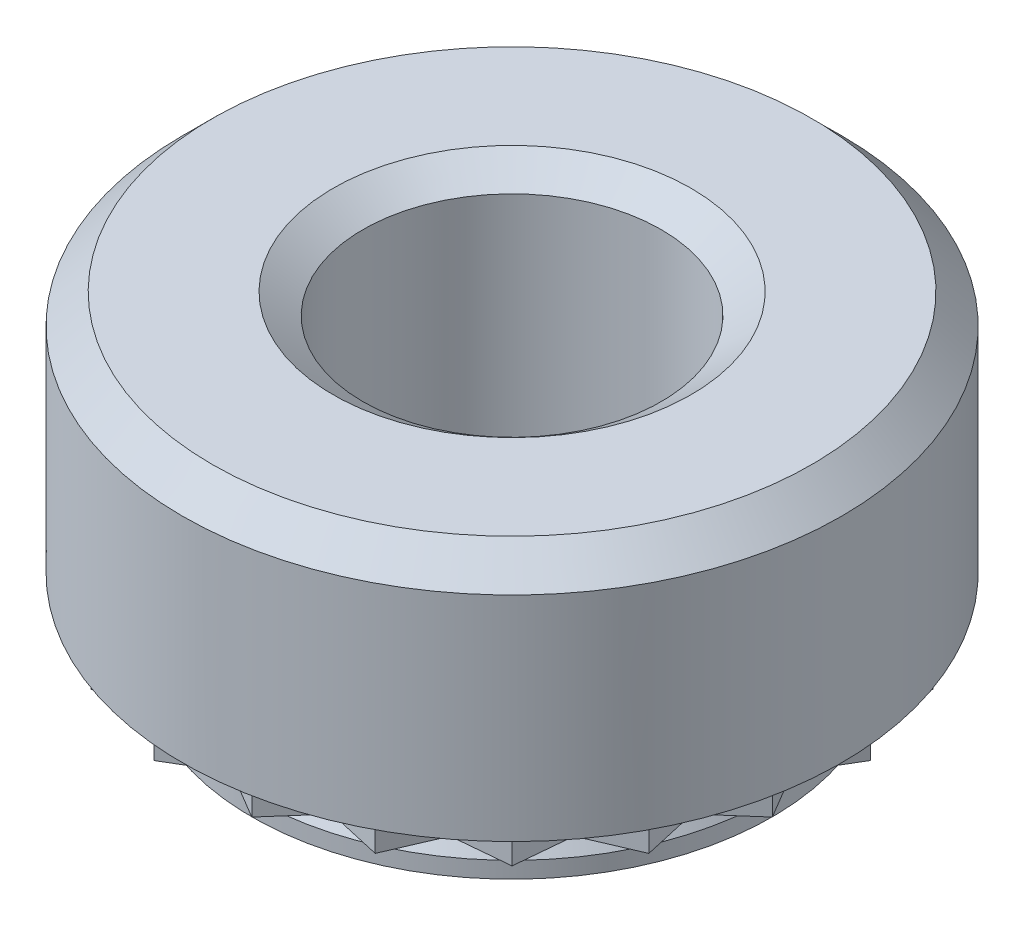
ISO-10303-21;
HEADER;
FILE_DESCRIPTION(('STEP AP214'),'2;1');
FILE_NAME('part.step','',(''),(''),'','','');
FILE_SCHEMA(('AUTOMOTIVE_DESIGN { 1 0 10303 214 1 1 1 1 }'));
ENDSEC;
DATA;
#1=APPLICATION_CONTEXT('core data for automotive mechanical design processes');
#2=APPLICATION_PROTOCOL_DEFINITION('international standard','automotive_design',2000,#1);
#3=PRODUCT_CONTEXT('',#1,'mechanical');
#4=PRODUCT('Part','Part','',(#3));
#5=PRODUCT_RELATED_PRODUCT_CATEGORY('part','',(#4));
#6=PRODUCT_DEFINITION_FORMATION('','',#4);
#7=PRODUCT_DEFINITION_CONTEXT('part definition',#1,'design');
#8=PRODUCT_DEFINITION('design','',#6,#7);
#9=PRODUCT_DEFINITION_SHAPE('','',#8);
#10=(LENGTH_UNIT() NAMED_UNIT(*) SI_UNIT(.MILLI.,.METRE.));
#11=(NAMED_UNIT(*) PLANE_ANGLE_UNIT() SI_UNIT($,.RADIAN.));
#12=(NAMED_UNIT(*) SI_UNIT($,.STERADIAN.) SOLID_ANGLE_UNIT());
#13=UNCERTAINTY_MEASURE_WITH_UNIT(LENGTH_MEASURE(1.E-05),#10,'distance_accuracy_value','');
#14=(GEOMETRIC_REPRESENTATION_CONTEXT(3) GLOBAL_UNCERTAINTY_ASSIGNED_CONTEXT((#13)) GLOBAL_UNIT_ASSIGNED_CONTEXT((#10,
#11,#12)) REPRESENTATION_CONTEXT('',''));
#15=CARTESIAN_POINT('',(0.,0.,0.));
#16=DIRECTION('',(0.,0.,1.));
#17=DIRECTION('',(1.,0.,0.));
#18=AXIS2_PLACEMENT_3D('',#15,#16,#17);
#19=CARTESIAN_POINT('',(4.04361205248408,0.,0.));
#20=DIRECTION('',(0.,-1.,0.));
#21=DIRECTION('',(0.,0.,-1.));
#22=AXIS2_PLACEMENT_3D('',#19,#20,#21);
#23=PLANE('',#22);
#24=CARTESIAN_POINT('',(0.,0.,0.));
#25=DIRECTION('',(0.,-1.,0.));
#26=DIRECTION('',(0.,0.,-1.));
#27=AXIS2_PLACEMENT_3D('',#24,#25,#26);
#28=CIRCLE('',#27,5.525);
#29=CARTESIAN_POINT('',(0.,0.,-5.525));
#30=VERTEX_POINT('',#29);
#31=EDGE_CURVE('E172',#30,#30,#28,.T.);
#32=ORIENTED_EDGE('',*,*,#31,.T.);
#33=EDGE_LOOP('',(#32));
#34=FACE_BOUND('',#33,.T.);
#35=DIRECTION('',(-0.859689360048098,0.,-0.510817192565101));
#36=VECTOR('',#35,1.);
#37=CARTESIAN_POINT('',(0.821085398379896,0.,5.18412917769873));
#38=LINE('',#37,#36);
#39=CARTESIAN_POINT('',(0.821085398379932,0.,5.18412917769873));
#40=VERTEX_POINT('',#39);
#41=CARTESIAN_POINT('',(0.,0.,4.69625));
#42=VERTEX_POINT('',#41);
#43=EDGE_CURVE('E76',#40,#42,#38,.T.);
#44=ORIENTED_EDGE('',*,*,#43,.F.);
#45=DIRECTION('',(-0.659761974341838,0.,0.751474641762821));
#46=VECTOR('',#45,1.);
#47=CARTESIAN_POINT('',(1.45122105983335,0.,4.46639916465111));
#48=LINE('',#47,#46);
#49=CARTESIAN_POINT('',(1.45122105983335,0.,4.46639916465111));
#50=VERTEX_POINT('',#49);
#51=EDGE_CURVE('E1209',#50,#40,#48,.T.);
#52=ORIENTED_EDGE('',*,*,#51,.F.);
#53=DIRECTION('',(-0.975464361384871,0.,-0.220157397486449));
#54=VECTOR('',#53,1.);
#55=CARTESIAN_POINT('',(2.38288263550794,0.,4.6766704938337));
#56=LINE('',#55,#54);
#57=CARTESIAN_POINT('',(2.38288263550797,0.,4.67667049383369));
#58=VERTEX_POINT('',#57);
#59=EDGE_CURVE('E1211',#58,#50,#56,.T.);
#60=ORIENTED_EDGE('',*,*,#59,.F.);
#61=DIRECTION('',(-0.395252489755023,0.,0.918572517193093));
#62=VECTOR('',#61,1.);
#63=CARTESIAN_POINT('',(2.76038649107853,0.,3.79934605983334));
#64=LINE('',#63,#62);
#65=CARTESIAN_POINT('',(2.76038649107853,0.,3.79934605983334));
#66=VERTEX_POINT('',#65);
#67=EDGE_CURVE('E1236',#66,#58,#64,.T.);
#68=ORIENTED_EDGE('',*,*,#67,.F.);
#69=DIRECTION('',(-0.995754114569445,0.,0.0920529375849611));
#70=VECTOR('',#69,1.);
#71=CARTESIAN_POINT('',(3.71142671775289,0.,3.7114267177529));
#72=LINE('',#71,#70);
#73=CARTESIAN_POINT('',(3.71142671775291,0.,3.71142671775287));
#74=VERTEX_POINT('',#73);
#75=EDGE_CURVE('E1239',#74,#66,#72,.T.);
#76=ORIENTED_EDGE('',*,*,#75,.F.);
#77=DIRECTION('',(-0.0920529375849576,0.,0.995754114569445));
#78=VECTOR('',#77,1.);
#79=CARTESIAN_POINT('',(3.79934605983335,0.,2.76038649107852));
#80=LINE('',#79,#78);
#81=CARTESIAN_POINT('',(3.79934605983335,0.,2.76038649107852));
#82=VERTEX_POINT('',#81);
#83=EDGE_CURVE('E1270',#82,#74,#80,.T.);
#84=ORIENTED_EDGE('',*,*,#83,.F.);
#85=DIRECTION('',(-0.918572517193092,0.,0.395252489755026));
#86=VECTOR('',#85,1.);
#87=CARTESIAN_POINT('',(4.67667049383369,0.,2.38288263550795));
#88=LINE('',#87,#86);
#89=CARTESIAN_POINT('',(4.67667049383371,0.,2.38288263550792));
#90=VERTEX_POINT('',#89);
#91=EDGE_CURVE('E1273',#90,#82,#88,.T.);
#92=ORIENTED_EDGE('',*,*,#91,.F.);
#93=DIRECTION('',(0.220157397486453,0.,0.97546436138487));
#94=VECTOR('',#93,1.);
#95=CARTESIAN_POINT('',(4.46639916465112,0.,1.45122105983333));
#96=LINE('',#95,#94);
#97=CARTESIAN_POINT('',(4.46639916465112,0.,1.45122105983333));
#98=VERTEX_POINT('',#97);
#99=EDGE_CURVE('E1306',#98,#90,#96,.T.);
#100=ORIENTED_EDGE('',*,*,#99,.F.);
#101=DIRECTION('',(-0.751474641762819,0.,0.65976197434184));
#102=VECTOR('',#101,1.);
#103=CARTESIAN_POINT('',(5.18412917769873,0.,0.821085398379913));
#104=LINE('',#103,#102);
#105=CARTESIAN_POINT('',(5.18412917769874,0.,0.821085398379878));
#106=VERTEX_POINT('',#105);
#107=EDGE_CURVE('E1309',#106,#98,#104,.T.);
#108=ORIENTED_EDGE('',*,*,#107,.F.);
#109=DIRECTION('',(0.510817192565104,0.,0.859689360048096));
#110=VECTOR('',#109,1.);
#111=CARTESIAN_POINT('',(4.69625,0.,0.));
#112=LINE('',#111,#110);
#113=CARTESIAN_POINT('',(4.69625,0.,0.));
#114=VERTEX_POINT('',#113);
#115=EDGE_CURVE('E1342',#114,#106,#112,.T.);
#116=ORIENTED_EDGE('',*,*,#115,.F.);
#117=DIRECTION('',(-0.510817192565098,0.,0.8596893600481));
#118=VECTOR('',#117,1.);
#119=CARTESIAN_POINT('',(5.18412917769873,0.,-0.821085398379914));
#120=LINE('',#119,#118);
#121=CARTESIAN_POINT('',(5.18412917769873,0.,-0.82108539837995));
#122=VERTEX_POINT('',#121);
#123=EDGE_CURVE('E1345',#122,#114,#120,.T.);
#124=ORIENTED_EDGE('',*,*,#123,.F.);
#125=DIRECTION('',(0.751474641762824,0.,0.659761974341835));
#126=VECTOR('',#125,1.);
#127=CARTESIAN_POINT('',(4.46639916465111,0.,-1.45122105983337));
#128=LINE('',#127,#126);
#129=CARTESIAN_POINT('',(4.46639916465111,0.,-1.45122105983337));
#130=VERTEX_POINT('',#129);
#131=EDGE_CURVE('E1378',#130,#122,#128,.T.);
#132=ORIENTED_EDGE('',*,*,#131,.F.);
#133=DIRECTION('',(-0.220157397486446,0.,0.975464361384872));
#134=VECTOR('',#133,1.);
#135=CARTESIAN_POINT('',(4.67667049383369,0.,-2.38288263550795));
#136=LINE('',#135,#134);
#137=CARTESIAN_POINT('',(4.67667049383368,0.,-2.38288263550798));
#138=VERTEX_POINT('',#137);
#139=EDGE_CURVE('E1381',#138,#130,#136,.T.);
#140=ORIENTED_EDGE('',*,*,#139,.F.);
#141=DIRECTION('',(0.918572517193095,0.,0.39525248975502));
#142=VECTOR('',#141,1.);
#143=CARTESIAN_POINT('',(3.79934605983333,0.,-2.76038649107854));
#144=LINE('',#143,#142);
#145=CARTESIAN_POINT('',(3.79934605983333,0.,-2.76038649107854));
#146=VERTEX_POINT('',#145);
#147=EDGE_CURVE('E1414',#146,#138,#144,.T.);
#148=ORIENTED_EDGE('',*,*,#147,.F.);
#149=DIRECTION('',(0.0920529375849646,0.,0.995754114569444));
#150=VECTOR('',#149,1.);
#151=CARTESIAN_POINT('',(3.71142671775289,0.,-3.7114267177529));
#152=LINE('',#151,#150);
#153=CARTESIAN_POINT('',(3.71142671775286,0.,-3.71142671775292));
#154=VERTEX_POINT('',#153);
#155=EDGE_CURVE('E1417',#154,#146,#152,.T.);
#156=ORIENTED_EDGE('',*,*,#155,.F.);
#157=DIRECTION('',(0.995754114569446,0.,0.0920529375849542));
#158=VECTOR('',#157,1.);
#159=CARTESIAN_POINT('',(2.76038649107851,0.,-3.79934605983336));
#160=LINE('',#159,#158);
#161=CARTESIAN_POINT('',(2.76038649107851,0.,-3.79934605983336));
#162=VERTEX_POINT('',#161);
#163=EDGE_CURVE('E1450',#162,#154,#160,.T.);
#164=ORIENTED_EDGE('',*,*,#163,.F.);
#165=DIRECTION('',(0.395252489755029,0.,0.918572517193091));
#166=VECTOR('',#165,1.);
#167=CARTESIAN_POINT('',(2.38288263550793,0.,-4.6766704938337));
#168=LINE('',#167,#166);
#169=CARTESIAN_POINT('',(2.3828826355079,0.,-4.67667049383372));
#170=VERTEX_POINT('',#169);
#171=EDGE_CURVE('E1453',#170,#162,#168,.T.);
#172=ORIENTED_EDGE('',*,*,#171,.F.);
#173=DIRECTION('',(0.975464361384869,0.,-0.220157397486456));
#174=VECTOR('',#173,1.);
#175=CARTESIAN_POINT('',(1.45122105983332,0.,-4.46639916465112));
#176=LINE('',#175,#174);
#177=CARTESIAN_POINT('',(1.45122105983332,0.,-4.46639916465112));
#178=VERTEX_POINT('',#177);
#179=EDGE_CURVE('E1486',#178,#170,#176,.T.);
#180=ORIENTED_EDGE('',*,*,#179,.F.);
#181=DIRECTION('',(0.659761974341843,0.,0.751474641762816));
#182=VECTOR('',#181,1.);
#183=CARTESIAN_POINT('',(0.821085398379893,0.,-5.18412917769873));
#184=LINE('',#183,#182);
#185=CARTESIAN_POINT('',(0.82108539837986,0.,-5.18412917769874));
#186=VERTEX_POINT('',#185);
#187=EDGE_CURVE('E1489',#186,#178,#184,.T.);
#188=ORIENTED_EDGE('',*,*,#187,.F.);
#189=DIRECTION('',(0.859689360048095,0.,-0.510817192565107));
#190=VECTOR('',#189,1.);
#191=CARTESIAN_POINT('',(0.,0.,-4.69625));
#192=LINE('',#191,#190);
#193=CARTESIAN_POINT('',(0.,0.,-4.69625));
#194=VERTEX_POINT('',#193);
#195=EDGE_CURVE('E1522',#194,#186,#192,.T.);
#196=ORIENTED_EDGE('',*,*,#195,.F.);
#197=DIRECTION('',(0.859689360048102,0.,0.510817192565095));
#198=VECTOR('',#197,1.);
#199=CARTESIAN_POINT('',(-0.821085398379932,0.,-5.18412917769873));
#200=LINE('',#199,#198);
#201=CARTESIAN_POINT('',(-0.821085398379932,0.,-5.18412917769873));
#202=VERTEX_POINT('',#201);
#203=EDGE_CURVE('E1525',#202,#194,#200,.T.);
#204=ORIENTED_EDGE('',*,*,#203,.F.);
#205=DIRECTION('',(0.659761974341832,0.,-0.751474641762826));
#206=VECTOR('',#205,1.);
#207=CARTESIAN_POINT('',(-1.45122105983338,0.,-4.4663991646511));
#208=LINE('',#207,#206);
#209=CARTESIAN_POINT('',(-1.45122105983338,0.,-4.4663991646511));
#210=VERTEX_POINT('',#209);
#211=EDGE_CURVE('E1558',#210,#202,#208,.T.);
#212=ORIENTED_EDGE('',*,*,#211,.F.);
#213=DIRECTION('',(0.975464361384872,0.,0.220157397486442));
#214=VECTOR('',#213,1.);
#215=CARTESIAN_POINT('',(-2.38288263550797,0.,-4.67667049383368));
#216=LINE('',#215,#214);
#217=CARTESIAN_POINT('',(-2.38288263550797,0.,-4.67667049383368));
#218=VERTEX_POINT('',#217);
#219=EDGE_CURVE('E1561',#218,#210,#216,.T.);
#220=ORIENTED_EDGE('',*,*,#219,.F.);
#221=DIRECTION('',(0.395252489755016,0.,-0.918572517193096));
#222=VECTOR('',#221,1.);
#223=CARTESIAN_POINT('',(-2.76038649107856,0.,-3.79934605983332));
#224=LINE('',#223,#222);
#225=CARTESIAN_POINT('',(-2.76038649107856,0.,-3.79934605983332));
#226=VERTEX_POINT('',#225);
#227=EDGE_CURVE('E1594',#226,#218,#224,.T.);
#228=ORIENTED_EDGE('',*,*,#227,.F.);
#229=DIRECTION('',(0.995754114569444,0.,-0.0920529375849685));
#230=VECTOR('',#229,1.);
#231=CARTESIAN_POINT('',(-3.71142671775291,0.,-3.71142671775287));
#232=LINE('',#231,#230);
#233=CARTESIAN_POINT('',(-3.71142671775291,0.,-3.71142671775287));
#234=VERTEX_POINT('',#233);
#235=EDGE_CURVE('E1597',#234,#226,#232,.T.);
#236=ORIENTED_EDGE('',*,*,#235,.F.);
#237=DIRECTION('',(0.0920529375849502,0.,-0.995754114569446));
#238=VECTOR('',#237,1.);
#239=CARTESIAN_POINT('',(-3.79934605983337,0.,-2.76038649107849));
#240=LINE('',#239,#238);
#241=CARTESIAN_POINT('',(-3.79934605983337,0.,-2.76038649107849));
#242=VERTEX_POINT('',#241);
#243=EDGE_CURVE('E1630',#242,#234,#240,.T.);
#244=ORIENTED_EDGE('',*,*,#243,.F.);
#245=DIRECTION('',(0.918572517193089,0.,-0.395252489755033));
#246=VECTOR('',#245,1.);
#247=CARTESIAN_POINT('',(-4.67667049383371,0.,-2.38288263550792));
#248=LINE('',#247,#246);
#249=CARTESIAN_POINT('',(-4.67667049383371,0.,-2.38288263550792));
#250=VERTEX_POINT('',#249);
#251=EDGE_CURVE('E1633',#250,#242,#248,.T.);
#252=ORIENTED_EDGE('',*,*,#251,.F.);
#253=DIRECTION('',(-0.220157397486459,0.,-0.975464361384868));
#254=VECTOR('',#253,1.);
#255=CARTESIAN_POINT('',(-4.46639916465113,0.,-1.4512210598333));
#256=LINE('',#255,#254);
#257=CARTESIAN_POINT('',(-4.46639916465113,0.,-1.4512210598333));
#258=VERTEX_POINT('',#257);
#259=EDGE_CURVE('E1666',#258,#250,#256,.T.);
#260=ORIENTED_EDGE('',*,*,#259,.F.);
#261=DIRECTION('',(0.751474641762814,0.,-0.659761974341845));
#262=VECTOR('',#261,1.);
#263=CARTESIAN_POINT('',(-5.18412917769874,0.,-0.821085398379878));
#264=LINE('',#263,#262);
#265=CARTESIAN_POINT('',(-5.18412917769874,0.,-0.821085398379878));
#266=VERTEX_POINT('',#265);
#267=EDGE_CURVE('E1669',#266,#258,#264,.T.);
#268=ORIENTED_EDGE('',*,*,#267,.F.);
#269=DIRECTION('',(-0.51081719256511,0.,-0.859689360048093));
#270=VECTOR('',#269,1.);
#271=CARTESIAN_POINT('',(-4.69625,0.,0.));
#272=LINE('',#271,#270);
#273=CARTESIAN_POINT('',(-4.69625,0.,0.));
#274=VERTEX_POINT('',#273);
#275=EDGE_CURVE('E1702',#274,#266,#272,.T.);
#276=ORIENTED_EDGE('',*,*,#275,.F.);
#277=DIRECTION('',(0.510817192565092,0.,-0.859689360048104));
#278=VECTOR('',#277,1.);
#279=CARTESIAN_POINT('',(-5.18412917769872,0.,0.821085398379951));
#280=LINE('',#279,#278);
#281=CARTESIAN_POINT('',(-5.18412917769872,0.,0.821085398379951));
#282=VERTEX_POINT('',#281);
#283=EDGE_CURVE('E1705',#282,#274,#280,.T.);
#284=ORIENTED_EDGE('',*,*,#283,.F.);
#285=DIRECTION('',(-0.751474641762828,0.,-0.65976197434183));
#286=VECTOR('',#285,1.);
#287=CARTESIAN_POINT('',(-4.4663991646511,0.,1.4512210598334));
#288=LINE('',#287,#286);
#289=CARTESIAN_POINT('',(-4.4663991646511,0.,1.4512210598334));
#290=VERTEX_POINT('',#289);
#291=EDGE_CURVE('E1738',#290,#282,#288,.T.);
#292=ORIENTED_EDGE('',*,*,#291,.F.);
#293=DIRECTION('',(0.220157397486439,0.,-0.975464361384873));
#294=VECTOR('',#293,1.);
#295=CARTESIAN_POINT('',(-4.67667049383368,0.,2.38288263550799));
#296=LINE('',#295,#294);
#297=CARTESIAN_POINT('',(-4.67667049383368,0.,2.38288263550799));
#298=VERTEX_POINT('',#297);
#299=EDGE_CURVE('E1741',#298,#290,#296,.T.);
#300=ORIENTED_EDGE('',*,*,#299,.F.);
#301=DIRECTION('',(-0.918572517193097,0.,-0.395252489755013));
#302=VECTOR('',#301,1.);
#303=CARTESIAN_POINT('',(-3.79934605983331,0.,2.76038649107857));
#304=LINE('',#303,#302);
#305=CARTESIAN_POINT('',(-3.79934605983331,0.,2.76038649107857));
#306=VERTEX_POINT('',#305);
#307=EDGE_CURVE('E1774',#306,#298,#304,.T.);
#308=ORIENTED_EDGE('',*,*,#307,.F.);
#309=DIRECTION('',(-0.0920529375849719,0.,-0.995754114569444));
#310=VECTOR('',#309,1.);
#311=CARTESIAN_POINT('',(-3.71142671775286,0.,3.71142671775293));
#312=LINE('',#311,#310);
#313=CARTESIAN_POINT('',(-3.71142671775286,0.,3.71142671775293));
#314=VERTEX_POINT('',#313);
#315=EDGE_CURVE('E1777',#314,#306,#312,.T.);
#316=ORIENTED_EDGE('',*,*,#315,.F.);
#317=DIRECTION('',(-0.995754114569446,0.,-0.0920529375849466));
#318=VECTOR('',#317,1.);
#319=CARTESIAN_POINT('',(-2.76038649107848,0.,3.79934605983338));
#320=LINE('',#319,#318);
#321=CARTESIAN_POINT('',(-2.76038649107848,0.,3.79934605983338));
#322=VERTEX_POINT('',#321);
#323=EDGE_CURVE('E1810',#322,#314,#320,.T.);
#324=ORIENTED_EDGE('',*,*,#323,.F.);
#325=DIRECTION('',(-0.395252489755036,0.,-0.918572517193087));
#326=VECTOR('',#325,1.);
#327=CARTESIAN_POINT('',(-2.3828826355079,0.,4.67667049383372));
#328=LINE('',#327,#326);
#329=CARTESIAN_POINT('',(-2.3828826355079,0.,4.67667049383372));
#330=VERTEX_POINT('',#329);
#331=EDGE_CURVE('E1813',#330,#322,#328,.T.);
#332=ORIENTED_EDGE('',*,*,#331,.F.);
#333=DIRECTION('',(-0.975464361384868,0.,0.220157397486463));
#334=VECTOR('',#333,1.);
#335=CARTESIAN_POINT('',(-1.45122105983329,0.,4.46639916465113));
#336=LINE('',#335,#334);
#337=CARTESIAN_POINT('',(-1.45122105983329,0.,4.46639916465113));
#338=VERTEX_POINT('',#337);
#339=EDGE_CURVE('E1833',#338,#330,#336,.T.);
#340=ORIENTED_EDGE('',*,*,#339,.F.);
#341=DIRECTION('',(-0.659761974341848,0.,-0.751474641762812));
#342=VECTOR('',#341,1.);
#343=CARTESIAN_POINT('',(-0.82108539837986,0.,5.18412917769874));
#344=LINE('',#343,#342);
#345=CARTESIAN_POINT('',(-0.82108539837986,0.,5.18412917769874));
#346=VERTEX_POINT('',#345);
#347=EDGE_CURVE('E1836',#346,#338,#344,.T.);
#348=ORIENTED_EDGE('',*,*,#347,.F.);
#349=DIRECTION('',(-0.859689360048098,0.,0.510817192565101));
#350=VECTOR('',#349,1.);
#351=CARTESIAN_POINT('',(0.,0.,4.69625));
#352=LINE('',#351,#350);
#353=EDGE_CURVE('E1187',#42,#346,#352,.T.);
#354=ORIENTED_EDGE('',*,*,#353,.F.);
#355=EDGE_LOOP('',(#44,#52,#60,#68,#76,#84,#92,#100,#108,#116,#124,#132,#140,#148,#156,#164,
#172,#180,#188,#196,#204,#212,#220,#228,#236,#244,#252,#260,#268,#276,#284,#292,#300,#308,#316,
#324,#332,#340,#348,#354));
#356=FACE_BOUND('',#355,.T.);
#357=ADVANCED_FACE('F39',(#34,#356),#23,.T.);
#358=CARTESIAN_POINT('',(0.,0.,0.));
#359=DIRECTION('',(0.,-1.,0.));
#360=DIRECTION('',(0.,0.,-1.));
#361=AXIS2_PLACEMENT_3D('',#358,#359,#360);
#362=CIRCLE('',#361,4.04361205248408);
#363=CARTESIAN_POINT('',(0.,0.,-4.04361205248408));
#364=VERTEX_POINT('',#363);
#365=EDGE_CURVE('E175',#364,#364,#362,.T.);
#366=ORIENTED_EDGE('',*,*,#365,.F.);
#367=EDGE_LOOP('',(#366));
#368=FACE_BOUND('',#367,.T.);
#369=DIRECTION('',(0.975464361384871,0.,0.220157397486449));
#370=VECTOR('',#369,1.);
#371=CARTESIAN_POINT('',(1.39317221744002,0.,4.28774319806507));
#372=LINE('',#371,#370);
#373=CARTESIAN_POINT('',(1.39317221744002,0.,4.28774319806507));
#374=VERTEX_POINT('',#373);
#375=CARTESIAN_POINT('',(2.28756733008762,0.,4.48960367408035));
#376=VERTEX_POINT('',#375);
#377=EDGE_CURVE('E110',#374,#376,#372,.T.);
#378=ORIENTED_EDGE('',*,*,#377,.F.);
#379=DIRECTION('',(0.659761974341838,0.,-0.751474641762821));
#380=VECTOR('',#379,1.);
#381=CARTESIAN_POINT('',(0.788241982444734,0.,4.97676401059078));
#382=LINE('',#381,#380);
#383=CARTESIAN_POINT('',(0.788241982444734,0.,4.97676401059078));
#384=VERTEX_POINT('',#383);
#385=EDGE_CURVE('E1207',#384,#374,#382,.T.);
#386=ORIENTED_EDGE('',*,*,#385,.F.);
#387=DIRECTION('',(0.859689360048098,0.,0.510817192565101));
#388=VECTOR('',#387,1.);
#389=CARTESIAN_POINT('',(0.,0.,4.5084));
#390=LINE('',#389,#388);
#391=CARTESIAN_POINT('',(0.,0.,4.5084));
#392=VERTEX_POINT('',#391);
#393=EDGE_CURVE('E144',#392,#384,#390,.T.);
#394=ORIENTED_EDGE('',*,*,#393,.F.);
#395=DIRECTION('',(0.859689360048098,0.,-0.510817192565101));
#396=VECTOR('',#395,1.);
#397=CARTESIAN_POINT('',(-0.7882419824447,0.,4.97676401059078));
#398=LINE('',#397,#396);
#399=CARTESIAN_POINT('',(-0.788241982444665,0.,4.97676401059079));
#400=VERTEX_POINT('',#399);
#401=EDGE_CURVE('E1186',#400,#392,#398,.T.);
#402=ORIENTED_EDGE('',*,*,#401,.F.);
#403=DIRECTION('',(0.659761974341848,0.,0.751474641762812));
#404=VECTOR('',#403,1.);
#405=CARTESIAN_POINT('',(-1.39317221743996,0.,4.28774319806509));
#406=LINE('',#405,#404);
#407=CARTESIAN_POINT('',(-1.39317221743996,0.,4.28774319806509));
#408=VERTEX_POINT('',#407);
#409=EDGE_CURVE('E1173',#408,#400,#406,.T.);
#410=ORIENTED_EDGE('',*,*,#409,.F.);
#411=DIRECTION('',(0.975464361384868,0.,-0.220157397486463));
#412=VECTOR('',#411,1.);
#413=CARTESIAN_POINT('',(-2.28756733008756,0.,4.48960367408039));
#414=LINE('',#413,#412);
#415=CARTESIAN_POINT('',(-2.28756733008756,0.,4.48960367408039));
#416=VERTEX_POINT('',#415);
#417=EDGE_CURVE('E1184',#416,#408,#414,.T.);
#418=ORIENTED_EDGE('',*,*,#417,.F.);
#419=DIRECTION('',(0.395252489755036,0.,0.918572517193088));
#420=VECTOR('',#419,1.);
#421=CARTESIAN_POINT('',(-2.64997103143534,0.,3.64737221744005));
#422=LINE('',#421,#420);
#423=CARTESIAN_POINT('',(-2.64997103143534,0.,3.64737221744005));
#424=VERTEX_POINT('',#423);
#425=EDGE_CURVE('E1803',#424,#416,#422,.T.);
#426=ORIENTED_EDGE('',*,*,#425,.F.);
#427=DIRECTION('',(0.995754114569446,0.,0.0920529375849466));
#428=VECTOR('',#427,1.);
#429=CARTESIAN_POINT('',(-3.56296964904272,0.,3.56296964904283));
#430=LINE('',#429,#428);
#431=CARTESIAN_POINT('',(-3.56296964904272,0.,3.56296964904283));
#432=VERTEX_POINT('',#431);
#433=EDGE_CURVE('E1807',#432,#424,#430,.T.);
#434=ORIENTED_EDGE('',*,*,#433,.F.);
#435=DIRECTION('',(0.0920529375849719,0.,0.995754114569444));
#436=VECTOR('',#435,1.);
#437=CARTESIAN_POINT('',(-3.64737221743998,0.,2.64997103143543));
#438=LINE('',#437,#436);
#439=CARTESIAN_POINT('',(-3.64737221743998,0.,2.64997103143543));
#440=VERTEX_POINT('',#439);
#441=EDGE_CURVE('E1767',#440,#432,#438,.T.);
#442=ORIENTED_EDGE('',*,*,#441,.F.);
#443=DIRECTION('',(0.918572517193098,0.,0.395252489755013));
#444=VECTOR('',#443,1.);
#445=CARTESIAN_POINT('',(-4.48960367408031,0.,2.2875673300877));
#446=LINE('',#445,#444);
#447=CARTESIAN_POINT('',(-4.48960367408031,0.,2.2875673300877));
#448=VERTEX_POINT('',#447);
#449=EDGE_CURVE('E1771',#448,#440,#446,.T.);
#450=ORIENTED_EDGE('',*,*,#449,.F.);
#451=DIRECTION('',(-0.220157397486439,0.,0.975464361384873));
#452=VECTOR('',#451,1.);
#453=CARTESIAN_POINT('',(-4.28774319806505,0.,1.39317221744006));
#454=LINE('',#453,#452);
#455=CARTESIAN_POINT('',(-4.28774319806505,0.,1.39317221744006));
#456=VERTEX_POINT('',#455);
#457=EDGE_CURVE('E1731',#456,#448,#454,.T.);
#458=ORIENTED_EDGE('',*,*,#457,.F.);
#459=DIRECTION('',(0.751474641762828,0.,0.65976197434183));
#460=VECTOR('',#459,1.);
#461=CARTESIAN_POINT('',(-4.97676401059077,0.,0.788241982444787));
#462=LINE('',#461,#460);
#463=CARTESIAN_POINT('',(-4.97676401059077,0.,0.788241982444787));
#464=VERTEX_POINT('',#463);
#465=EDGE_CURVE('E1735',#464,#456,#462,.T.);
#466=ORIENTED_EDGE('',*,*,#465,.F.);
#467=DIRECTION('',(-0.510817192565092,0.,0.859689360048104));
#468=VECTOR('',#467,1.);
#469=CARTESIAN_POINT('',(-4.5084,0.,0.));
#470=LINE('',#469,#468);
#471=CARTESIAN_POINT('',(-4.5084,0.,0.));
#472=VERTEX_POINT('',#471);
#473=EDGE_CURVE('E1695',#472,#464,#470,.T.);
#474=ORIENTED_EDGE('',*,*,#473,.F.);
#475=DIRECTION('',(0.51081719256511,0.,0.859689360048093));
#476=VECTOR('',#475,1.);
#477=CARTESIAN_POINT('',(-4.97676401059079,0.,-0.788241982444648));
#478=LINE('',#477,#476);
#479=CARTESIAN_POINT('',(-4.97676401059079,0.,-0.788241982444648));
#480=VERTEX_POINT('',#479);
#481=EDGE_CURVE('E1699',#480,#472,#478,.T.);
#482=ORIENTED_EDGE('',*,*,#481,.F.);
#483=DIRECTION('',(-0.751474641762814,0.,0.659761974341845));
#484=VECTOR('',#483,1.);
#485=CARTESIAN_POINT('',(-4.28774319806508,0.,-1.39317221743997));
#486=LINE('',#485,#484);
#487=CARTESIAN_POINT('',(-4.28774319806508,0.,-1.39317221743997));
#488=VERTEX_POINT('',#487);
#489=EDGE_CURVE('E1659',#488,#480,#486,.T.);
#490=ORIENTED_EDGE('',*,*,#489,.F.);
#491=DIRECTION('',(0.220157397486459,0.,0.975464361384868));
#492=VECTOR('',#491,1.);
#493=CARTESIAN_POINT('',(-4.48960367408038,0.,-2.28756733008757));
#494=LINE('',#493,#492);
#495=CARTESIAN_POINT('',(-4.48960367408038,0.,-2.28756733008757));
#496=VERTEX_POINT('',#495);
#497=EDGE_CURVE('E1663',#496,#488,#494,.T.);
#498=ORIENTED_EDGE('',*,*,#497,.F.);
#499=DIRECTION('',(-0.918572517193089,0.,0.395252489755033));
#500=VECTOR('',#499,1.);
#501=CARTESIAN_POINT('',(-3.64737221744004,0.,-2.64997103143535));
#502=LINE('',#501,#500);
#503=CARTESIAN_POINT('',(-3.64737221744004,0.,-2.64997103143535));
#504=VERTEX_POINT('',#503);
#505=EDGE_CURVE('E1623',#504,#496,#502,.T.);
#506=ORIENTED_EDGE('',*,*,#505,.F.);
#507=DIRECTION('',(-0.0920529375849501,0.,0.995754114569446));
#508=VECTOR('',#507,1.);
#509=CARTESIAN_POINT('',(-3.56296964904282,0.,-3.56296964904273));
#510=LINE('',#509,#508);
#511=CARTESIAN_POINT('',(-3.56296964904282,0.,-3.56296964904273));
#512=VERTEX_POINT('',#511);
#513=EDGE_CURVE('E1627',#512,#504,#510,.T.);
#514=ORIENTED_EDGE('',*,*,#513,.F.);
#515=DIRECTION('',(-0.995754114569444,0.,0.0920529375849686));
#516=VECTOR('',#515,1.);
#517=CARTESIAN_POINT('',(-2.64997103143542,0.,-3.64737221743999));
#518=LINE('',#517,#516);
#519=CARTESIAN_POINT('',(-2.64997103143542,0.,-3.64737221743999));
#520=VERTEX_POINT('',#519);
#521=EDGE_CURVE('E1587',#520,#512,#518,.T.);
#522=ORIENTED_EDGE('',*,*,#521,.F.);
#523=DIRECTION('',(-0.395252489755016,0.,0.918572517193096));
#524=VECTOR('',#523,1.);
#525=CARTESIAN_POINT('',(-2.28756733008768,0.,-4.48960367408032));
#526=LINE('',#525,#524);
#527=CARTESIAN_POINT('',(-2.28756733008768,0.,-4.48960367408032));
#528=VERTEX_POINT('',#527);
#529=EDGE_CURVE('E1591',#528,#520,#526,.T.);
#530=ORIENTED_EDGE('',*,*,#529,.F.);
#531=DIRECTION('',(-0.975464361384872,0.,-0.220157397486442));
#532=VECTOR('',#531,1.);
#533=CARTESIAN_POINT('',(-1.39317221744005,0.,-4.28774319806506));
#534=LINE('',#533,#532);
#535=CARTESIAN_POINT('',(-1.39317221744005,0.,-4.28774319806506));
#536=VERTEX_POINT('',#535);
#537=EDGE_CURVE('E1551',#536,#528,#534,.T.);
#538=ORIENTED_EDGE('',*,*,#537,.F.);
#539=DIRECTION('',(-0.659761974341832,0.,0.751474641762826));
#540=VECTOR('',#539,1.);
#541=CARTESIAN_POINT('',(-0.78824198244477,0.,-4.97676401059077));
#542=LINE('',#541,#540);
#543=CARTESIAN_POINT('',(-0.78824198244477,0.,-4.97676401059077));
#544=VERTEX_POINT('',#543);
#545=EDGE_CURVE('E1555',#544,#536,#542,.T.);
#546=ORIENTED_EDGE('',*,*,#545,.F.);
#547=DIRECTION('',(-0.859689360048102,0.,-0.510817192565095));
#548=VECTOR('',#547,1.);
#549=CARTESIAN_POINT('',(0.,0.,-4.5084));
#550=LINE('',#549,#548);
#551=CARTESIAN_POINT('',(0.,0.,-4.5084));
#552=VERTEX_POINT('',#551);
#553=EDGE_CURVE('E1515',#552,#544,#550,.T.);
#554=ORIENTED_EDGE('',*,*,#553,.F.);
#555=DIRECTION('',(-0.859689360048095,0.,0.510817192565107));
#556=VECTOR('',#555,1.);
#557=CARTESIAN_POINT('',(0.788241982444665,0.,-4.97676401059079));
#558=LINE('',#557,#556);
#559=CARTESIAN_POINT('',(0.788241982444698,0.,-4.97676401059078));
#560=VERTEX_POINT('',#559);
#561=EDGE_CURVE('E1519',#560,#552,#558,.T.);
#562=ORIENTED_EDGE('',*,*,#561,.F.);
#563=DIRECTION('',(-0.659761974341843,0.,-0.751474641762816));
#564=VECTOR('',#563,1.);
#565=CARTESIAN_POINT('',(1.39317221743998,0.,-4.28774319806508));
#566=LINE('',#565,#564);
#567=CARTESIAN_POINT('',(1.39317221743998,0.,-4.28774319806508));
#568=VERTEX_POINT('',#567);
#569=EDGE_CURVE('E1479',#568,#560,#566,.T.);
#570=ORIENTED_EDGE('',*,*,#569,.F.);
#571=DIRECTION('',(-0.975464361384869,0.,0.220157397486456));
#572=VECTOR('',#571,1.);
#573=CARTESIAN_POINT('',(2.28756733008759,0.,-4.48960367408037));
#574=LINE('',#573,#572);
#575=CARTESIAN_POINT('',(2.28756733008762,0.,-4.48960367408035));
#576=VERTEX_POINT('',#575);
#577=EDGE_CURVE('E1483',#576,#568,#574,.T.);
#578=ORIENTED_EDGE('',*,*,#577,.F.);
#579=DIRECTION('',(-0.395252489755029,0.,-0.918572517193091));
#580=VECTOR('',#579,1.);
#581=CARTESIAN_POINT('',(2.64997103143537,0.,-3.64737221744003));
#582=LINE('',#581,#580);
#583=CARTESIAN_POINT('',(2.64997103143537,0.,-3.64737221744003));
#584=VERTEX_POINT('',#583);
#585=EDGE_CURVE('E1443',#584,#576,#582,.T.);
#586=ORIENTED_EDGE('',*,*,#585,.F.);
#587=DIRECTION('',(-0.995754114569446,0.,-0.0920529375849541));
#588=VECTOR('',#587,1.);
#589=CARTESIAN_POINT('',(3.56296964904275,0.,-3.56296964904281));
#590=LINE('',#589,#588);
#591=CARTESIAN_POINT('',(3.56296964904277,0.,-3.56296964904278));
#592=VERTEX_POINT('',#591);
#593=EDGE_CURVE('E1447',#592,#584,#590,.T.);
#594=ORIENTED_EDGE('',*,*,#593,.F.);
#595=DIRECTION('',(-0.0920529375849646,0.,-0.995754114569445));
#596=VECTOR('',#595,1.);
#597=CARTESIAN_POINT('',(3.64737221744,0.,-2.6499710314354));
#598=LINE('',#597,#596);
#599=CARTESIAN_POINT('',(3.64737221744,0.,-2.6499710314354));
#600=VERTEX_POINT('',#599);
#601=EDGE_CURVE('E1407',#600,#592,#598,.T.);
#602=ORIENTED_EDGE('',*,*,#601,.F.);
#603=DIRECTION('',(-0.918572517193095,0.,-0.39525248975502));
#604=VECTOR('',#603,1.);
#605=CARTESIAN_POINT('',(4.48960367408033,0.,-2.28756733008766));
#606=LINE('',#605,#604);
#607=CARTESIAN_POINT('',(4.48960367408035,0.,-2.28756733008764));
#608=VERTEX_POINT('',#607);
#609=EDGE_CURVE('E1411',#608,#600,#606,.T.);
#610=ORIENTED_EDGE('',*,*,#609,.F.);
#611=DIRECTION('',(0.220157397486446,0.,-0.975464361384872));
#612=VECTOR('',#611,1.);
#613=CARTESIAN_POINT('',(4.28774319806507,0.,-1.39317221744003));
#614=LINE('',#613,#612);
#615=CARTESIAN_POINT('',(4.28774319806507,0.,-1.39317221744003));
#616=VERTEX_POINT('',#615);
#617=EDGE_CURVE('E1371',#616,#608,#614,.T.);
#618=ORIENTED_EDGE('',*,*,#617,.F.);
#619=DIRECTION('',(-0.751474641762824,0.,-0.659761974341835));
#620=VECTOR('',#619,1.);
#621=CARTESIAN_POINT('',(4.97676401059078,0.,-0.788241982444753));
#622=LINE('',#621,#620);
#623=CARTESIAN_POINT('',(4.97676401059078,0.,-0.788241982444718));
#624=VERTEX_POINT('',#623);
#625=EDGE_CURVE('E1375',#624,#616,#622,.T.);
#626=ORIENTED_EDGE('',*,*,#625,.F.);
#627=DIRECTION('',(0.510817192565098,0.,-0.8596893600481));
#628=VECTOR('',#627,1.);
#629=CARTESIAN_POINT('',(4.5084,0.,0.));
#630=LINE('',#629,#628);
#631=CARTESIAN_POINT('',(4.5084,0.,0.));
#632=VERTEX_POINT('',#631);
#633=EDGE_CURVE('E1335',#632,#624,#630,.T.);
#634=ORIENTED_EDGE('',*,*,#633,.F.);
#635=DIRECTION('',(-0.510817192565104,0.,-0.859689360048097));
#636=VECTOR('',#635,1.);
#637=CARTESIAN_POINT('',(4.97676401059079,0.,0.788241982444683));
#638=LINE('',#637,#636);
#639=CARTESIAN_POINT('',(4.97676401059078,0.,0.788241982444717));
#640=VERTEX_POINT('',#639);
#641=EDGE_CURVE('E1339',#640,#632,#638,.T.);
#642=ORIENTED_EDGE('',*,*,#641,.F.);
#643=DIRECTION('',(0.751474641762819,0.,-0.659761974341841));
#644=VECTOR('',#643,1.);
#645=CARTESIAN_POINT('',(4.28774319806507,0.,1.39317221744));
#646=LINE('',#645,#644);
#647=CARTESIAN_POINT('',(4.28774319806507,0.,1.39317221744));
#648=VERTEX_POINT('',#647);
#649=EDGE_CURVE('E1299',#648,#640,#646,.T.);
#650=ORIENTED_EDGE('',*,*,#649,.F.);
#651=DIRECTION('',(-0.220157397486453,0.,-0.97546436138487));
#652=VECTOR('',#651,1.);
#653=CARTESIAN_POINT('',(4.48960367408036,0.,2.2875673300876));
#654=LINE('',#653,#652);
#655=CARTESIAN_POINT('',(4.48960367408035,0.,2.28756733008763));
#656=VERTEX_POINT('',#655);
#657=EDGE_CURVE('E1303',#656,#648,#654,.T.);
#658=ORIENTED_EDGE('',*,*,#657,.F.);
#659=DIRECTION('',(0.918572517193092,0.,-0.395252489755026));
#660=VECTOR('',#659,1.);
#661=CARTESIAN_POINT('',(3.64737221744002,0.,2.64997103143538));
#662=LINE('',#661,#660);
#663=CARTESIAN_POINT('',(3.64737221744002,0.,2.64997103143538));
#664=VERTEX_POINT('',#663);
#665=EDGE_CURVE('E1263',#664,#656,#662,.T.);
#666=ORIENTED_EDGE('',*,*,#665,.F.);
#667=DIRECTION('',(0.0920529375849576,0.,-0.995754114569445));
#668=VECTOR('',#667,1.);
#669=CARTESIAN_POINT('',(3.56296964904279,0.,3.56296964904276));
#670=LINE('',#669,#668);
#671=CARTESIAN_POINT('',(3.56296964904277,0.,3.56296964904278));
#672=VERTEX_POINT('',#671);
#673=EDGE_CURVE('E1267',#672,#664,#670,.T.);
#674=ORIENTED_EDGE('',*,*,#673,.F.);
#675=DIRECTION('',(0.995754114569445,0.,-0.0920529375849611));
#676=VECTOR('',#675,1.);
#677=CARTESIAN_POINT('',(2.64997103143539,0.,3.64737221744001));
#678=LINE('',#677,#676);
#679=CARTESIAN_POINT('',(2.64997103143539,0.,3.64737221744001));
#680=VERTEX_POINT('',#679);
#681=EDGE_CURVE('E1229',#680,#672,#678,.T.);
#682=ORIENTED_EDGE('',*,*,#681,.F.);
#683=DIRECTION('',(0.395252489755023,0.,-0.918572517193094));
#684=VECTOR('',#683,1.);
#685=CARTESIAN_POINT('',(2.28756733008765,0.,4.48960367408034));
#686=LINE('',#685,#684);
#687=EDGE_CURVE('E1233',#376,#680,#686,.T.);
#688=ORIENTED_EDGE('',*,*,#687,.F.);
#689=EDGE_LOOP('',(#378,#386,#394,#402,#410,#418,#426,#434,#442,#450,#458,#466,#474,#482,#490,
#498,#506,#514,#522,#530,#538,#546,#554,#562,#570,#578,#586,#594,#602,#610,#618,#626,#634,#642,
#650,#658,#666,#674,#682,#688));
#690=FACE_BOUND('',#689,.T.);
#691=ADVANCED_FACE('F211',(#368,#690),#23,.T.);
#692=CARTESIAN_POINT('',(0.,0.,0.));
#693=DIRECTION('',(0.,-1.,0.));
#694=DIRECTION('',(0.,0.,-1.));
#695=AXIS2_PLACEMENT_3D('',#692,#693,#694);
#696=CYLINDRICAL_SURFACE('',#695,5.525);
#697=CARTESIAN_POINT('',(0.,3.58,0.));
#698=DIRECTION('',(0.,1.,0.));
#699=DIRECTION('',(0.,0.,1.));
#700=AXIS2_PLACEMENT_3D('',#697,#698,#699);
#701=CIRCLE('',#700,5.525);
#702=CARTESIAN_POINT('',(0.,3.58,5.525));
#703=VERTEX_POINT('',#702);
#704=EDGE_CURVE('E48',#703,#703,#701,.F.);
#705=ORIENTED_EDGE('',*,*,#704,.T.);
#706=EDGE_LOOP('',(#705));
#707=FACE_BOUND('',#706,.T.);
#708=ORIENTED_EDGE('',*,*,#31,.F.);
#709=EDGE_LOOP('',(#708));
#710=FACE_BOUND('',#709,.T.);
#711=ADVANCED_FACE('F190',(#707,#710),#696,.T.);
#712=CARTESIAN_POINT('',(5.525,4.08,0.));
#713=DIRECTION('',(0.,1.,0.));
#714=DIRECTION('',(0.,0.,1.));
#715=AXIS2_PLACEMENT_3D('',#712,#713,#714);
#716=PLANE('',#715);
#717=CARTESIAN_POINT('',(0.,4.08,0.));
#718=DIRECTION('',(0.,-1.,0.));
#719=DIRECTION('',(0.,0.,-1.));
#720=AXIS2_PLACEMENT_3D('',#717,#718,#719);
#721=CIRCLE('',#720,3.);
#722=CARTESIAN_POINT('',(0.,4.08,-3.));
#723=VERTEX_POINT('',#722);
#724=EDGE_CURVE('E163',#723,#723,#721,.T.);
#725=ORIENTED_EDGE('',*,*,#724,.T.);
#726=EDGE_LOOP('',(#725));
#727=FACE_BOUND('',#726,.T.);
#728=CARTESIAN_POINT('',(0.,4.08,0.));
#729=DIRECTION('',(0.,1.,0.));
#730=DIRECTION('',(0.,0.,1.));
#731=AXIS2_PLACEMENT_3D('',#728,#729,#730);
#732=CIRCLE('',#731,5.025);
#733=CARTESIAN_POINT('',(0.,4.08,5.025));
#734=VERTEX_POINT('',#733);
#735=EDGE_CURVE('E11',#734,#734,#732,.T.);
#736=ORIENTED_EDGE('',*,*,#735,.T.);
#737=EDGE_LOOP('',(#736));
#738=FACE_BOUND('',#737,.T.);
#739=ADVANCED_FACE('F236',(#727,#738),#716,.T.);
#740=CARTESIAN_POINT('',(0.,0.,0.));
#741=DIRECTION('',(0.,-1.,0.));
#742=DIRECTION('',(0.,0.,-1.));
#743=AXIS2_PLACEMENT_3D('',#740,#741,#742);
#744=CYLINDRICAL_SURFACE('',#743,2.5);
#745=CARTESIAN_POINT('',(0.,3.73002626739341,0.));
#746=DIRECTION('',(0.,-1.,0.));
#747=DIRECTION('',(0.,0.,-1.));
#748=AXIS2_PLACEMENT_3D('',#745,#746,#747);
#749=CIRCLE('',#748,2.5);
#750=CARTESIAN_POINT('',(0.,3.73002626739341,-2.5));
#751=VERTEX_POINT('',#750);
#752=EDGE_CURVE('E160',#751,#751,#749,.T.);
#753=ORIENTED_EDGE('',*,*,#752,.F.);
#754=EDGE_LOOP('',(#753));
#755=FACE_BOUND('',#754,.T.);
#756=CARTESIAN_POINT('',(0.,-1.01748626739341,0.));
#757=DIRECTION('',(0.,-1.,0.));
#758=DIRECTION('',(0.,0.,-1.));
#759=AXIS2_PLACEMENT_3D('',#756,#757,#758);
#760=CIRCLE('',#759,2.5);
#761=CARTESIAN_POINT('',(0.,-1.01748626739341,-2.5));
#762=VERTEX_POINT('',#761);
#763=EDGE_CURVE('E169',#762,#762,#760,.T.);
#764=ORIENTED_EDGE('',*,*,#763,.T.);
#765=EDGE_LOOP('',(#764));
#766=FACE_BOUND('',#765,.T.);
#767=ADVANCED_FACE('F232',(#755,#766),#744,.F.);
#768=CARTESIAN_POINT('',(2.5,-1.37,0.));
#769=DIRECTION('',(0.,-1.,0.));
#770=DIRECTION('',(0.,0.,-1.));
#771=AXIS2_PLACEMENT_3D('',#768,#769,#770);
#772=PLANE('',#771);
#773=CARTESIAN_POINT('',(0.,-1.37,0.));
#774=DIRECTION('',(0.,-1.,0.));
#775=DIRECTION('',(0.,0.,-1.));
#776=AXIS2_PLACEMENT_3D('',#773,#774,#775);
#777=CIRCLE('',#776,3.);
#778=CARTESIAN_POINT('',(0.,-1.37,-3.));
#779=VERTEX_POINT('',#778);
#780=EDGE_CURVE('E43',#779,#779,#777,.T.);
#781=ORIENTED_EDGE('',*,*,#780,.F.);
#782=EDGE_LOOP('',(#781));
#783=FACE_BOUND('',#782,.T.);
#784=CARTESIAN_POINT('',(0.,-1.37,0.));
#785=DIRECTION('',(0.,-1.,0.));
#786=DIRECTION('',(0.,0.,-1.));
#787=AXIS2_PLACEMENT_3D('',#784,#785,#786);
#788=CIRCLE('',#787,4.36);
#789=CARTESIAN_POINT('',(0.,-1.37,-4.36));
#790=VERTEX_POINT('',#789);
#791=EDGE_CURVE('E184',#790,#790,#788,.T.);
#792=ORIENTED_EDGE('',*,*,#791,.T.);
#793=EDGE_LOOP('',(#792));
#794=FACE_BOUND('',#793,.T.);
#795=ADVANCED_FACE('F228',(#783,#794),#772,.T.);
#796=CARTESIAN_POINT('',(0.,0.,0.));
#797=DIRECTION('',(0.,-1.,0.));
#798=DIRECTION('',(0.,0.,-1.));
#799=AXIS2_PLACEMENT_3D('',#796,#797,#798);
#800=CYLINDRICAL_SURFACE('',#799,4.36);
#801=CARTESIAN_POINT('',(0.,-1.096,0.));
#802=DIRECTION('',(0.,-1.,0.));
#803=DIRECTION('',(0.,0.,-1.));
#804=AXIS2_PLACEMENT_3D('',#801,#802,#803);
#805=CIRCLE('',#804,4.36);
#806=CARTESIAN_POINT('',(0.,-1.096,-4.36));
#807=VERTEX_POINT('',#806);
#808=EDGE_CURVE('E181',#807,#807,#805,.T.);
#809=ORIENTED_EDGE('',*,*,#808,.T.);
#810=EDGE_LOOP('',(#809));
#811=FACE_BOUND('',#810,.T.);
#812=ORIENTED_EDGE('',*,*,#791,.F.);
#813=EDGE_LOOP('',(#812));
#814=FACE_BOUND('',#813,.T.);
#815=ADVANCED_FACE('F224',(#811,#814),#800,.T.);
#816=CARTESIAN_POINT('',(0.,-1.096,0.));
#817=DIRECTION('',(0.,-1.,0.));
#818=DIRECTION('',(0.,0.,-1.));
#819=AXIS2_PLACEMENT_3D('',#816,#817,#818);
#820=CONICAL_SURFACE('',#819,4.36,0.523598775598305);
#821=CARTESIAN_POINT('',(0.,-0.548,0.));
#822=DIRECTION('',(0.,-1.,0.));
#823=DIRECTION('',(0.,0.,-1.));
#824=AXIS2_PLACEMENT_3D('',#821,#822,#823);
#825=CIRCLE('',#824,4.04361205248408);
#826=CARTESIAN_POINT('',(0.,-0.548,-4.04361205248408));
#827=VERTEX_POINT('',#826);
#828=EDGE_CURVE('E178',#827,#827,#825,.T.);
#829=ORIENTED_EDGE('',*,*,#828,.T.);
#830=EDGE_LOOP('',(#829));
#831=FACE_BOUND('',#830,.T.);
#832=ORIENTED_EDGE('',*,*,#808,.F.);
#833=EDGE_LOOP('',(#832));
#834=FACE_BOUND('',#833,.T.);
#835=ADVANCED_FACE('F206',(#831,#834),#820,.T.);
#836=CARTESIAN_POINT('',(0.,0.,0.));
#837=DIRECTION('',(0.,-1.,0.));
#838=DIRECTION('',(0.,0.,-1.));
#839=AXIS2_PLACEMENT_3D('',#836,#837,#838);
#840=CYLINDRICAL_SURFACE('',#839,4.04361205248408);
#841=ORIENTED_EDGE('',*,*,#365,.T.);
#842=EDGE_LOOP('',(#841));
#843=FACE_BOUND('',#842,.T.);
#844=ORIENTED_EDGE('',*,*,#828,.F.);
#845=EDGE_LOOP('',(#844));
#846=FACE_BOUND('',#845,.T.);
#847=ADVANCED_FACE('F195',(#843,#846),#840,.T.);
#848=CARTESIAN_POINT('',(0.,3.58,0.));
#849=DIRECTION('',(0.,-1.,0.));
#850=DIRECTION('',(0.,0.,-1.));
#851=AXIS2_PLACEMENT_3D('',#848,#849,#850);
#852=CONICAL_SURFACE('',#851,5.525,0.78539816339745);
#853=ORIENTED_EDGE('',*,*,#735,.F.);
#854=EDGE_LOOP('',(#853));
#855=FACE_BOUND('',#854,.T.);
#856=ORIENTED_EDGE('',*,*,#704,.F.);
#857=EDGE_LOOP('',(#856));
#858=FACE_BOUND('',#857,.T.);
#859=ADVANCED_FACE('F41',(#855,#858),#852,.T.);
#860=CARTESIAN_POINT('',(0.,-1.36746,0.));
#861=DIRECTION('',(0.,-1.,0.));
#862=DIRECTION('',(0.,0.,-1.));
#863=AXIS2_PLACEMENT_3D('',#860,#861,#862);
#864=CONICAL_SURFACE('',#863,3.,0.960105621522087);
#865=ORIENTED_EDGE('',*,*,#763,.F.);
#866=EDGE_LOOP('',(#865));
#867=FACE_BOUND('',#866,.T.);
#868=CARTESIAN_POINT('',(0.,-1.36746,0.));
#869=DIRECTION('',(0.,-1.,0.));
#870=DIRECTION('',(0.,0.,-1.));
#871=AXIS2_PLACEMENT_3D('',#868,#869,#870);
#872=CIRCLE('',#871,3.);
#873=CARTESIAN_POINT('',(0.,-1.36746,-3.));
#874=VERTEX_POINT('',#873);
#875=EDGE_CURVE('E166',#874,#874,#872,.T.);
#876=ORIENTED_EDGE('',*,*,#875,.T.);
#877=EDGE_LOOP('',(#876));
#878=FACE_BOUND('',#877,.T.);
#879=ADVANCED_FACE('F194',(#867,#878),#864,.F.);
#880=CARTESIAN_POINT('',(0.,-2.54,0.));
#881=DIRECTION('',(0.,-1.,0.));
#882=DIRECTION('',(0.,0.,-1.));
#883=AXIS2_PLACEMENT_3D('',#880,#881,#882);
#884=CYLINDRICAL_SURFACE('',#883,3.);
#885=ORIENTED_EDGE('',*,*,#780,.T.);
#886=EDGE_LOOP('',(#885));
#887=FACE_BOUND('',#886,.T.);
#888=ORIENTED_EDGE('',*,*,#875,.F.);
#889=EDGE_LOOP('',(#888));
#890=FACE_BOUND('',#889,.T.);
#891=ADVANCED_FACE('F202',(#887,#890),#884,.F.);
#892=CARTESIAN_POINT('',(0.,3.73002626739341,0.));
#893=DIRECTION('',(0.,1.,0.));
#894=DIRECTION('',(0.,0.,1.));
#895=AXIS2_PLACEMENT_3D('',#892,#893,#894);
#896=CONICAL_SURFACE('',#895,2.5,0.960105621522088);
#897=ORIENTED_EDGE('',*,*,#724,.F.);
#898=EDGE_LOOP('',(#897));
#899=FACE_BOUND('',#898,.T.);
#900=ORIENTED_EDGE('',*,*,#752,.T.);
#901=EDGE_LOOP('',(#900));
#902=FACE_BOUND('',#901,.T.);
#903=ADVANCED_FACE('F287',(#899,#902),#896,.F.);
#904=CARTESIAN_POINT('',(0.821085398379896,-0.548,5.18412917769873));
#905=DIRECTION('',(0.510817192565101,0.,-0.859689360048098));
#906=DIRECTION('',(-0.859689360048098,0.,-0.510817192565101));
#907=AXIS2_PLACEMENT_3D('',#904,#905,#906);
#908=PLANE('',#907);
#909=ORIENTED_EDGE('',*,*,#43,.T.);
#910=DIRECTION('',(0.,1.,0.));
#911=VECTOR('',#910,1.);
#912=CARTESIAN_POINT('',(0.,-0.548,4.69625));
#913=LINE('',#912,#911);
#914=CARTESIAN_POINT('',(0.,-0.548,4.69625));
#915=VERTEX_POINT('',#914);
#916=EDGE_CURVE('E156',#915,#42,#913,.T.);
#917=ORIENTED_EDGE('',*,*,#916,.F.);
#918=DIRECTION('',(-0.859689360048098,0.,-0.510817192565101));
#919=VECTOR('',#918,1.);
#920=CARTESIAN_POINT('',(0.821085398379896,-0.548,5.18412917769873));
#921=LINE('',#920,#919);
#922=CARTESIAN_POINT('',(0.821085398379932,-0.548,5.18412917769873));
#923=VERTEX_POINT('',#922);
#924=EDGE_CURVE('E1188',#923,#915,#921,.T.);
#925=ORIENTED_EDGE('',*,*,#924,.F.);
#926=DIRECTION('',(0.,1.,0.));
#927=VECTOR('',#926,1.);
#928=CARTESIAN_POINT('',(0.821085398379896,-0.548,5.18412917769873));
#929=LINE('',#928,#927);
#930=EDGE_CURVE('E158',#923,#40,#929,.T.);
#931=ORIENTED_EDGE('',*,*,#930,.T.);
#932=EDGE_LOOP('',(#909,#917,#925,#931));
#933=FACE_BOUND('',#932,.T.);
#934=ADVANCED_FACE('F294',(#933),#908,.F.);
#935=CARTESIAN_POINT('',(0.,-0.548,4.69625));
#936=DIRECTION('',(-0.510817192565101,0.,-0.859689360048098));
#937=DIRECTION('',(-0.859689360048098,0.,0.510817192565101));
#938=AXIS2_PLACEMENT_3D('',#935,#936,#937);
#939=PLANE('',#938);
#940=ORIENTED_EDGE('',*,*,#353,.T.);
#941=DIRECTION('',(0.,1.,0.));
#942=VECTOR('',#941,1.);
#943=CARTESIAN_POINT('',(-0.821085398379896,-0.548,5.18412917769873));
#944=LINE('',#943,#942);
#945=CARTESIAN_POINT('',(-0.82108539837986,-0.548,5.18412917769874));
#946=VERTEX_POINT('',#945);
#947=EDGE_CURVE('E153',#946,#346,#944,.T.);
#948=ORIENTED_EDGE('',*,*,#947,.F.);
#949=DIRECTION('',(-0.859689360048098,0.,0.510817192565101));
#950=VECTOR('',#949,1.);
#951=CARTESIAN_POINT('',(0.,-0.548,4.69625));
#952=LINE('',#951,#950);
#953=EDGE_CURVE('E1195',#915,#946,#952,.T.);
#954=ORIENTED_EDGE('',*,*,#953,.F.);
#955=ORIENTED_EDGE('',*,*,#916,.T.);
#956=EDGE_LOOP('',(#940,#948,#954,#955));
#957=FACE_BOUND('',#956,.T.);
#958=ADVANCED_FACE('F307',(#957),#939,.F.);
#959=CARTESIAN_POINT('',(-0.7882419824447,-0.548,4.97676401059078));
#960=DIRECTION('',(0.510817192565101,0.,0.859689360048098));
#961=DIRECTION('',(0.859689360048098,0.,-0.510817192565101));
#962=AXIS2_PLACEMENT_3D('',#959,#960,#961);
#963=PLANE('',#962);
#964=ORIENTED_EDGE('',*,*,#401,.T.);
#965=DIRECTION('',(0.,1.,0.));
#966=VECTOR('',#965,1.);
#967=CARTESIAN_POINT('',(0.,-0.548,4.5084));
#968=LINE('',#967,#966);
#969=CARTESIAN_POINT('',(0.,-0.548,4.5084));
#970=VERTEX_POINT('',#969);
#971=EDGE_CURVE('E55',#970,#392,#968,.T.);
#972=ORIENTED_EDGE('',*,*,#971,.F.);
#973=DIRECTION('',(0.859689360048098,0.,-0.510817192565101));
#974=VECTOR('',#973,1.);
#975=CARTESIAN_POINT('',(-0.7882419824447,-0.548,4.97676401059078));
#976=LINE('',#975,#974);
#977=CARTESIAN_POINT('',(-0.7882419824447,-0.548,4.97676401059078));
#978=VERTEX_POINT('',#977);
#979=EDGE_CURVE('E64',#978,#970,#976,.T.);
#980=ORIENTED_EDGE('',*,*,#979,.F.);
#981=DIRECTION('',(0.,1.,0.));
#982=VECTOR('',#981,1.);
#983=CARTESIAN_POINT('',(-0.7882419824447,-0.548,4.97676401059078));
#984=LINE('',#983,#982);
#985=EDGE_CURVE('E146',#978,#400,#984,.T.);
#986=ORIENTED_EDGE('',*,*,#985,.T.);
#987=EDGE_LOOP('',(#964,#972,#980,#986));
#988=FACE_BOUND('',#987,.T.);
#989=ADVANCED_FACE('F316',(#988),#963,.F.);
#990=CARTESIAN_POINT('',(0.,-0.548,4.5084));
#991=DIRECTION('',(-0.510817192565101,0.,0.859689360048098));
#992=DIRECTION('',(0.859689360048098,0.,0.510817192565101));
#993=AXIS2_PLACEMENT_3D('',#990,#991,#992);
#994=PLANE('',#993);
#995=ORIENTED_EDGE('',*,*,#393,.T.);
#996=DIRECTION('',(0.,1.,0.));
#997=VECTOR('',#996,1.);
#998=CARTESIAN_POINT('',(0.7882419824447,-0.548,4.97676401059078));
#999=LINE('',#998,#997);
#1000=CARTESIAN_POINT('',(0.788241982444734,-0.548,4.97676401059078));
#1001=VERTEX_POINT('',#1000);
#1002=EDGE_CURVE('E134',#1001,#384,#999,.T.);
#1003=ORIENTED_EDGE('',*,*,#1002,.F.);
#1004=DIRECTION('',(0.859689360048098,0.,0.510817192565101));
#1005=VECTOR('',#1004,1.);
#1006=CARTESIAN_POINT('',(0.,-0.548,4.5084));
#1007=LINE('',#1006,#1005);
#1008=EDGE_CURVE('E139',#970,#1001,#1007,.T.);
#1009=ORIENTED_EDGE('',*,*,#1008,.F.);
#1010=ORIENTED_EDGE('',*,*,#971,.T.);
#1011=EDGE_LOOP('',(#995,#1003,#1009,#1010));
#1012=FACE_BOUND('',#1011,.T.);
#1013=ADVANCED_FACE('F142',(#1012),#994,.F.);
#1014=CARTESIAN_POINT('',(0.679833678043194,-0.548,4.29230091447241));
#1015=DIRECTION('',(0.,-1.,0.));
#1016=DIRECTION('',(0.,0.,-1.));
#1017=AXIS2_PLACEMENT_3D('',#1014,#1015,#1016);
#1018=PLANE('',#1017);
#1019=DIRECTION('',(-0.659761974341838,0.,0.751474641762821));
#1020=VECTOR('',#1019,1.);
#1021=CARTESIAN_POINT('',(1.45122105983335,-0.548,4.46639916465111));
#1022=LINE('',#1021,#1020);
#1023=CARTESIAN_POINT('',(1.45122105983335,-0.548,4.46639916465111));
#1024=VERTEX_POINT('',#1023);
#1025=EDGE_CURVE('E137',#1024,#923,#1022,.T.);
#1026=ORIENTED_EDGE('',*,*,#1025,.T.);
#1027=ORIENTED_EDGE('',*,*,#924,.T.);
#1028=ORIENTED_EDGE('',*,*,#953,.T.);
#1029=DIRECTION('',(-0.659761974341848,0.,-0.751474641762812));
#1030=VECTOR('',#1029,1.);
#1031=CARTESIAN_POINT('',(-0.82108539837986,-0.548,5.18412917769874));
#1032=LINE('',#1031,#1030);
#1033=CARTESIAN_POINT('',(-1.45122105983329,-0.548,4.46639916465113));
#1034=VERTEX_POINT('',#1033);
#1035=EDGE_CURVE('E1183',#946,#1034,#1032,.T.);
#1036=ORIENTED_EDGE('',*,*,#1035,.T.);
#1037=DIRECTION('',(-0.975464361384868,0.,0.220157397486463));
#1038=VECTOR('',#1037,1.);
#1039=CARTESIAN_POINT('',(-1.45122105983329,-0.548,4.46639916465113));
#1040=LINE('',#1039,#1038);
#1041=CARTESIAN_POINT('',(-2.3828826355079,-0.548,4.67667049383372));
#1042=VERTEX_POINT('',#1041);
#1043=EDGE_CURVE('E1843',#1034,#1042,#1040,.T.);
#1044=ORIENTED_EDGE('',*,*,#1043,.T.);
#1045=DIRECTION('',(-0.395252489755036,0.,-0.918572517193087));
#1046=VECTOR('',#1045,1.);
#1047=CARTESIAN_POINT('',(-2.3828826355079,-0.548,4.67667049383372));
#1048=LINE('',#1047,#1046);
#1049=CARTESIAN_POINT('',(-2.76038649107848,-0.548,3.79934605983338));
#1050=VERTEX_POINT('',#1049);
#1051=EDGE_CURVE('E1806',#1042,#1050,#1048,.T.);
#1052=ORIENTED_EDGE('',*,*,#1051,.T.);
#1053=DIRECTION('',(-0.995754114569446,0.,-0.0920529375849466));
#1054=VECTOR('',#1053,1.);
#1055=CARTESIAN_POINT('',(-2.76038649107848,-0.548,3.79934605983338));
#1056=LINE('',#1055,#1054);
#1057=CARTESIAN_POINT('',(-3.71142671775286,-0.548,3.71142671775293));
#1058=VERTEX_POINT('',#1057);
#1059=EDGE_CURVE('E1822',#1050,#1058,#1056,.T.);
#1060=ORIENTED_EDGE('',*,*,#1059,.T.);
#1061=DIRECTION('',(-0.0920529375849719,0.,-0.995754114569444));
#1062=VECTOR('',#1061,1.);
#1063=CARTESIAN_POINT('',(-3.71142671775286,-0.548,3.71142671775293));
#1064=LINE('',#1063,#1062);
#1065=CARTESIAN_POINT('',(-3.79934605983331,-0.548,2.76038649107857));
#1066=VERTEX_POINT('',#1065);
#1067=EDGE_CURVE('E1770',#1058,#1066,#1064,.T.);
#1068=ORIENTED_EDGE('',*,*,#1067,.T.);
#1069=DIRECTION('',(-0.918572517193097,0.,-0.395252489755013));
#1070=VECTOR('',#1069,1.);
#1071=CARTESIAN_POINT('',(-3.79934605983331,-0.548,2.76038649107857));
#1072=LINE('',#1071,#1070);
#1073=CARTESIAN_POINT('',(-4.67667049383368,-0.548,2.38288263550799));
#1074=VERTEX_POINT('',#1073);
#1075=EDGE_CURVE('E1786',#1066,#1074,#1072,.T.);
#1076=ORIENTED_EDGE('',*,*,#1075,.T.);
#1077=DIRECTION('',(0.220157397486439,0.,-0.975464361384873));
#1078=VECTOR('',#1077,1.);
#1079=CARTESIAN_POINT('',(-4.67667049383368,-0.548,2.38288263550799));
#1080=LINE('',#1079,#1078);
#1081=CARTESIAN_POINT('',(-4.4663991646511,-0.548,1.4512210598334));
#1082=VERTEX_POINT('',#1081);
#1083=EDGE_CURVE('E1734',#1074,#1082,#1080,.T.);
#1084=ORIENTED_EDGE('',*,*,#1083,.T.);
#1085=DIRECTION('',(-0.751474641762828,0.,-0.65976197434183));
#1086=VECTOR('',#1085,1.);
#1087=CARTESIAN_POINT('',(-4.4663991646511,-0.548,1.4512210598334));
#1088=LINE('',#1087,#1086);
#1089=CARTESIAN_POINT('',(-5.18412917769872,-0.548,0.821085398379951));
#1090=VERTEX_POINT('',#1089);
#1091=EDGE_CURVE('E1750',#1082,#1090,#1088,.T.);
#1092=ORIENTED_EDGE('',*,*,#1091,.T.);
#1093=DIRECTION('',(0.510817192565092,0.,-0.859689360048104));
#1094=VECTOR('',#1093,1.);
#1095=CARTESIAN_POINT('',(-5.18412917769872,-0.548,0.821085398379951));
#1096=LINE('',#1095,#1094);
#1097=CARTESIAN_POINT('',(-4.69625,-0.548,0.));
#1098=VERTEX_POINT('',#1097);
#1099=EDGE_CURVE('E1698',#1090,#1098,#1096,.T.);
#1100=ORIENTED_EDGE('',*,*,#1099,.T.);
#1101=DIRECTION('',(-0.51081719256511,0.,-0.859689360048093));
#1102=VECTOR('',#1101,1.);
#1103=CARTESIAN_POINT('',(-4.69625,-0.548,0.));
#1104=LINE('',#1103,#1102);
#1105=CARTESIAN_POINT('',(-5.18412917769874,-0.548,-0.821085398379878));
#1106=VERTEX_POINT('',#1105);
#1107=EDGE_CURVE('E1714',#1098,#1106,#1104,.T.);
#1108=ORIENTED_EDGE('',*,*,#1107,.T.);
#1109=DIRECTION('',(0.751474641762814,0.,-0.659761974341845));
#1110=VECTOR('',#1109,1.);
#1111=CARTESIAN_POINT('',(-5.18412917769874,-0.548,-0.821085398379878));
#1112=LINE('',#1111,#1110);
#1113=CARTESIAN_POINT('',(-4.46639916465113,-0.548,-1.4512210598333));
#1114=VERTEX_POINT('',#1113);
#1115=EDGE_CURVE('E1662',#1106,#1114,#1112,.T.);
#1116=ORIENTED_EDGE('',*,*,#1115,.T.);
#1117=DIRECTION('',(-0.220157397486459,0.,-0.975464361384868));
#1118=VECTOR('',#1117,1.);
#1119=CARTESIAN_POINT('',(-4.46639916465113,-0.548,-1.4512210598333));
#1120=LINE('',#1119,#1118);
#1121=CARTESIAN_POINT('',(-4.67667049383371,-0.548,-2.38288263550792));
#1122=VERTEX_POINT('',#1121);
#1123=EDGE_CURVE('E1678',#1114,#1122,#1120,.T.);
#1124=ORIENTED_EDGE('',*,*,#1123,.T.);
#1125=DIRECTION('',(0.918572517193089,0.,-0.395252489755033));
#1126=VECTOR('',#1125,1.);
#1127=CARTESIAN_POINT('',(-4.67667049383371,-0.548,-2.38288263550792));
#1128=LINE('',#1127,#1126);
#1129=CARTESIAN_POINT('',(-3.79934605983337,-0.548,-2.76038649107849));
#1130=VERTEX_POINT('',#1129);
#1131=EDGE_CURVE('E1626',#1122,#1130,#1128,.T.);
#1132=ORIENTED_EDGE('',*,*,#1131,.T.);
#1133=DIRECTION('',(0.0920529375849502,0.,-0.995754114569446));
#1134=VECTOR('',#1133,1.);
#1135=CARTESIAN_POINT('',(-3.79934605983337,-0.548,-2.76038649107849));
#1136=LINE('',#1135,#1134);
#1137=CARTESIAN_POINT('',(-3.71142671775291,-0.548,-3.71142671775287));
#1138=VERTEX_POINT('',#1137);
#1139=EDGE_CURVE('E1642',#1130,#1138,#1136,.T.);
#1140=ORIENTED_EDGE('',*,*,#1139,.T.);
#1141=DIRECTION('',(0.995754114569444,0.,-0.0920529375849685));
#1142=VECTOR('',#1141,1.);
#1143=CARTESIAN_POINT('',(-3.71142671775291,-0.548,-3.71142671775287));
#1144=LINE('',#1143,#1142);
#1145=CARTESIAN_POINT('',(-2.76038649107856,-0.548,-3.79934605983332));
#1146=VERTEX_POINT('',#1145);
#1147=EDGE_CURVE('E1590',#1138,#1146,#1144,.T.);
#1148=ORIENTED_EDGE('',*,*,#1147,.T.);
#1149=DIRECTION('',(0.395252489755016,0.,-0.918572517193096));
#1150=VECTOR('',#1149,1.);
#1151=CARTESIAN_POINT('',(-2.76038649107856,-0.548,-3.79934605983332));
#1152=LINE('',#1151,#1150);
#1153=CARTESIAN_POINT('',(-2.38288263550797,-0.548,-4.67667049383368));
#1154=VERTEX_POINT('',#1153);
#1155=EDGE_CURVE('E1606',#1146,#1154,#1152,.T.);
#1156=ORIENTED_EDGE('',*,*,#1155,.T.);
#1157=DIRECTION('',(0.975464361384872,0.,0.220157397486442));
#1158=VECTOR('',#1157,1.);
#1159=CARTESIAN_POINT('',(-2.38288263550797,-0.548,-4.67667049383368));
#1160=LINE('',#1159,#1158);
#1161=CARTESIAN_POINT('',(-1.45122105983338,-0.548,-4.4663991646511));
#1162=VERTEX_POINT('',#1161);
#1163=EDGE_CURVE('E1554',#1154,#1162,#1160,.T.);
#1164=ORIENTED_EDGE('',*,*,#1163,.T.);
#1165=DIRECTION('',(0.659761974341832,0.,-0.751474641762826));
#1166=VECTOR('',#1165,1.);
#1167=CARTESIAN_POINT('',(-1.45122105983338,-0.548,-4.4663991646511));
#1168=LINE('',#1167,#1166);
#1169=CARTESIAN_POINT('',(-0.821085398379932,-0.548,-5.18412917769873));
#1170=VERTEX_POINT('',#1169);
#1171=EDGE_CURVE('E1570',#1162,#1170,#1168,.T.);
#1172=ORIENTED_EDGE('',*,*,#1171,.T.);
#1173=DIRECTION('',(0.859689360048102,0.,0.510817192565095));
#1174=VECTOR('',#1173,1.);
#1175=CARTESIAN_POINT('',(-0.821085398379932,-0.548,-5.18412917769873));
#1176=LINE('',#1175,#1174);
#1177=CARTESIAN_POINT('',(0.,-0.548,-4.69625));
#1178=VERTEX_POINT('',#1177);
#1179=EDGE_CURVE('E1518',#1170,#1178,#1176,.T.);
#1180=ORIENTED_EDGE('',*,*,#1179,.T.);
#1181=DIRECTION('',(0.859689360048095,0.,-0.510817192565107));
#1182=VECTOR('',#1181,1.);
#1183=CARTESIAN_POINT('',(0.,-0.548,-4.69625));
#1184=LINE('',#1183,#1182);
#1185=CARTESIAN_POINT('',(0.821085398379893,-0.548,-5.18412917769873));
#1186=VERTEX_POINT('',#1185);
#1187=EDGE_CURVE('E1534',#1178,#1186,#1184,.T.);
#1188=ORIENTED_EDGE('',*,*,#1187,.T.);
#1189=DIRECTION('',(0.659761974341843,0.,0.751474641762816));
#1190=VECTOR('',#1189,1.);
#1191=CARTESIAN_POINT('',(0.821085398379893,-0.548,-5.18412917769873));
#1192=LINE('',#1191,#1190);
#1193=CARTESIAN_POINT('',(1.45122105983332,-0.548,-4.46639916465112));
#1194=VERTEX_POINT('',#1193);
#1195=EDGE_CURVE('E1482',#1186,#1194,#1192,.T.);
#1196=ORIENTED_EDGE('',*,*,#1195,.T.);
#1197=DIRECTION('',(0.975464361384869,0.,-0.220157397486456));
#1198=VECTOR('',#1197,1.);
#1199=CARTESIAN_POINT('',(1.45122105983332,-0.548,-4.46639916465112));
#1200=LINE('',#1199,#1198);
#1201=CARTESIAN_POINT('',(2.38288263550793,-0.548,-4.6766704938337));
#1202=VERTEX_POINT('',#1201);
#1203=EDGE_CURVE('E1498',#1194,#1202,#1200,.T.);
#1204=ORIENTED_EDGE('',*,*,#1203,.T.);
#1205=DIRECTION('',(0.395252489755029,0.,0.918572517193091));
#1206=VECTOR('',#1205,1.);
#1207=CARTESIAN_POINT('',(2.38288263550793,-0.548,-4.6766704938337));
#1208=LINE('',#1207,#1206);
#1209=CARTESIAN_POINT('',(2.76038649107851,-0.548,-3.79934605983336));
#1210=VERTEX_POINT('',#1209);
#1211=EDGE_CURVE('E1446',#1202,#1210,#1208,.T.);
#1212=ORIENTED_EDGE('',*,*,#1211,.T.);
#1213=DIRECTION('',(0.995754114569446,0.,0.0920529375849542));
#1214=VECTOR('',#1213,1.);
#1215=CARTESIAN_POINT('',(2.76038649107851,-0.548,-3.79934605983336));
#1216=LINE('',#1215,#1214);
#1217=CARTESIAN_POINT('',(3.71142671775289,-0.548,-3.7114267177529));
#1218=VERTEX_POINT('',#1217);
#1219=EDGE_CURVE('E1462',#1210,#1218,#1216,.T.);
#1220=ORIENTED_EDGE('',*,*,#1219,.T.);
#1221=DIRECTION('',(0.0920529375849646,0.,0.995754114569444));
#1222=VECTOR('',#1221,1.);
#1223=CARTESIAN_POINT('',(3.71142671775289,-0.548,-3.7114267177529));
#1224=LINE('',#1223,#1222);
#1225=CARTESIAN_POINT('',(3.79934605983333,-0.548,-2.76038649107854));
#1226=VERTEX_POINT('',#1225);
#1227=EDGE_CURVE('E1410',#1218,#1226,#1224,.T.);
#1228=ORIENTED_EDGE('',*,*,#1227,.T.);
#1229=DIRECTION('',(0.918572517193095,0.,0.39525248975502));
#1230=VECTOR('',#1229,1.);
#1231=CARTESIAN_POINT('',(3.79934605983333,-0.548,-2.76038649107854));
#1232=LINE('',#1231,#1230);
#1233=CARTESIAN_POINT('',(4.67667049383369,-0.548,-2.38288263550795));
#1234=VERTEX_POINT('',#1233);
#1235=EDGE_CURVE('E1426',#1226,#1234,#1232,.T.);
#1236=ORIENTED_EDGE('',*,*,#1235,.T.);
#1237=DIRECTION('',(-0.220157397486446,0.,0.975464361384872));
#1238=VECTOR('',#1237,1.);
#1239=CARTESIAN_POINT('',(4.67667049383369,-0.548,-2.38288263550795));
#1240=LINE('',#1239,#1238);
#1241=CARTESIAN_POINT('',(4.46639916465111,-0.548,-1.45122105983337));
#1242=VERTEX_POINT('',#1241);
#1243=EDGE_CURVE('E1374',#1234,#1242,#1240,.T.);
#1244=ORIENTED_EDGE('',*,*,#1243,.T.);
#1245=DIRECTION('',(0.751474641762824,0.,0.659761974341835));
#1246=VECTOR('',#1245,1.);
#1247=CARTESIAN_POINT('',(4.46639916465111,-0.548,-1.45122105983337));
#1248=LINE('',#1247,#1246);
#1249=CARTESIAN_POINT('',(5.18412917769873,-0.548,-0.821085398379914));
#1250=VERTEX_POINT('',#1249);
#1251=EDGE_CURVE('E1390',#1242,#1250,#1248,.T.);
#1252=ORIENTED_EDGE('',*,*,#1251,.T.);
#1253=DIRECTION('',(-0.510817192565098,0.,0.8596893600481));
#1254=VECTOR('',#1253,1.);
#1255=CARTESIAN_POINT('',(5.18412917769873,-0.548,-0.821085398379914));
#1256=LINE('',#1255,#1254);
#1257=CARTESIAN_POINT('',(4.69625,-0.548,0.));
#1258=VERTEX_POINT('',#1257);
#1259=EDGE_CURVE('E1338',#1250,#1258,#1256,.T.);
#1260=ORIENTED_EDGE('',*,*,#1259,.T.);
#1261=DIRECTION('',(0.510817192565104,0.,0.859689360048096));
#1262=VECTOR('',#1261,1.);
#1263=CARTESIAN_POINT('',(4.69625,-0.548,0.));
#1264=LINE('',#1263,#1262);
#1265=CARTESIAN_POINT('',(5.18412917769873,-0.548,0.821085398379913));
#1266=VERTEX_POINT('',#1265);
#1267=EDGE_CURVE('E1354',#1258,#1266,#1264,.T.);
#1268=ORIENTED_EDGE('',*,*,#1267,.T.);
#1269=DIRECTION('',(-0.751474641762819,0.,0.65976197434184));
#1270=VECTOR('',#1269,1.);
#1271=CARTESIAN_POINT('',(5.18412917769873,-0.548,0.821085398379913));
#1272=LINE('',#1271,#1270);
#1273=CARTESIAN_POINT('',(4.46639916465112,-0.548,1.45122105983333));
#1274=VERTEX_POINT('',#1273);
#1275=EDGE_CURVE('E1302',#1266,#1274,#1272,.T.);
#1276=ORIENTED_EDGE('',*,*,#1275,.T.);
#1277=DIRECTION('',(0.220157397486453,0.,0.97546436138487));
#1278=VECTOR('',#1277,1.);
#1279=CARTESIAN_POINT('',(4.46639916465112,-0.548,1.45122105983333));
#1280=LINE('',#1279,#1278);
#1281=CARTESIAN_POINT('',(4.67667049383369,-0.548,2.38288263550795));
#1282=VERTEX_POINT('',#1281);
#1283=EDGE_CURVE('E1318',#1274,#1282,#1280,.T.);
#1284=ORIENTED_EDGE('',*,*,#1283,.T.);
#1285=DIRECTION('',(-0.918572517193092,0.,0.395252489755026));
#1286=VECTOR('',#1285,1.);
#1287=CARTESIAN_POINT('',(4.67667049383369,-0.548,2.38288263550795));
#1288=LINE('',#1287,#1286);
#1289=CARTESIAN_POINT('',(3.79934605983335,-0.548,2.76038649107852));
#1290=VERTEX_POINT('',#1289);
#1291=EDGE_CURVE('E1266',#1282,#1290,#1288,.T.);
#1292=ORIENTED_EDGE('',*,*,#1291,.T.);
#1293=DIRECTION('',(-0.0920529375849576,0.,0.995754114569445));
#1294=VECTOR('',#1293,1.);
#1295=CARTESIAN_POINT('',(3.79934605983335,-0.548,2.76038649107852));
#1296=LINE('',#1295,#1294);
#1297=CARTESIAN_POINT('',(3.71142671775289,-0.548,3.7114267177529));
#1298=VERTEX_POINT('',#1297);
#1299=EDGE_CURVE('E1282',#1290,#1298,#1296,.T.);
#1300=ORIENTED_EDGE('',*,*,#1299,.T.);
#1301=DIRECTION('',(-0.995754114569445,0.,0.0920529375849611));
#1302=VECTOR('',#1301,1.);
#1303=CARTESIAN_POINT('',(3.71142671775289,-0.548,3.7114267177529));
#1304=LINE('',#1303,#1302);
#1305=CARTESIAN_POINT('',(2.76038649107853,-0.548,3.79934605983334));
#1306=VERTEX_POINT('',#1305);
#1307=EDGE_CURVE('E1232',#1298,#1306,#1304,.T.);
#1308=ORIENTED_EDGE('',*,*,#1307,.T.);
#1309=DIRECTION('',(-0.395252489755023,0.,0.918572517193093));
#1310=VECTOR('',#1309,1.);
#1311=CARTESIAN_POINT('',(2.76038649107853,-0.548,3.79934605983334));
#1312=LINE('',#1311,#1310);
#1313=CARTESIAN_POINT('',(2.38288263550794,-0.548,4.6766704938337));
#1314=VERTEX_POINT('',#1313);
#1315=EDGE_CURVE('E1247',#1306,#1314,#1312,.T.);
#1316=ORIENTED_EDGE('',*,*,#1315,.T.);
#1317=DIRECTION('',(-0.975464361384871,0.,-0.220157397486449));
#1318=VECTOR('',#1317,1.);
#1319=CARTESIAN_POINT('',(2.38288263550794,-0.548,4.6766704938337));
#1320=LINE('',#1319,#1318);
#1321=EDGE_CURVE('E119',#1314,#1024,#1320,.T.);
#1322=ORIENTED_EDGE('',*,*,#1321,.T.);
#1323=EDGE_LOOP('',(#1026,#1027,#1028,#1036,#1044,#1052,#1060,#1068,#1076,#1084,#1092,#1100,
#1108,#1116,#1124,#1132,#1140,#1148,#1156,#1164,#1172,#1180,#1188,#1196,#1204,#1212,#1220,#1228,
#1236,#1244,#1252,#1260,#1268,#1276,#1284,#1292,#1300,#1308,#1316,#1322));
#1324=FACE_BOUND('',#1323,.T.);
#1325=ORIENTED_EDGE('',*,*,#1008,.T.);
#1326=DIRECTION('',(0.659761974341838,0.,-0.751474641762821));
#1327=VECTOR('',#1326,1.);
#1328=CARTESIAN_POINT('',(0.788241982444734,-0.548,4.97676401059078));
#1329=LINE('',#1328,#1327);
#1330=CARTESIAN_POINT('',(1.39317221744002,-0.548,4.28774319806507));
#1331=VERTEX_POINT('',#1330);
#1332=EDGE_CURVE('E131',#1001,#1331,#1329,.T.);
#1333=ORIENTED_EDGE('',*,*,#1332,.T.);
#1334=DIRECTION('',(0.975464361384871,0.,0.220157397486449));
#1335=VECTOR('',#1334,1.);
#1336=CARTESIAN_POINT('',(1.39317221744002,-0.548,4.28774319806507));
#1337=LINE('',#1336,#1335);
#1338=CARTESIAN_POINT('',(2.28756733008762,-0.548,4.48960367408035));
#1339=VERTEX_POINT('',#1338);
#1340=EDGE_CURVE('E85',#1331,#1339,#1337,.T.);
#1341=ORIENTED_EDGE('',*,*,#1340,.T.);
#1342=DIRECTION('',(0.395252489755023,0.,-0.918572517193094));
#1343=VECTOR('',#1342,1.);
#1344=CARTESIAN_POINT('',(2.28756733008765,-0.548,4.48960367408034));
#1345=LINE('',#1344,#1343);
#1346=CARTESIAN_POINT('',(2.64997103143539,-0.548,3.64737221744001));
#1347=VERTEX_POINT('',#1346);
#1348=EDGE_CURVE('E1245',#1339,#1347,#1345,.T.);
#1349=ORIENTED_EDGE('',*,*,#1348,.T.);
#1350=DIRECTION('',(0.995754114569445,0.,-0.0920529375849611));
#1351=VECTOR('',#1350,1.);
#1352=CARTESIAN_POINT('',(2.64997103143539,-0.548,3.64737221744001));
#1353=LINE('',#1352,#1351);
#1354=CARTESIAN_POINT('',(3.56296964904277,-0.548,3.56296964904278));
#1355=VERTEX_POINT('',#1354);
#1356=EDGE_CURVE('E1228',#1347,#1355,#1353,.T.);
#1357=ORIENTED_EDGE('',*,*,#1356,.T.);
#1358=DIRECTION('',(0.0920529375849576,0.,-0.995754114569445));
#1359=VECTOR('',#1358,1.);
#1360=CARTESIAN_POINT('',(3.56296964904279,-0.548,3.56296964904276));
#1361=LINE('',#1360,#1359);
#1362=CARTESIAN_POINT('',(3.64737221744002,-0.548,2.64997103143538));
#1363=VERTEX_POINT('',#1362);
#1364=EDGE_CURVE('E1279',#1355,#1363,#1361,.T.);
#1365=ORIENTED_EDGE('',*,*,#1364,.T.);
#1366=DIRECTION('',(0.918572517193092,0.,-0.395252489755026));
#1367=VECTOR('',#1366,1.);
#1368=CARTESIAN_POINT('',(3.64737221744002,-0.548,2.64997103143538));
#1369=LINE('',#1368,#1367);
#1370=CARTESIAN_POINT('',(4.48960367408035,-0.548,2.28756733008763));
#1371=VERTEX_POINT('',#1370);
#1372=EDGE_CURVE('E1262',#1363,#1371,#1369,.T.);
#1373=ORIENTED_EDGE('',*,*,#1372,.T.);
#1374=DIRECTION('',(-0.220157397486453,0.,-0.97546436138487));
#1375=VECTOR('',#1374,1.);
#1376=CARTESIAN_POINT('',(4.48960367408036,-0.548,2.2875673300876));
#1377=LINE('',#1376,#1375);
#1378=CARTESIAN_POINT('',(4.28774319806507,-0.548,1.39317221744));
#1379=VERTEX_POINT('',#1378);
#1380=EDGE_CURVE('E1315',#1371,#1379,#1377,.T.);
#1381=ORIENTED_EDGE('',*,*,#1380,.T.);
#1382=DIRECTION('',(0.751474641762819,0.,-0.659761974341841));
#1383=VECTOR('',#1382,1.);
#1384=CARTESIAN_POINT('',(4.28774319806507,-0.548,1.39317221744));
#1385=LINE('',#1384,#1383);
#1386=CARTESIAN_POINT('',(4.97676401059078,-0.548,0.788241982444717));
#1387=VERTEX_POINT('',#1386);
#1388=EDGE_CURVE('E1298',#1379,#1387,#1385,.T.);
#1389=ORIENTED_EDGE('',*,*,#1388,.T.);
#1390=DIRECTION('',(-0.510817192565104,0.,-0.859689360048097));
#1391=VECTOR('',#1390,1.);
#1392=CARTESIAN_POINT('',(4.97676401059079,-0.548,0.788241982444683));
#1393=LINE('',#1392,#1391);
#1394=CARTESIAN_POINT('',(4.5084,-0.548,0.));
#1395=VERTEX_POINT('',#1394);
#1396=EDGE_CURVE('E1351',#1387,#1395,#1393,.T.);
#1397=ORIENTED_EDGE('',*,*,#1396,.T.);
#1398=DIRECTION('',(0.510817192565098,0.,-0.8596893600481));
#1399=VECTOR('',#1398,1.);
#1400=CARTESIAN_POINT('',(4.5084,-0.548,0.));
#1401=LINE('',#1400,#1399);
#1402=CARTESIAN_POINT('',(4.97676401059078,-0.548,-0.788241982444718));
#1403=VERTEX_POINT('',#1402);
#1404=EDGE_CURVE('E1334',#1395,#1403,#1401,.T.);
#1405=ORIENTED_EDGE('',*,*,#1404,.T.);
#1406=DIRECTION('',(-0.751474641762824,0.,-0.659761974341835));
#1407=VECTOR('',#1406,1.);
#1408=CARTESIAN_POINT('',(4.97676401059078,-0.548,-0.788241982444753));
#1409=LINE('',#1408,#1407);
#1410=CARTESIAN_POINT('',(4.28774319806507,-0.548,-1.39317221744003));
#1411=VERTEX_POINT('',#1410);
#1412=EDGE_CURVE('E1387',#1403,#1411,#1409,.T.);
#1413=ORIENTED_EDGE('',*,*,#1412,.T.);
#1414=DIRECTION('',(0.220157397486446,0.,-0.975464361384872));
#1415=VECTOR('',#1414,1.);
#1416=CARTESIAN_POINT('',(4.28774319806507,-0.548,-1.39317221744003));
#1417=LINE('',#1416,#1415);
#1418=CARTESIAN_POINT('',(4.48960367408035,-0.548,-2.28756733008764));
#1419=VERTEX_POINT('',#1418);
#1420=EDGE_CURVE('E1370',#1411,#1419,#1417,.T.);
#1421=ORIENTED_EDGE('',*,*,#1420,.T.);
#1422=DIRECTION('',(-0.918572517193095,0.,-0.39525248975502));
#1423=VECTOR('',#1422,1.);
#1424=CARTESIAN_POINT('',(4.48960367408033,-0.548,-2.28756733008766));
#1425=LINE('',#1424,#1423);
#1426=CARTESIAN_POINT('',(3.64737221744,-0.548,-2.6499710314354));
#1427=VERTEX_POINT('',#1426);
#1428=EDGE_CURVE('E1423',#1419,#1427,#1425,.T.);
#1429=ORIENTED_EDGE('',*,*,#1428,.T.);
#1430=DIRECTION('',(-0.0920529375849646,0.,-0.995754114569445));
#1431=VECTOR('',#1430,1.);
#1432=CARTESIAN_POINT('',(3.64737221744,-0.548,-2.6499710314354));
#1433=LINE('',#1432,#1431);
#1434=CARTESIAN_POINT('',(3.56296964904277,-0.548,-3.56296964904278));
#1435=VERTEX_POINT('',#1434);
#1436=EDGE_CURVE('E1406',#1427,#1435,#1433,.T.);
#1437=ORIENTED_EDGE('',*,*,#1436,.T.);
#1438=DIRECTION('',(-0.995754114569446,0.,-0.0920529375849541));
#1439=VECTOR('',#1438,1.);
#1440=CARTESIAN_POINT('',(3.56296964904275,-0.548,-3.56296964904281));
#1441=LINE('',#1440,#1439);
#1442=CARTESIAN_POINT('',(2.64997103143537,-0.548,-3.64737221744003));
#1443=VERTEX_POINT('',#1442);
#1444=EDGE_CURVE('E1459',#1435,#1443,#1441,.T.);
#1445=ORIENTED_EDGE('',*,*,#1444,.T.);
#1446=DIRECTION('',(-0.395252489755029,0.,-0.918572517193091));
#1447=VECTOR('',#1446,1.);
#1448=CARTESIAN_POINT('',(2.64997103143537,-0.548,-3.64737221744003));
#1449=LINE('',#1448,#1447);
#1450=CARTESIAN_POINT('',(2.28756733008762,-0.548,-4.48960367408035));
#1451=VERTEX_POINT('',#1450);
#1452=EDGE_CURVE('E1442',#1443,#1451,#1449,.T.);
#1453=ORIENTED_EDGE('',*,*,#1452,.T.);
#1454=DIRECTION('',(-0.975464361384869,0.,0.220157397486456));
#1455=VECTOR('',#1454,1.);
#1456=CARTESIAN_POINT('',(2.28756733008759,-0.548,-4.48960367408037));
#1457=LINE('',#1456,#1455);
#1458=CARTESIAN_POINT('',(1.39317221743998,-0.548,-4.28774319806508));
#1459=VERTEX_POINT('',#1458);
#1460=EDGE_CURVE('E1495',#1451,#1459,#1457,.T.);
#1461=ORIENTED_EDGE('',*,*,#1460,.T.);
#1462=DIRECTION('',(-0.659761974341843,0.,-0.751474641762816));
#1463=VECTOR('',#1462,1.);
#1464=CARTESIAN_POINT('',(1.39317221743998,-0.548,-4.28774319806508));
#1465=LINE('',#1464,#1463);
#1466=CARTESIAN_POINT('',(0.788241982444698,-0.548,-4.97676401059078));
#1467=VERTEX_POINT('',#1466);
#1468=EDGE_CURVE('E1478',#1459,#1467,#1465,.T.);
#1469=ORIENTED_EDGE('',*,*,#1468,.T.);
#1470=DIRECTION('',(-0.859689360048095,0.,0.510817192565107));
#1471=VECTOR('',#1470,1.);
#1472=CARTESIAN_POINT('',(0.788241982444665,-0.548,-4.97676401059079));
#1473=LINE('',#1472,#1471);
#1474=CARTESIAN_POINT('',(0.,-0.548,-4.5084));
#1475=VERTEX_POINT('',#1474);
#1476=EDGE_CURVE('E1531',#1467,#1475,#1473,.T.);
#1477=ORIENTED_EDGE('',*,*,#1476,.T.);
#1478=DIRECTION('',(-0.859689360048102,0.,-0.510817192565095));
#1479=VECTOR('',#1478,1.);
#1480=CARTESIAN_POINT('',(0.,-0.548,-4.5084));
#1481=LINE('',#1480,#1479);
#1482=CARTESIAN_POINT('',(-0.788241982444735,-0.548,-4.97676401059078));
#1483=VERTEX_POINT('',#1482);
#1484=EDGE_CURVE('E1514',#1475,#1483,#1481,.T.);
#1485=ORIENTED_EDGE('',*,*,#1484,.T.);
#1486=DIRECTION('',(-0.659761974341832,0.,0.751474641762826));
#1487=VECTOR('',#1486,1.);
#1488=CARTESIAN_POINT('',(-0.78824198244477,-0.548,-4.97676401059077));
#1489=LINE('',#1488,#1487);
#1490=CARTESIAN_POINT('',(-1.39317221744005,-0.548,-4.28774319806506));
#1491=VERTEX_POINT('',#1490);
#1492=EDGE_CURVE('E1567',#1483,#1491,#1489,.T.);
#1493=ORIENTED_EDGE('',*,*,#1492,.T.);
#1494=DIRECTION('',(-0.975464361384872,0.,-0.220157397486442));
#1495=VECTOR('',#1494,1.);
#1496=CARTESIAN_POINT('',(-1.39317221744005,-0.548,-4.28774319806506));
#1497=LINE('',#1496,#1495);
#1498=CARTESIAN_POINT('',(-2.28756733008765,-0.548,-4.48960367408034));
#1499=VERTEX_POINT('',#1498);
#1500=EDGE_CURVE('E1550',#1491,#1499,#1497,.T.);
#1501=ORIENTED_EDGE('',*,*,#1500,.T.);
#1502=DIRECTION('',(-0.395252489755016,0.,0.918572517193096));
#1503=VECTOR('',#1502,1.);
#1504=CARTESIAN_POINT('',(-2.28756733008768,-0.548,-4.48960367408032));
#1505=LINE('',#1504,#1503);
#1506=CARTESIAN_POINT('',(-2.64997103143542,-0.548,-3.64737221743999));
#1507=VERTEX_POINT('',#1506);
#1508=EDGE_CURVE('E1603',#1499,#1507,#1505,.T.);
#1509=ORIENTED_EDGE('',*,*,#1508,.T.);
#1510=DIRECTION('',(-0.995754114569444,0.,0.0920529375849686));
#1511=VECTOR('',#1510,1.);
#1512=CARTESIAN_POINT('',(-2.64997103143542,-0.548,-3.64737221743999));
#1513=LINE('',#1512,#1511);
#1514=CARTESIAN_POINT('',(-3.5629696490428,-0.548,-3.56296964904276));
#1515=VERTEX_POINT('',#1514);
#1516=EDGE_CURVE('E1586',#1507,#1515,#1513,.T.);
#1517=ORIENTED_EDGE('',*,*,#1516,.T.);
#1518=DIRECTION('',(-0.0920529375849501,0.,0.995754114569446));
#1519=VECTOR('',#1518,1.);
#1520=CARTESIAN_POINT('',(-3.56296964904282,-0.548,-3.56296964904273));
#1521=LINE('',#1520,#1519);
#1522=CARTESIAN_POINT('',(-3.64737221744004,-0.548,-2.64997103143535));
#1523=VERTEX_POINT('',#1522);
#1524=EDGE_CURVE('E1639',#1515,#1523,#1521,.T.);
#1525=ORIENTED_EDGE('',*,*,#1524,.T.);
#1526=DIRECTION('',(-0.918572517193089,0.,0.395252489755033));
#1527=VECTOR('',#1526,1.);
#1528=CARTESIAN_POINT('',(-3.64737221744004,-0.548,-2.64997103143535));
#1529=LINE('',#1528,#1527);
#1530=CARTESIAN_POINT('',(-4.48960367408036,-0.548,-2.2875673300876));
#1531=VERTEX_POINT('',#1530);
#1532=EDGE_CURVE('E1622',#1523,#1531,#1529,.T.);
#1533=ORIENTED_EDGE('',*,*,#1532,.T.);
#1534=DIRECTION('',(0.220157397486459,0.,0.975464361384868));
#1535=VECTOR('',#1534,1.);
#1536=CARTESIAN_POINT('',(-4.48960367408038,-0.548,-2.28756733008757));
#1537=LINE('',#1536,#1535);
#1538=CARTESIAN_POINT('',(-4.28774319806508,-0.548,-1.39317221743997));
#1539=VERTEX_POINT('',#1538);
#1540=EDGE_CURVE('E1675',#1531,#1539,#1537,.T.);
#1541=ORIENTED_EDGE('',*,*,#1540,.T.);
#1542=DIRECTION('',(-0.751474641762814,0.,0.659761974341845));
#1543=VECTOR('',#1542,1.);
#1544=CARTESIAN_POINT('',(-4.28774319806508,-0.548,-1.39317221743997));
#1545=LINE('',#1544,#1543);
#1546=CARTESIAN_POINT('',(-4.97676401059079,-0.548,-0.788241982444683));
#1547=VERTEX_POINT('',#1546);
#1548=EDGE_CURVE('E1658',#1539,#1547,#1545,.T.);
#1549=ORIENTED_EDGE('',*,*,#1548,.T.);
#1550=DIRECTION('',(0.51081719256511,0.,0.859689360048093));
#1551=VECTOR('',#1550,1.);
#1552=CARTESIAN_POINT('',(-4.97676401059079,-0.548,-0.788241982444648));
#1553=LINE('',#1552,#1551);
#1554=CARTESIAN_POINT('',(-4.5084,-0.548,0.));
#1555=VERTEX_POINT('',#1554);
#1556=EDGE_CURVE('E1711',#1547,#1555,#1553,.T.);
#1557=ORIENTED_EDGE('',*,*,#1556,.T.);
#1558=DIRECTION('',(-0.510817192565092,0.,0.859689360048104));
#1559=VECTOR('',#1558,1.);
#1560=CARTESIAN_POINT('',(-4.5084,-0.548,0.));
#1561=LINE('',#1560,#1559);
#1562=CARTESIAN_POINT('',(-4.97676401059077,-0.548,0.788241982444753));
#1563=VERTEX_POINT('',#1562);
#1564=EDGE_CURVE('E1694',#1555,#1563,#1561,.T.);
#1565=ORIENTED_EDGE('',*,*,#1564,.T.);
#1566=DIRECTION('',(0.751474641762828,0.,0.65976197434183));
#1567=VECTOR('',#1566,1.);
#1568=CARTESIAN_POINT('',(-4.97676401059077,-0.548,0.788241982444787));
#1569=LINE('',#1568,#1567);
#1570=CARTESIAN_POINT('',(-4.28774319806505,-0.548,1.39317221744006));
#1571=VERTEX_POINT('',#1570);
#1572=EDGE_CURVE('E1747',#1563,#1571,#1569,.T.);
#1573=ORIENTED_EDGE('',*,*,#1572,.T.);
#1574=DIRECTION('',(-0.220157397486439,0.,0.975464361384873));
#1575=VECTOR('',#1574,1.);
#1576=CARTESIAN_POINT('',(-4.28774319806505,-0.548,1.39317221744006));
#1577=LINE('',#1576,#1575);
#1578=CARTESIAN_POINT('',(-4.48960367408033,-0.548,2.28756733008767));
#1579=VERTEX_POINT('',#1578);
#1580=EDGE_CURVE('E1730',#1571,#1579,#1577,.T.);
#1581=ORIENTED_EDGE('',*,*,#1580,.T.);
#1582=DIRECTION('',(0.918572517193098,0.,0.395252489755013));
#1583=VECTOR('',#1582,1.);
#1584=CARTESIAN_POINT('',(-4.48960367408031,-0.548,2.2875673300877));
#1585=LINE('',#1584,#1583);
#1586=CARTESIAN_POINT('',(-3.64737221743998,-0.548,2.64997103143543));
#1587=VERTEX_POINT('',#1586);
#1588=EDGE_CURVE('E1783',#1579,#1587,#1585,.T.);
#1589=ORIENTED_EDGE('',*,*,#1588,.T.);
#1590=DIRECTION('',(0.0920529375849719,0.,0.995754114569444));
#1591=VECTOR('',#1590,1.);
#1592=CARTESIAN_POINT('',(-3.64737221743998,-0.548,2.64997103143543));
#1593=LINE('',#1592,#1591);
#1594=CARTESIAN_POINT('',(-3.56296964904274,-0.548,3.56296964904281));
#1595=VERTEX_POINT('',#1594);
#1596=EDGE_CURVE('E1766',#1587,#1595,#1593,.T.);
#1597=ORIENTED_EDGE('',*,*,#1596,.T.);
#1598=DIRECTION('',(0.995754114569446,0.,0.0920529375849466));
#1599=VECTOR('',#1598,1.);
#1600=CARTESIAN_POINT('',(-3.56296964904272,-0.548,3.56296964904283));
#1601=LINE('',#1600,#1599);
#1602=CARTESIAN_POINT('',(-2.64997103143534,-0.548,3.64737221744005));
#1603=VERTEX_POINT('',#1602);
#1604=EDGE_CURVE('E1819',#1595,#1603,#1601,.T.);
#1605=ORIENTED_EDGE('',*,*,#1604,.T.);
#1606=DIRECTION('',(0.395252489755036,0.,0.918572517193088));
#1607=VECTOR('',#1606,1.);
#1608=CARTESIAN_POINT('',(-2.64997103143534,-0.548,3.64737221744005));
#1609=LINE('',#1608,#1607);
#1610=CARTESIAN_POINT('',(-2.28756733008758,-0.548,4.48960367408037));
#1611=VERTEX_POINT('',#1610);
#1612=EDGE_CURVE('E1802',#1603,#1611,#1609,.T.);
#1613=ORIENTED_EDGE('',*,*,#1612,.T.);
#1614=DIRECTION('',(0.975464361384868,0.,-0.220157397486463));
#1615=VECTOR('',#1614,1.);
#1616=CARTESIAN_POINT('',(-2.28756733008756,-0.548,4.48960367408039));
#1617=LINE('',#1616,#1615);
#1618=CARTESIAN_POINT('',(-1.39317221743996,-0.548,4.28774319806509));
#1619=VERTEX_POINT('',#1618);
#1620=EDGE_CURVE('E1840',#1611,#1619,#1617,.T.);
#1621=ORIENTED_EDGE('',*,*,#1620,.T.);
#1622=DIRECTION('',(0.659761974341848,0.,0.751474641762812));
#1623=VECTOR('',#1622,1.);
#1624=CARTESIAN_POINT('',(-1.39317221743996,-0.548,4.28774319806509));
#1625=LINE('',#1624,#1623);
#1626=EDGE_CURVE('E1829',#1619,#978,#1625,.T.);
#1627=ORIENTED_EDGE('',*,*,#1626,.T.);
#1628=ORIENTED_EDGE('',*,*,#979,.T.);
#1629=EDGE_LOOP('',(#1325,#1333,#1341,#1349,#1357,#1365,#1373,#1381,#1389,#1397,#1405,#1413,
#1421,#1429,#1437,#1445,#1453,#1461,#1469,#1477,#1485,#1493,#1501,#1509,#1517,#1525,#1533,#1541,
#1549,#1557,#1565,#1573,#1581,#1589,#1597,#1605,#1613,#1621,#1627,#1628));
#1630=FACE_BOUND('',#1629,.T.);
#1631=ADVANCED_FACE('F140',(#1324,#1630),#1018,.T.);
#1632=CARTESIAN_POINT('',(2.38288263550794,-0.548,4.6766704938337));
#1633=DIRECTION('',(0.220157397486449,0.,-0.975464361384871));
#1634=DIRECTION('',(-0.975464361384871,0.,-0.220157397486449));
#1635=AXIS2_PLACEMENT_3D('',#1632,#1633,#1634);
#1636=PLANE('',#1635);
#1637=ORIENTED_EDGE('',*,*,#59,.T.);
#1638=DIRECTION('',(0.,1.,0.));
#1639=VECTOR('',#1638,1.);
#1640=CARTESIAN_POINT('',(1.45122105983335,-0.548,4.46639916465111));
#1641=LINE('',#1640,#1639);
#1642=EDGE_CURVE('E1200',#1024,#50,#1641,.T.);
#1643=ORIENTED_EDGE('',*,*,#1642,.F.);
#1644=ORIENTED_EDGE('',*,*,#1321,.F.);
#1645=DIRECTION('',(0.,1.,0.));
#1646=VECTOR('',#1645,1.);
#1647=CARTESIAN_POINT('',(2.38288263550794,-0.548,4.6766704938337));
#1648=LINE('',#1647,#1646);
#1649=EDGE_CURVE('E1192',#1314,#58,#1648,.T.);
#1650=ORIENTED_EDGE('',*,*,#1649,.T.);
#1651=EDGE_LOOP('',(#1637,#1643,#1644,#1650));
#1652=FACE_BOUND('',#1651,.T.);
#1653=ADVANCED_FACE('F344',(#1652),#1636,.F.);
#1654=CARTESIAN_POINT('',(1.45122105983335,-0.548,4.46639916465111));
#1655=DIRECTION('',(-0.751474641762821,0.,-0.659761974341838));
#1656=DIRECTION('',(-0.659761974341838,0.,0.751474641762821));
#1657=AXIS2_PLACEMENT_3D('',#1654,#1655,#1656);
#1658=PLANE('',#1657);
#1659=ORIENTED_EDGE('',*,*,#51,.T.);
#1660=ORIENTED_EDGE('',*,*,#930,.F.);
#1661=ORIENTED_EDGE('',*,*,#1025,.F.);
#1662=ORIENTED_EDGE('',*,*,#1642,.T.);
#1663=EDGE_LOOP('',(#1659,#1660,#1661,#1662));
#1664=FACE_BOUND('',#1663,.T.);
#1665=ADVANCED_FACE('F365',(#1664),#1658,.F.);
#1666=CARTESIAN_POINT('',(0.788241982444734,-0.548,4.97676401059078));
#1667=DIRECTION('',(0.751474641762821,0.,0.659761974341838));
#1668=DIRECTION('',(0.659761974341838,0.,-0.751474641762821));
#1669=AXIS2_PLACEMENT_3D('',#1666,#1667,#1668);
#1670=PLANE('',#1669);
#1671=ORIENTED_EDGE('',*,*,#385,.T.);
#1672=DIRECTION('',(0.,1.,0.));
#1673=VECTOR('',#1672,1.);
#1674=CARTESIAN_POINT('',(1.39317221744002,-0.548,4.28774319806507));
#1675=LINE('',#1674,#1673);
#1676=EDGE_CURVE('E136',#1331,#374,#1675,.T.);
#1677=ORIENTED_EDGE('',*,*,#1676,.F.);
#1678=ORIENTED_EDGE('',*,*,#1332,.F.);
#1679=ORIENTED_EDGE('',*,*,#1002,.T.);
#1680=EDGE_LOOP('',(#1671,#1677,#1678,#1679));
#1681=FACE_BOUND('',#1680,.T.);
#1682=ADVANCED_FACE('F132',(#1681),#1670,.F.);
#1683=CARTESIAN_POINT('',(1.39317221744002,-0.548,4.28774319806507));
#1684=DIRECTION('',(-0.220157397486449,0.,0.975464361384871));
#1685=DIRECTION('',(0.975464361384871,0.,0.220157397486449));
#1686=AXIS2_PLACEMENT_3D('',#1683,#1684,#1685);
#1687=PLANE('',#1686);
#1688=ORIENTED_EDGE('',*,*,#377,.T.);
#1689=DIRECTION('',(0.,1.,0.));
#1690=VECTOR('',#1689,1.);
#1691=CARTESIAN_POINT('',(2.28756733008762,-0.548,4.48960367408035));
#1692=LINE('',#1691,#1690);
#1693=EDGE_CURVE('E1204',#1339,#376,#1692,.T.);
#1694=ORIENTED_EDGE('',*,*,#1693,.F.);
#1695=ORIENTED_EDGE('',*,*,#1340,.F.);
#1696=ORIENTED_EDGE('',*,*,#1676,.T.);
#1697=EDGE_LOOP('',(#1688,#1694,#1695,#1696));
#1698=FACE_BOUND('',#1697,.T.);
#1699=ADVANCED_FACE('F382',(#1698),#1687,.F.);
#1700=CARTESIAN_POINT('',(3.71142671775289,-0.548,3.7114267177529));
#1701=DIRECTION('',(-0.0920529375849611,0.,-0.995754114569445));
#1702=DIRECTION('',(-0.995754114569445,0.,0.0920529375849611));
#1703=AXIS2_PLACEMENT_3D('',#1700,#1701,#1702);
#1704=PLANE('',#1703);
#1705=ORIENTED_EDGE('',*,*,#75,.T.);
#1706=DIRECTION('',(0.,1.,0.));
#1707=VECTOR('',#1706,1.);
#1708=CARTESIAN_POINT('',(2.76038649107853,-0.548,3.79934605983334));
#1709=LINE('',#1708,#1707);
#1710=EDGE_CURVE('E1219',#1306,#66,#1709,.T.);
#1711=ORIENTED_EDGE('',*,*,#1710,.F.);
#1712=ORIENTED_EDGE('',*,*,#1307,.F.);
#1713=DIRECTION('',(0.,1.,0.));
#1714=VECTOR('',#1713,1.);
#1715=CARTESIAN_POINT('',(3.71142671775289,-0.548,3.7114267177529));
#1716=LINE('',#1715,#1714);
#1717=EDGE_CURVE('E1213',#1298,#74,#1716,.T.);
#1718=ORIENTED_EDGE('',*,*,#1717,.T.);
#1719=EDGE_LOOP('',(#1705,#1711,#1712,#1718));
#1720=FACE_BOUND('',#1719,.T.);
#1721=ADVANCED_FACE('F390',(#1720),#1704,.F.);
#1722=CARTESIAN_POINT('',(2.76038649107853,-0.548,3.79934605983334));
#1723=DIRECTION('',(-0.918572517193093,0.,-0.395252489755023));
#1724=DIRECTION('',(-0.395252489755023,0.,0.918572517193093));
#1725=AXIS2_PLACEMENT_3D('',#1722,#1723,#1724);
#1726=PLANE('',#1725);
#1727=ORIENTED_EDGE('',*,*,#67,.T.);
#1728=ORIENTED_EDGE('',*,*,#1649,.F.);
#1729=ORIENTED_EDGE('',*,*,#1315,.F.);
#1730=ORIENTED_EDGE('',*,*,#1710,.T.);
#1731=EDGE_LOOP('',(#1727,#1728,#1729,#1730));
#1732=FACE_BOUND('',#1731,.T.);
#1733=ADVANCED_FACE('F398',(#1732),#1726,.F.);
#1734=CARTESIAN_POINT('',(2.28756733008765,-0.548,4.48960367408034));
#1735=DIRECTION('',(0.918572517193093,0.,0.395252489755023));
#1736=DIRECTION('',(0.395252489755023,0.,-0.918572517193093));
#1737=AXIS2_PLACEMENT_3D('',#1734,#1735,#1736);
#1738=PLANE('',#1737);
#1739=ORIENTED_EDGE('',*,*,#687,.T.);
#1740=DIRECTION('',(0.,1.,0.));
#1741=VECTOR('',#1740,1.);
#1742=CARTESIAN_POINT('',(2.64997103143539,-0.548,3.64737221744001));
#1743=LINE('',#1742,#1741);
#1744=EDGE_CURVE('E1222',#1347,#680,#1743,.T.);
#1745=ORIENTED_EDGE('',*,*,#1744,.F.);
#1746=ORIENTED_EDGE('',*,*,#1348,.F.);
#1747=ORIENTED_EDGE('',*,*,#1693,.T.);
#1748=EDGE_LOOP('',(#1739,#1745,#1746,#1747));
#1749=FACE_BOUND('',#1748,.T.);
#1750=ADVANCED_FACE('F407',(#1749),#1738,.F.);
#1751=CARTESIAN_POINT('',(2.64997103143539,-0.548,3.64737221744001));
#1752=DIRECTION('',(0.0920529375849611,0.,0.995754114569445));
#1753=DIRECTION('',(0.995754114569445,0.,-0.0920529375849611));
#1754=AXIS2_PLACEMENT_3D('',#1751,#1752,#1753);
#1755=PLANE('',#1754);
#1756=ORIENTED_EDGE('',*,*,#681,.T.);
#1757=DIRECTION('',(0.,1.,0.));
#1758=VECTOR('',#1757,1.);
#1759=CARTESIAN_POINT('',(3.56296964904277,-0.548,3.56296964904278));
#1760=LINE('',#1759,#1758);
#1761=EDGE_CURVE('E1225',#1355,#672,#1760,.T.);
#1762=ORIENTED_EDGE('',*,*,#1761,.F.);
#1763=ORIENTED_EDGE('',*,*,#1356,.F.);
#1764=ORIENTED_EDGE('',*,*,#1744,.T.);
#1765=EDGE_LOOP('',(#1756,#1762,#1763,#1764));
#1766=FACE_BOUND('',#1765,.T.);
#1767=ADVANCED_FACE('F416',(#1766),#1755,.F.);
#1768=CARTESIAN_POINT('',(4.67667049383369,-0.548,2.38288263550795));
#1769=DIRECTION('',(-0.395252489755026,0.,-0.918572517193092));
#1770=DIRECTION('',(-0.918572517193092,0.,0.395252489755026));
#1771=AXIS2_PLACEMENT_3D('',#1768,#1769,#1770);
#1772=PLANE('',#1771);
#1773=ORIENTED_EDGE('',*,*,#91,.T.);
#1774=DIRECTION('',(0.,1.,0.));
#1775=VECTOR('',#1774,1.);
#1776=CARTESIAN_POINT('',(3.79934605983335,-0.548,2.76038649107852));
#1777=LINE('',#1776,#1775);
#1778=EDGE_CURVE('E1253',#1290,#82,#1777,.T.);
#1779=ORIENTED_EDGE('',*,*,#1778,.F.);
#1780=ORIENTED_EDGE('',*,*,#1291,.F.);
#1781=DIRECTION('',(0.,1.,0.));
#1782=VECTOR('',#1781,1.);
#1783=CARTESIAN_POINT('',(4.67667049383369,-0.548,2.38288263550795));
#1784=LINE('',#1783,#1782);
#1785=EDGE_CURVE('E1242',#1282,#90,#1784,.T.);
#1786=ORIENTED_EDGE('',*,*,#1785,.T.);
#1787=EDGE_LOOP('',(#1773,#1779,#1780,#1786));
#1788=FACE_BOUND('',#1787,.T.);
#1789=ADVANCED_FACE('F425',(#1788),#1772,.F.);
#1790=CARTESIAN_POINT('',(3.79934605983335,-0.548,2.76038649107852));
#1791=DIRECTION('',(-0.995754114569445,0.,-0.0920529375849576));
#1792=DIRECTION('',(-0.0920529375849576,0.,0.995754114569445));
#1793=AXIS2_PLACEMENT_3D('',#1790,#1791,#1792);
#1794=PLANE('',#1793);
#1795=ORIENTED_EDGE('',*,*,#83,.T.);
#1796=ORIENTED_EDGE('',*,*,#1717,.F.);
#1797=ORIENTED_EDGE('',*,*,#1299,.F.);
#1798=ORIENTED_EDGE('',*,*,#1778,.T.);
#1799=EDGE_LOOP('',(#1795,#1796,#1797,#1798));
#1800=FACE_BOUND('',#1799,.T.);
#1801=ADVANCED_FACE('F434',(#1800),#1794,.F.);
#1802=CARTESIAN_POINT('',(3.56296964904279,-0.548,3.56296964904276));
#1803=DIRECTION('',(0.995754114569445,0.,0.0920529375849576));
#1804=DIRECTION('',(0.0920529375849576,0.,-0.995754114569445));
#1805=AXIS2_PLACEMENT_3D('',#1802,#1803,#1804);
#1806=PLANE('',#1805);
#1807=ORIENTED_EDGE('',*,*,#673,.T.);
#1808=DIRECTION('',(0.,1.,0.));
#1809=VECTOR('',#1808,1.);
#1810=CARTESIAN_POINT('',(3.64737221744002,-0.548,2.64997103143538));
#1811=LINE('',#1810,#1809);
#1812=EDGE_CURVE('E1256',#1363,#664,#1811,.T.);
#1813=ORIENTED_EDGE('',*,*,#1812,.F.);
#1814=ORIENTED_EDGE('',*,*,#1364,.F.);
#1815=ORIENTED_EDGE('',*,*,#1761,.T.);
#1816=EDGE_LOOP('',(#1807,#1813,#1814,#1815));
#1817=FACE_BOUND('',#1816,.T.);
#1818=ADVANCED_FACE('F443',(#1817),#1806,.F.);
#1819=CARTESIAN_POINT('',(3.64737221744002,-0.548,2.64997103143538));
#1820=DIRECTION('',(0.395252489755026,0.,0.918572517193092));
#1821=DIRECTION('',(0.918572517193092,0.,-0.395252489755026));
#1822=AXIS2_PLACEMENT_3D('',#1819,#1820,#1821);
#1823=PLANE('',#1822);
#1824=ORIENTED_EDGE('',*,*,#665,.T.);
#1825=DIRECTION('',(0.,1.,0.));
#1826=VECTOR('',#1825,1.);
#1827=CARTESIAN_POINT('',(4.48960367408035,-0.548,2.28756733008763));
#1828=LINE('',#1827,#1826);
#1829=EDGE_CURVE('E1259',#1371,#656,#1828,.T.);
#1830=ORIENTED_EDGE('',*,*,#1829,.F.);
#1831=ORIENTED_EDGE('',*,*,#1372,.F.);
#1832=ORIENTED_EDGE('',*,*,#1812,.T.);
#1833=EDGE_LOOP('',(#1824,#1830,#1831,#1832));
#1834=FACE_BOUND('',#1833,.T.);
#1835=ADVANCED_FACE('F452',(#1834),#1823,.F.);
#1836=CARTESIAN_POINT('',(5.18412917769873,-0.548,0.821085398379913));
#1837=DIRECTION('',(-0.65976197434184,0.,-0.751474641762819));
#1838=DIRECTION('',(-0.751474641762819,0.,0.65976197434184));
#1839=AXIS2_PLACEMENT_3D('',#1836,#1837,#1838);
#1840=PLANE('',#1839);
#1841=ORIENTED_EDGE('',*,*,#107,.T.);
#1842=DIRECTION('',(0.,1.,0.));
#1843=VECTOR('',#1842,1.);
#1844=CARTESIAN_POINT('',(4.46639916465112,-0.548,1.45122105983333));
#1845=LINE('',#1844,#1843);
#1846=EDGE_CURVE('E1289',#1274,#98,#1845,.T.);
#1847=ORIENTED_EDGE('',*,*,#1846,.F.);
#1848=ORIENTED_EDGE('',*,*,#1275,.F.);
#1849=DIRECTION('',(0.,1.,0.));
#1850=VECTOR('',#1849,1.);
#1851=CARTESIAN_POINT('',(5.18412917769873,-0.548,0.821085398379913));
#1852=LINE('',#1851,#1850);
#1853=EDGE_CURVE('E1276',#1266,#106,#1852,.T.);
#1854=ORIENTED_EDGE('',*,*,#1853,.T.);
#1855=EDGE_LOOP('',(#1841,#1847,#1848,#1854));
#1856=FACE_BOUND('',#1855,.T.);
#1857=ADVANCED_FACE('F461',(#1856),#1840,.F.);
#1858=CARTESIAN_POINT('',(4.46639916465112,-0.548,1.45122105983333));
#1859=DIRECTION('',(-0.97546436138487,0.,0.220157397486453));
#1860=DIRECTION('',(0.220157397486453,0.,0.97546436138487));
#1861=AXIS2_PLACEMENT_3D('',#1858,#1859,#1860);
#1862=PLANE('',#1861);
#1863=ORIENTED_EDGE('',*,*,#99,.T.);
#1864=ORIENTED_EDGE('',*,*,#1785,.F.);
#1865=ORIENTED_EDGE('',*,*,#1283,.F.);
#1866=ORIENTED_EDGE('',*,*,#1846,.T.);
#1867=EDGE_LOOP('',(#1863,#1864,#1865,#1866));
#1868=FACE_BOUND('',#1867,.T.);
#1869=ADVANCED_FACE('F470',(#1868),#1862,.F.);
#1870=CARTESIAN_POINT('',(4.48960367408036,-0.548,2.2875673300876));
#1871=DIRECTION('',(0.97546436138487,0.,-0.220157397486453));
#1872=DIRECTION('',(-0.220157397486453,0.,-0.97546436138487));
#1873=AXIS2_PLACEMENT_3D('',#1870,#1871,#1872);
#1874=PLANE('',#1873);
#1875=ORIENTED_EDGE('',*,*,#657,.T.);
#1876=DIRECTION('',(0.,1.,0.));
#1877=VECTOR('',#1876,1.);
#1878=CARTESIAN_POINT('',(4.28774319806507,-0.548,1.39317221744));
#1879=LINE('',#1878,#1877);
#1880=EDGE_CURVE('E1292',#1379,#648,#1879,.T.);
#1881=ORIENTED_EDGE('',*,*,#1880,.F.);
#1882=ORIENTED_EDGE('',*,*,#1380,.F.);
#1883=ORIENTED_EDGE('',*,*,#1829,.T.);
#1884=EDGE_LOOP('',(#1875,#1881,#1882,#1883));
#1885=FACE_BOUND('',#1884,.T.);
#1886=ADVANCED_FACE('F479',(#1885),#1874,.F.);
#1887=CARTESIAN_POINT('',(4.28774319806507,-0.548,1.39317221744));
#1888=DIRECTION('',(0.65976197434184,0.,0.751474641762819));
#1889=DIRECTION('',(0.751474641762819,0.,-0.65976197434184));
#1890=AXIS2_PLACEMENT_3D('',#1887,#1888,#1889);
#1891=PLANE('',#1890);
#1892=ORIENTED_EDGE('',*,*,#649,.T.);
#1893=DIRECTION('',(0.,1.,0.));
#1894=VECTOR('',#1893,1.);
#1895=CARTESIAN_POINT('',(4.97676401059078,-0.548,0.788241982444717));
#1896=LINE('',#1895,#1894);
#1897=EDGE_CURVE('E1295',#1387,#640,#1896,.T.);
#1898=ORIENTED_EDGE('',*,*,#1897,.F.);
#1899=ORIENTED_EDGE('',*,*,#1388,.F.);
#1900=ORIENTED_EDGE('',*,*,#1880,.T.);
#1901=EDGE_LOOP('',(#1892,#1898,#1899,#1900));
#1902=FACE_BOUND('',#1901,.T.);
#1903=ADVANCED_FACE('F488',(#1902),#1891,.F.);
#1904=CARTESIAN_POINT('',(5.18412917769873,-0.548,-0.821085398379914));
#1905=DIRECTION('',(-0.8596893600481,0.,-0.510817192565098));
#1906=DIRECTION('',(-0.510817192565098,0.,0.8596893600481));
#1907=AXIS2_PLACEMENT_3D('',#1904,#1905,#1906);
#1908=PLANE('',#1907);
#1909=ORIENTED_EDGE('',*,*,#123,.T.);
#1910=DIRECTION('',(0.,1.,0.));
#1911=VECTOR('',#1910,1.);
#1912=CARTESIAN_POINT('',(4.69625,-0.548,0.));
#1913=LINE('',#1912,#1911);
#1914=EDGE_CURVE('E1325',#1258,#114,#1913,.T.);
#1915=ORIENTED_EDGE('',*,*,#1914,.F.);
#1916=ORIENTED_EDGE('',*,*,#1259,.F.);
#1917=DIRECTION('',(0.,1.,0.));
#1918=VECTOR('',#1917,1.);
#1919=CARTESIAN_POINT('',(5.18412917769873,-0.548,-0.821085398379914));
#1920=LINE('',#1919,#1918);
#1921=EDGE_CURVE('E1312',#1250,#122,#1920,.T.);
#1922=ORIENTED_EDGE('',*,*,#1921,.T.);
#1923=EDGE_LOOP('',(#1909,#1915,#1916,#1922));
#1924=FACE_BOUND('',#1923,.T.);
#1925=ADVANCED_FACE('F497',(#1924),#1908,.F.);
#1926=CARTESIAN_POINT('',(4.69625,-0.548,0.));
#1927=DIRECTION('',(-0.859689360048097,0.,0.510817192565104));
#1928=DIRECTION('',(0.510817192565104,0.,0.859689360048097));
#1929=AXIS2_PLACEMENT_3D('',#1926,#1927,#1928);
#1930=PLANE('',#1929);
#1931=ORIENTED_EDGE('',*,*,#115,.T.);
#1932=ORIENTED_EDGE('',*,*,#1853,.F.);
#1933=ORIENTED_EDGE('',*,*,#1267,.F.);
#1934=ORIENTED_EDGE('',*,*,#1914,.T.);
#1935=EDGE_LOOP('',(#1931,#1932,#1933,#1934));
#1936=FACE_BOUND('',#1935,.T.);
#1937=ADVANCED_FACE('F506',(#1936),#1930,.F.);
#1938=CARTESIAN_POINT('',(4.97676401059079,-0.548,0.788241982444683));
#1939=DIRECTION('',(0.859689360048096,0.,-0.510817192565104));
#1940=DIRECTION('',(-0.510817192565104,0.,-0.859689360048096));
#1941=AXIS2_PLACEMENT_3D('',#1938,#1939,#1940);
#1942=PLANE('',#1941);
#1943=ORIENTED_EDGE('',*,*,#641,.T.);
#1944=DIRECTION('',(0.,1.,0.));
#1945=VECTOR('',#1944,1.);
#1946=CARTESIAN_POINT('',(4.5084,-0.548,0.));
#1947=LINE('',#1946,#1945);
#1948=EDGE_CURVE('E1328',#1395,#632,#1947,.T.);
#1949=ORIENTED_EDGE('',*,*,#1948,.F.);
#1950=ORIENTED_EDGE('',*,*,#1396,.F.);
#1951=ORIENTED_EDGE('',*,*,#1897,.T.);
#1952=EDGE_LOOP('',(#1943,#1949,#1950,#1951));
#1953=FACE_BOUND('',#1952,.T.);
#1954=ADVANCED_FACE('F515',(#1953),#1942,.F.);
#1955=CARTESIAN_POINT('',(4.5084,-0.548,0.));
#1956=DIRECTION('',(0.8596893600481,0.,0.510817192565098));
#1957=DIRECTION('',(0.510817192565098,0.,-0.8596893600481));
#1958=AXIS2_PLACEMENT_3D('',#1955,#1956,#1957);
#1959=PLANE('',#1958);
#1960=ORIENTED_EDGE('',*,*,#633,.T.);
#1961=DIRECTION('',(0.,1.,0.));
#1962=VECTOR('',#1961,1.);
#1963=CARTESIAN_POINT('',(4.97676401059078,-0.548,-0.788241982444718));
#1964=LINE('',#1963,#1962);
#1965=EDGE_CURVE('E1331',#1403,#624,#1964,.T.);
#1966=ORIENTED_EDGE('',*,*,#1965,.F.);
#1967=ORIENTED_EDGE('',*,*,#1404,.F.);
#1968=ORIENTED_EDGE('',*,*,#1948,.T.);
#1969=EDGE_LOOP('',(#1960,#1966,#1967,#1968));
#1970=FACE_BOUND('',#1969,.T.);
#1971=ADVANCED_FACE('F524',(#1970),#1959,.F.);
#1972=CARTESIAN_POINT('',(4.67667049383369,-0.548,-2.38288263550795));
#1973=DIRECTION('',(-0.975464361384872,0.,-0.220157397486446));
#1974=DIRECTION('',(-0.220157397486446,0.,0.975464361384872));
#1975=AXIS2_PLACEMENT_3D('',#1972,#1973,#1974);
#1976=PLANE('',#1975);
#1977=ORIENTED_EDGE('',*,*,#139,.T.);
#1978=DIRECTION('',(0.,1.,0.));
#1979=VECTOR('',#1978,1.);
#1980=CARTESIAN_POINT('',(4.46639916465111,-0.548,-1.45122105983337));
#1981=LINE('',#1980,#1979);
#1982=EDGE_CURVE('E1361',#1242,#130,#1981,.T.);
#1983=ORIENTED_EDGE('',*,*,#1982,.F.);
#1984=ORIENTED_EDGE('',*,*,#1243,.F.);
#1985=DIRECTION('',(0.,1.,0.));
#1986=VECTOR('',#1985,1.);
#1987=CARTESIAN_POINT('',(4.67667049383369,-0.548,-2.38288263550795));
#1988=LINE('',#1987,#1986);
#1989=EDGE_CURVE('E1348',#1234,#138,#1988,.T.);
#1990=ORIENTED_EDGE('',*,*,#1989,.T.);
#1991=EDGE_LOOP('',(#1977,#1983,#1984,#1990));
#1992=FACE_BOUND('',#1991,.T.);
#1993=ADVANCED_FACE('F533',(#1992),#1976,.F.);
#1994=CARTESIAN_POINT('',(4.46639916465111,-0.548,-1.45122105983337));
#1995=DIRECTION('',(-0.659761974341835,0.,0.751474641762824));
#1996=DIRECTION('',(0.751474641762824,0.,0.659761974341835));
#1997=AXIS2_PLACEMENT_3D('',#1994,#1995,#1996);
#1998=PLANE('',#1997);
#1999=ORIENTED_EDGE('',*,*,#131,.T.);
#2000=ORIENTED_EDGE('',*,*,#1921,.F.);
#2001=ORIENTED_EDGE('',*,*,#1251,.F.);
#2002=ORIENTED_EDGE('',*,*,#1982,.T.);
#2003=EDGE_LOOP('',(#1999,#2000,#2001,#2002));
#2004=FACE_BOUND('',#2003,.T.);
#2005=ADVANCED_FACE('F542',(#2004),#1998,.F.);
#2006=CARTESIAN_POINT('',(4.97676401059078,-0.548,-0.788241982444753));
#2007=DIRECTION('',(0.659761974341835,0.,-0.751474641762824));
#2008=DIRECTION('',(-0.751474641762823,0.,-0.659761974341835));
#2009=AXIS2_PLACEMENT_3D('',#2006,#2007,#2008);
#2010=PLANE('',#2009);
#2011=ORIENTED_EDGE('',*,*,#625,.T.);
#2012=DIRECTION('',(0.,1.,0.));
#2013=VECTOR('',#2012,1.);
#2014=CARTESIAN_POINT('',(4.28774319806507,-0.548,-1.39317221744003));
#2015=LINE('',#2014,#2013);
#2016=EDGE_CURVE('E1364',#1411,#616,#2015,.T.);
#2017=ORIENTED_EDGE('',*,*,#2016,.F.);
#2018=ORIENTED_EDGE('',*,*,#1412,.F.);
#2019=ORIENTED_EDGE('',*,*,#1965,.T.);
#2020=EDGE_LOOP('',(#2011,#2017,#2018,#2019));
#2021=FACE_BOUND('',#2020,.T.);
#2022=ADVANCED_FACE('F551',(#2021),#2010,.F.);
#2023=CARTESIAN_POINT('',(4.28774319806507,-0.548,-1.39317221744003));
#2024=DIRECTION('',(0.975464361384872,0.,0.220157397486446));
#2025=DIRECTION('',(0.220157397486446,0.,-0.975464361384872));
#2026=AXIS2_PLACEMENT_3D('',#2023,#2024,#2025);
#2027=PLANE('',#2026);
#2028=ORIENTED_EDGE('',*,*,#617,.T.);
#2029=DIRECTION('',(0.,1.,0.));
#2030=VECTOR('',#2029,1.);
#2031=CARTESIAN_POINT('',(4.48960367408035,-0.548,-2.28756733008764));
#2032=LINE('',#2031,#2030);
#2033=EDGE_CURVE('E1367',#1419,#608,#2032,.T.);
#2034=ORIENTED_EDGE('',*,*,#2033,.F.);
#2035=ORIENTED_EDGE('',*,*,#1420,.F.);
#2036=ORIENTED_EDGE('',*,*,#2016,.T.);
#2037=EDGE_LOOP('',(#2028,#2034,#2035,#2036));
#2038=FACE_BOUND('',#2037,.T.);
#2039=ADVANCED_FACE('F560',(#2038),#2027,.F.);
#2040=CARTESIAN_POINT('',(3.71142671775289,-0.548,-3.7114267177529));
#2041=DIRECTION('',(-0.995754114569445,0.,0.0920529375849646));
#2042=DIRECTION('',(0.0920529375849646,0.,0.995754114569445));
#2043=AXIS2_PLACEMENT_3D('',#2040,#2041,#2042);
#2044=PLANE('',#2043);
#2045=ORIENTED_EDGE('',*,*,#155,.T.);
#2046=DIRECTION('',(0.,1.,0.));
#2047=VECTOR('',#2046,1.);
#2048=CARTESIAN_POINT('',(3.79934605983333,-0.548,-2.76038649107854));
#2049=LINE('',#2048,#2047);
#2050=EDGE_CURVE('E1397',#1226,#146,#2049,.T.);
#2051=ORIENTED_EDGE('',*,*,#2050,.F.);
#2052=ORIENTED_EDGE('',*,*,#1227,.F.);
#2053=DIRECTION('',(0.,1.,0.));
#2054=VECTOR('',#2053,1.);
#2055=CARTESIAN_POINT('',(3.71142671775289,-0.548,-3.7114267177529));
#2056=LINE('',#2055,#2054);
#2057=EDGE_CURVE('E1384',#1218,#154,#2056,.T.);
#2058=ORIENTED_EDGE('',*,*,#2057,.T.);
#2059=EDGE_LOOP('',(#2045,#2051,#2052,#2058));
#2060=FACE_BOUND('',#2059,.T.);
#2061=ADVANCED_FACE('F569',(#2060),#2044,.F.);
#2062=CARTESIAN_POINT('',(3.79934605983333,-0.548,-2.76038649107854));
#2063=DIRECTION('',(-0.39525248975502,0.,0.918572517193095));
#2064=DIRECTION('',(0.918572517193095,0.,0.39525248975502));
#2065=AXIS2_PLACEMENT_3D('',#2062,#2063,#2064);
#2066=PLANE('',#2065);
#2067=ORIENTED_EDGE('',*,*,#147,.T.);
#2068=ORIENTED_EDGE('',*,*,#1989,.F.);
#2069=ORIENTED_EDGE('',*,*,#1235,.F.);
#2070=ORIENTED_EDGE('',*,*,#2050,.T.);
#2071=EDGE_LOOP('',(#2067,#2068,#2069,#2070));
#2072=FACE_BOUND('',#2071,.T.);
#2073=ADVANCED_FACE('F578',(#2072),#2066,.F.);
#2074=CARTESIAN_POINT('',(4.48960367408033,-0.548,-2.28756733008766));
#2075=DIRECTION('',(0.39525248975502,0.,-0.918572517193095));
#2076=DIRECTION('',(-0.918572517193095,0.,-0.39525248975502));
#2077=AXIS2_PLACEMENT_3D('',#2074,#2075,#2076);
#2078=PLANE('',#2077);
#2079=ORIENTED_EDGE('',*,*,#609,.T.);
#2080=DIRECTION('',(0.,1.,0.));
#2081=VECTOR('',#2080,1.);
#2082=CARTESIAN_POINT('',(3.64737221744,-0.548,-2.6499710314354));
#2083=LINE('',#2082,#2081);
#2084=EDGE_CURVE('E1400',#1427,#600,#2083,.T.);
#2085=ORIENTED_EDGE('',*,*,#2084,.F.);
#2086=ORIENTED_EDGE('',*,*,#1428,.F.);
#2087=ORIENTED_EDGE('',*,*,#2033,.T.);
#2088=EDGE_LOOP('',(#2079,#2085,#2086,#2087));
#2089=FACE_BOUND('',#2088,.T.);
#2090=ADVANCED_FACE('F587',(#2089),#2078,.F.);
#2091=CARTESIAN_POINT('',(3.64737221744,-0.548,-2.6499710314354));
#2092=DIRECTION('',(0.995754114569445,0.,-0.0920529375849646));
#2093=DIRECTION('',(-0.0920529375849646,0.,-0.995754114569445));
#2094=AXIS2_PLACEMENT_3D('',#2091,#2092,#2093);
#2095=PLANE('',#2094);
#2096=ORIENTED_EDGE('',*,*,#601,.T.);
#2097=DIRECTION('',(0.,1.,0.));
#2098=VECTOR('',#2097,1.);
#2099=CARTESIAN_POINT('',(3.56296964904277,-0.548,-3.56296964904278));
#2100=LINE('',#2099,#2098);
#2101=EDGE_CURVE('E1403',#1435,#592,#2100,.T.);
#2102=ORIENTED_EDGE('',*,*,#2101,.F.);
#2103=ORIENTED_EDGE('',*,*,#1436,.F.);
#2104=ORIENTED_EDGE('',*,*,#2084,.T.);
#2105=EDGE_LOOP('',(#2096,#2102,#2103,#2104));
#2106=FACE_BOUND('',#2105,.T.);
#2107=ADVANCED_FACE('F596',(#2106),#2095,.F.);
#2108=CARTESIAN_POINT('',(2.38288263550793,-0.548,-4.6766704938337));
#2109=DIRECTION('',(-0.91857251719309,0.,0.395252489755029));
#2110=DIRECTION('',(0.395252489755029,0.,0.918572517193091));
#2111=AXIS2_PLACEMENT_3D('',#2108,#2109,#2110);
#2112=PLANE('',#2111);
#2113=ORIENTED_EDGE('',*,*,#171,.T.);
#2114=DIRECTION('',(0.,1.,0.));
#2115=VECTOR('',#2114,1.);
#2116=CARTESIAN_POINT('',(2.76038649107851,-0.548,-3.79934605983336));
#2117=LINE('',#2116,#2115);
#2118=EDGE_CURVE('E1433',#1210,#162,#2117,.T.);
#2119=ORIENTED_EDGE('',*,*,#2118,.F.);
#2120=ORIENTED_EDGE('',*,*,#1211,.F.);
#2121=DIRECTION('',(0.,1.,0.));
#2122=VECTOR('',#2121,1.);
#2123=CARTESIAN_POINT('',(2.38288263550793,-0.548,-4.6766704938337));
#2124=LINE('',#2123,#2122);
#2125=EDGE_CURVE('E1420',#1202,#170,#2124,.T.);
#2126=ORIENTED_EDGE('',*,*,#2125,.T.);
#2127=EDGE_LOOP('',(#2113,#2119,#2120,#2126));
#2128=FACE_BOUND('',#2127,.T.);
#2129=ADVANCED_FACE('F605',(#2128),#2112,.F.);
#2130=CARTESIAN_POINT('',(2.76038649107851,-0.548,-3.79934605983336));
#2131=DIRECTION('',(-0.0920529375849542,0.,0.995754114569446));
#2132=DIRECTION('',(0.995754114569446,0.,0.0920529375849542));
#2133=AXIS2_PLACEMENT_3D('',#2130,#2131,#2132);
#2134=PLANE('',#2133);
#2135=ORIENTED_EDGE('',*,*,#163,.T.);
#2136=ORIENTED_EDGE('',*,*,#2057,.F.);
#2137=ORIENTED_EDGE('',*,*,#1219,.F.);
#2138=ORIENTED_EDGE('',*,*,#2118,.T.);
#2139=EDGE_LOOP('',(#2135,#2136,#2137,#2138));
#2140=FACE_BOUND('',#2139,.T.);
#2141=ADVANCED_FACE('F614',(#2140),#2134,.F.);
#2142=CARTESIAN_POINT('',(3.56296964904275,-0.548,-3.56296964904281));
#2143=DIRECTION('',(0.0920529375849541,0.,-0.995754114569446));
#2144=DIRECTION('',(-0.995754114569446,0.,-0.0920529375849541));
#2145=AXIS2_PLACEMENT_3D('',#2142,#2143,#2144);
#2146=PLANE('',#2145);
#2147=ORIENTED_EDGE('',*,*,#593,.T.);
#2148=DIRECTION('',(0.,1.,0.));
#2149=VECTOR('',#2148,1.);
#2150=CARTESIAN_POINT('',(2.64997103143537,-0.548,-3.64737221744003));
#2151=LINE('',#2150,#2149);
#2152=EDGE_CURVE('E1436',#1443,#584,#2151,.T.);
#2153=ORIENTED_EDGE('',*,*,#2152,.F.);
#2154=ORIENTED_EDGE('',*,*,#1444,.F.);
#2155=ORIENTED_EDGE('',*,*,#2101,.T.);
#2156=EDGE_LOOP('',(#2147,#2153,#2154,#2155));
#2157=FACE_BOUND('',#2156,.T.);
#2158=ADVANCED_FACE('F623',(#2157),#2146,.F.);
#2159=CARTESIAN_POINT('',(2.64997103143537,-0.548,-3.64737221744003));
#2160=DIRECTION('',(0.91857251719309,0.,-0.395252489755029));
#2161=DIRECTION('',(-0.395252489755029,0.,-0.918572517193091));
#2162=AXIS2_PLACEMENT_3D('',#2159,#2160,#2161);
#2163=PLANE('',#2162);
#2164=ORIENTED_EDGE('',*,*,#585,.T.);
#2165=DIRECTION('',(0.,1.,0.));
#2166=VECTOR('',#2165,1.);
#2167=CARTESIAN_POINT('',(2.28756733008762,-0.548,-4.48960367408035));
#2168=LINE('',#2167,#2166);
#2169=EDGE_CURVE('E1439',#1451,#576,#2168,.T.);
#2170=ORIENTED_EDGE('',*,*,#2169,.F.);
#2171=ORIENTED_EDGE('',*,*,#1452,.F.);
#2172=ORIENTED_EDGE('',*,*,#2152,.T.);
#2173=EDGE_LOOP('',(#2164,#2170,#2171,#2172));
#2174=FACE_BOUND('',#2173,.T.);
#2175=ADVANCED_FACE('F632',(#2174),#2163,.F.);
#2176=CARTESIAN_POINT('',(0.821085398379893,-0.548,-5.18412917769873));
#2177=DIRECTION('',(-0.751474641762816,0.,0.659761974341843));
#2178=DIRECTION('',(0.659761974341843,0.,0.751474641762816));
#2179=AXIS2_PLACEMENT_3D('',#2176,#2177,#2178);
#2180=PLANE('',#2179);
#2181=ORIENTED_EDGE('',*,*,#187,.T.);
#2182=DIRECTION('',(0.,1.,0.));
#2183=VECTOR('',#2182,1.);
#2184=CARTESIAN_POINT('',(1.45122105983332,-0.548,-4.46639916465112));
#2185=LINE('',#2184,#2183);
#2186=EDGE_CURVE('E1469',#1194,#178,#2185,.T.);
#2187=ORIENTED_EDGE('',*,*,#2186,.F.);
#2188=ORIENTED_EDGE('',*,*,#1195,.F.);
#2189=DIRECTION('',(0.,1.,0.));
#2190=VECTOR('',#2189,1.);
#2191=CARTESIAN_POINT('',(0.821085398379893,-0.548,-5.18412917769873));
#2192=LINE('',#2191,#2190);
#2193=EDGE_CURVE('E1456',#1186,#186,#2192,.T.);
#2194=ORIENTED_EDGE('',*,*,#2193,.T.);
#2195=EDGE_LOOP('',(#2181,#2187,#2188,#2194));
#2196=FACE_BOUND('',#2195,.T.);
#2197=ADVANCED_FACE('F641',(#2196),#2180,.F.);
#2198=CARTESIAN_POINT('',(1.45122105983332,-0.548,-4.46639916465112));
#2199=DIRECTION('',(0.220157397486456,0.,0.975464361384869));
#2200=DIRECTION('',(0.975464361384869,0.,-0.220157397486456));
#2201=AXIS2_PLACEMENT_3D('',#2198,#2199,#2200);
#2202=PLANE('',#2201);
#2203=ORIENTED_EDGE('',*,*,#179,.T.);
#2204=ORIENTED_EDGE('',*,*,#2125,.F.);
#2205=ORIENTED_EDGE('',*,*,#1203,.F.);
#2206=ORIENTED_EDGE('',*,*,#2186,.T.);
#2207=EDGE_LOOP('',(#2203,#2204,#2205,#2206));
#2208=FACE_BOUND('',#2207,.T.);
#2209=ADVANCED_FACE('F650',(#2208),#2202,.F.);
#2210=CARTESIAN_POINT('',(2.28756733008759,-0.548,-4.48960367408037));
#2211=DIRECTION('',(-0.220157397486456,0.,-0.975464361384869));
#2212=DIRECTION('',(-0.975464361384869,0.,0.220157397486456));
#2213=AXIS2_PLACEMENT_3D('',#2210,#2211,#2212);
#2214=PLANE('',#2213);
#2215=ORIENTED_EDGE('',*,*,#577,.T.);
#2216=DIRECTION('',(0.,1.,0.));
#2217=VECTOR('',#2216,1.);
#2218=CARTESIAN_POINT('',(1.39317221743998,-0.548,-4.28774319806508));
#2219=LINE('',#2218,#2217);
#2220=EDGE_CURVE('E1472',#1459,#568,#2219,.T.);
#2221=ORIENTED_EDGE('',*,*,#2220,.F.);
#2222=ORIENTED_EDGE('',*,*,#1460,.F.);
#2223=ORIENTED_EDGE('',*,*,#2169,.T.);
#2224=EDGE_LOOP('',(#2215,#2221,#2222,#2223));
#2225=FACE_BOUND('',#2224,.T.);
#2226=ADVANCED_FACE('F659',(#2225),#2214,.F.);
#2227=CARTESIAN_POINT('',(1.39317221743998,-0.548,-4.28774319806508));
#2228=DIRECTION('',(0.751474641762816,0.,-0.659761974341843));
#2229=DIRECTION('',(-0.659761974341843,0.,-0.751474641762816));
#2230=AXIS2_PLACEMENT_3D('',#2227,#2228,#2229);
#2231=PLANE('',#2230);
#2232=ORIENTED_EDGE('',*,*,#569,.T.);
#2233=DIRECTION('',(0.,1.,0.));
#2234=VECTOR('',#2233,1.);
#2235=CARTESIAN_POINT('',(0.788241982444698,-0.548,-4.97676401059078));
#2236=LINE('',#2235,#2234);
#2237=EDGE_CURVE('E1475',#1467,#560,#2236,.T.);
#2238=ORIENTED_EDGE('',*,*,#2237,.F.);
#2239=ORIENTED_EDGE('',*,*,#1468,.F.);
#2240=ORIENTED_EDGE('',*,*,#2220,.T.);
#2241=EDGE_LOOP('',(#2232,#2238,#2239,#2240));
#2242=FACE_BOUND('',#2241,.T.);
#2243=ADVANCED_FACE('F668',(#2242),#2231,.F.);
#2244=CARTESIAN_POINT('',(-0.821085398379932,-0.548,-5.18412917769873));
#2245=DIRECTION('',(-0.510817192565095,0.,0.859689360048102));
#2246=DIRECTION('',(0.859689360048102,0.,0.510817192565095));
#2247=AXIS2_PLACEMENT_3D('',#2244,#2245,#2246);
#2248=PLANE('',#2247);
#2249=ORIENTED_EDGE('',*,*,#203,.T.);
#2250=DIRECTION('',(0.,1.,0.));
#2251=VECTOR('',#2250,1.);
#2252=CARTESIAN_POINT('',(0.,-0.548,-4.69625));
#2253=LINE('',#2252,#2251);
#2254=EDGE_CURVE('E1505',#1178,#194,#2253,.T.);
#2255=ORIENTED_EDGE('',*,*,#2254,.F.);
#2256=ORIENTED_EDGE('',*,*,#1179,.F.);
#2257=DIRECTION('',(0.,1.,0.));
#2258=VECTOR('',#2257,1.);
#2259=CARTESIAN_POINT('',(-0.821085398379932,-0.548,-5.18412917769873));
#2260=LINE('',#2259,#2258);
#2261=EDGE_CURVE('E1492',#1170,#202,#2260,.T.);
#2262=ORIENTED_EDGE('',*,*,#2261,.T.);
#2263=EDGE_LOOP('',(#2249,#2255,#2256,#2262));
#2264=FACE_BOUND('',#2263,.T.);
#2265=ADVANCED_FACE('F677',(#2264),#2248,.F.);
#2266=CARTESIAN_POINT('',(0.,-0.548,-4.69625));
#2267=DIRECTION('',(0.510817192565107,0.,0.859689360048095));
#2268=DIRECTION('',(0.859689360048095,0.,-0.510817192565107));
#2269=AXIS2_PLACEMENT_3D('',#2266,#2267,#2268);
#2270=PLANE('',#2269);
#2271=ORIENTED_EDGE('',*,*,#195,.T.);
#2272=ORIENTED_EDGE('',*,*,#2193,.F.);
#2273=ORIENTED_EDGE('',*,*,#1187,.F.);
#2274=ORIENTED_EDGE('',*,*,#2254,.T.);
#2275=EDGE_LOOP('',(#2271,#2272,#2273,#2274));
#2276=FACE_BOUND('',#2275,.T.);
#2277=ADVANCED_FACE('F686',(#2276),#2270,.F.);
#2278=CARTESIAN_POINT('',(0.788241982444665,-0.548,-4.97676401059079));
#2279=DIRECTION('',(-0.510817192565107,0.,-0.859689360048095));
#2280=DIRECTION('',(-0.859689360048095,0.,0.510817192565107));
#2281=AXIS2_PLACEMENT_3D('',#2278,#2279,#2280);
#2282=PLANE('',#2281);
#2283=ORIENTED_EDGE('',*,*,#561,.T.);
#2284=DIRECTION('',(0.,1.,0.));
#2285=VECTOR('',#2284,1.);
#2286=CARTESIAN_POINT('',(0.,-0.548,-4.5084));
#2287=LINE('',#2286,#2285);
#2288=EDGE_CURVE('E1508',#1475,#552,#2287,.T.);
#2289=ORIENTED_EDGE('',*,*,#2288,.F.);
#2290=ORIENTED_EDGE('',*,*,#1476,.F.);
#2291=ORIENTED_EDGE('',*,*,#2237,.T.);
#2292=EDGE_LOOP('',(#2283,#2289,#2290,#2291));
#2293=FACE_BOUND('',#2292,.T.);
#2294=ADVANCED_FACE('F695',(#2293),#2282,.F.);
#2295=CARTESIAN_POINT('',(0.,-0.548,-4.5084));
#2296=DIRECTION('',(0.510817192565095,0.,-0.859689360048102));
#2297=DIRECTION('',(-0.859689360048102,0.,-0.510817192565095));
#2298=AXIS2_PLACEMENT_3D('',#2295,#2296,#2297);
#2299=PLANE('',#2298);
#2300=ORIENTED_EDGE('',*,*,#553,.T.);
#2301=DIRECTION('',(0.,1.,0.));
#2302=VECTOR('',#2301,1.);
#2303=CARTESIAN_POINT('',(-0.788241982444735,-0.548,-4.97676401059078));
#2304=LINE('',#2303,#2302);
#2305=EDGE_CURVE('E1511',#1483,#544,#2304,.T.);
#2306=ORIENTED_EDGE('',*,*,#2305,.F.);
#2307=ORIENTED_EDGE('',*,*,#1484,.F.);
#2308=ORIENTED_EDGE('',*,*,#2288,.T.);
#2309=EDGE_LOOP('',(#2300,#2306,#2307,#2308));
#2310=FACE_BOUND('',#2309,.T.);
#2311=ADVANCED_FACE('F704',(#2310),#2299,.F.);
#2312=CARTESIAN_POINT('',(-2.38288263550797,-0.548,-4.67667049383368));
#2313=DIRECTION('',(-0.220157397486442,0.,0.975464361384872));
#2314=DIRECTION('',(0.975464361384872,0.,0.220157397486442));
#2315=AXIS2_PLACEMENT_3D('',#2312,#2313,#2314);
#2316=PLANE('',#2315);
#2317=ORIENTED_EDGE('',*,*,#219,.T.);
#2318=DIRECTION('',(0.,1.,0.));
#2319=VECTOR('',#2318,1.);
#2320=CARTESIAN_POINT('',(-1.45122105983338,-0.548,-4.4663991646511));
#2321=LINE('',#2320,#2319);
#2322=EDGE_CURVE('E1541',#1162,#210,#2321,.T.);
#2323=ORIENTED_EDGE('',*,*,#2322,.F.);
#2324=ORIENTED_EDGE('',*,*,#1163,.F.);
#2325=DIRECTION('',(0.,1.,0.));
#2326=VECTOR('',#2325,1.);
#2327=CARTESIAN_POINT('',(-2.38288263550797,-0.548,-4.67667049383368));
#2328=LINE('',#2327,#2326);
#2329=EDGE_CURVE('E1528',#1154,#218,#2328,.T.);
#2330=ORIENTED_EDGE('',*,*,#2329,.T.);
#2331=EDGE_LOOP('',(#2317,#2323,#2324,#2330));
#2332=FACE_BOUND('',#2331,.T.);
#2333=ADVANCED_FACE('F713',(#2332),#2316,.F.);
#2334=CARTESIAN_POINT('',(-1.45122105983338,-0.548,-4.4663991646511));
#2335=DIRECTION('',(0.751474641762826,0.,0.659761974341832));
#2336=DIRECTION('',(0.659761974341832,0.,-0.751474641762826));
#2337=AXIS2_PLACEMENT_3D('',#2334,#2335,#2336);
#2338=PLANE('',#2337);
#2339=ORIENTED_EDGE('',*,*,#211,.T.);
#2340=ORIENTED_EDGE('',*,*,#2261,.F.);
#2341=ORIENTED_EDGE('',*,*,#1171,.F.);
#2342=ORIENTED_EDGE('',*,*,#2322,.T.);
#2343=EDGE_LOOP('',(#2339,#2340,#2341,#2342));
#2344=FACE_BOUND('',#2343,.T.);
#2345=ADVANCED_FACE('F722',(#2344),#2338,.F.);
#2346=CARTESIAN_POINT('',(-0.78824198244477,-0.548,-4.97676401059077));
#2347=DIRECTION('',(-0.751474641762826,0.,-0.659761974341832));
#2348=DIRECTION('',(-0.659761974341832,0.,0.751474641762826));
#2349=AXIS2_PLACEMENT_3D('',#2346,#2347,#2348);
#2350=PLANE('',#2349);
#2351=ORIENTED_EDGE('',*,*,#545,.T.);
#2352=DIRECTION('',(0.,1.,0.));
#2353=VECTOR('',#2352,1.);
#2354=CARTESIAN_POINT('',(-1.39317221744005,-0.548,-4.28774319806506));
#2355=LINE('',#2354,#2353);
#2356=EDGE_CURVE('E1544',#1491,#536,#2355,.T.);
#2357=ORIENTED_EDGE('',*,*,#2356,.F.);
#2358=ORIENTED_EDGE('',*,*,#1492,.F.);
#2359=ORIENTED_EDGE('',*,*,#2305,.T.);
#2360=EDGE_LOOP('',(#2351,#2357,#2358,#2359));
#2361=FACE_BOUND('',#2360,.T.);
#2362=ADVANCED_FACE('F731',(#2361),#2350,.F.);
#2363=CARTESIAN_POINT('',(-1.39317221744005,-0.548,-4.28774319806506));
#2364=DIRECTION('',(0.220157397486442,0.,-0.975464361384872));
#2365=DIRECTION('',(-0.975464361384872,0.,-0.220157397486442));
#2366=AXIS2_PLACEMENT_3D('',#2363,#2364,#2365);
#2367=PLANE('',#2366);
#2368=ORIENTED_EDGE('',*,*,#537,.T.);
#2369=DIRECTION('',(0.,1.,0.));
#2370=VECTOR('',#2369,1.);
#2371=CARTESIAN_POINT('',(-2.28756733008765,-0.548,-4.48960367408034));
#2372=LINE('',#2371,#2370);
#2373=EDGE_CURVE('E1547',#1499,#528,#2372,.T.);
#2374=ORIENTED_EDGE('',*,*,#2373,.F.);
#2375=ORIENTED_EDGE('',*,*,#1500,.F.);
#2376=ORIENTED_EDGE('',*,*,#2356,.T.);
#2377=EDGE_LOOP('',(#2368,#2374,#2375,#2376));
#2378=FACE_BOUND('',#2377,.T.);
#2379=ADVANCED_FACE('F740',(#2378),#2367,.F.);
#2380=CARTESIAN_POINT('',(-3.71142671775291,-0.548,-3.71142671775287));
#2381=DIRECTION('',(0.0920529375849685,0.,0.995754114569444));
#2382=DIRECTION('',(0.995754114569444,0.,-0.0920529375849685));
#2383=AXIS2_PLACEMENT_3D('',#2380,#2381,#2382);
#2384=PLANE('',#2383);
#2385=ORIENTED_EDGE('',*,*,#235,.T.);
#2386=DIRECTION('',(0.,1.,0.));
#2387=VECTOR('',#2386,1.);
#2388=CARTESIAN_POINT('',(-2.76038649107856,-0.548,-3.79934605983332));
#2389=LINE('',#2388,#2387);
#2390=EDGE_CURVE('E1577',#1146,#226,#2389,.T.);
#2391=ORIENTED_EDGE('',*,*,#2390,.F.);
#2392=ORIENTED_EDGE('',*,*,#1147,.F.);
#2393=DIRECTION('',(0.,1.,0.));
#2394=VECTOR('',#2393,1.);
#2395=CARTESIAN_POINT('',(-3.71142671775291,-0.548,-3.71142671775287));
#2396=LINE('',#2395,#2394);
#2397=EDGE_CURVE('E1564',#1138,#234,#2396,.T.);
#2398=ORIENTED_EDGE('',*,*,#2397,.T.);
#2399=EDGE_LOOP('',(#2385,#2391,#2392,#2398));
#2400=FACE_BOUND('',#2399,.T.);
#2401=ADVANCED_FACE('F749',(#2400),#2384,.F.);
#2402=CARTESIAN_POINT('',(-2.76038649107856,-0.548,-3.79934605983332));
#2403=DIRECTION('',(0.918572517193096,0.,0.395252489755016));
#2404=DIRECTION('',(0.395252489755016,0.,-0.918572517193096));
#2405=AXIS2_PLACEMENT_3D('',#2402,#2403,#2404);
#2406=PLANE('',#2405);
#2407=ORIENTED_EDGE('',*,*,#227,.T.);
#2408=ORIENTED_EDGE('',*,*,#2329,.F.);
#2409=ORIENTED_EDGE('',*,*,#1155,.F.);
#2410=ORIENTED_EDGE('',*,*,#2390,.T.);
#2411=EDGE_LOOP('',(#2407,#2408,#2409,#2410));
#2412=FACE_BOUND('',#2411,.T.);
#2413=ADVANCED_FACE('F758',(#2412),#2406,.F.);
#2414=CARTESIAN_POINT('',(-2.28756733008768,-0.548,-4.48960367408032));
#2415=DIRECTION('',(-0.918572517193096,0.,-0.395252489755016));
#2416=DIRECTION('',(-0.395252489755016,0.,0.918572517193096));
#2417=AXIS2_PLACEMENT_3D('',#2414,#2415,#2416);
#2418=PLANE('',#2417);
#2419=ORIENTED_EDGE('',*,*,#529,.T.);
#2420=DIRECTION('',(0.,1.,0.));
#2421=VECTOR('',#2420,1.);
#2422=CARTESIAN_POINT('',(-2.64997103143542,-0.548,-3.64737221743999));
#2423=LINE('',#2422,#2421);
#2424=EDGE_CURVE('E1580',#1507,#520,#2423,.T.);
#2425=ORIENTED_EDGE('',*,*,#2424,.F.);
#2426=ORIENTED_EDGE('',*,*,#1508,.F.);
#2427=ORIENTED_EDGE('',*,*,#2373,.T.);
#2428=EDGE_LOOP('',(#2419,#2425,#2426,#2427));
#2429=FACE_BOUND('',#2428,.T.);
#2430=ADVANCED_FACE('F767',(#2429),#2418,.F.);
#2431=CARTESIAN_POINT('',(-2.64997103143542,-0.548,-3.64737221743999));
#2432=DIRECTION('',(-0.0920529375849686,0.,-0.995754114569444));
#2433=DIRECTION('',(-0.995754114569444,0.,0.0920529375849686));
#2434=AXIS2_PLACEMENT_3D('',#2431,#2432,#2433);
#2435=PLANE('',#2434);
#2436=ORIENTED_EDGE('',*,*,#521,.T.);
#2437=DIRECTION('',(0.,1.,0.));
#2438=VECTOR('',#2437,1.);
#2439=CARTESIAN_POINT('',(-3.5629696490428,-0.548,-3.56296964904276));
#2440=LINE('',#2439,#2438);
#2441=EDGE_CURVE('E1583',#1515,#512,#2440,.T.);
#2442=ORIENTED_EDGE('',*,*,#2441,.F.);
#2443=ORIENTED_EDGE('',*,*,#1516,.F.);
#2444=ORIENTED_EDGE('',*,*,#2424,.T.);
#2445=EDGE_LOOP('',(#2436,#2442,#2443,#2444));
#2446=FACE_BOUND('',#2445,.T.);
#2447=ADVANCED_FACE('F776',(#2446),#2435,.F.);
#2448=CARTESIAN_POINT('',(-4.67667049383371,-0.548,-2.38288263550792));
#2449=DIRECTION('',(0.395252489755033,0.,0.918572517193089));
#2450=DIRECTION('',(0.918572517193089,0.,-0.395252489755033));
#2451=AXIS2_PLACEMENT_3D('',#2448,#2449,#2450);
#2452=PLANE('',#2451);
#2453=ORIENTED_EDGE('',*,*,#251,.T.);
#2454=DIRECTION('',(0.,1.,0.));
#2455=VECTOR('',#2454,1.);
#2456=CARTESIAN_POINT('',(-3.79934605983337,-0.548,-2.76038649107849));
#2457=LINE('',#2456,#2455);
#2458=EDGE_CURVE('E1613',#1130,#242,#2457,.T.);
#2459=ORIENTED_EDGE('',*,*,#2458,.F.);
#2460=ORIENTED_EDGE('',*,*,#1131,.F.);
#2461=DIRECTION('',(0.,1.,0.));
#2462=VECTOR('',#2461,1.);
#2463=CARTESIAN_POINT('',(-4.67667049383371,-0.548,-2.38288263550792));
#2464=LINE('',#2463,#2462);
#2465=EDGE_CURVE('E1600',#1122,#250,#2464,.T.);
#2466=ORIENTED_EDGE('',*,*,#2465,.T.);
#2467=EDGE_LOOP('',(#2453,#2459,#2460,#2466));
#2468=FACE_BOUND('',#2467,.T.);
#2469=ADVANCED_FACE('F785',(#2468),#2452,.F.);
#2470=CARTESIAN_POINT('',(-3.79934605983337,-0.548,-2.76038649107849));
#2471=DIRECTION('',(0.995754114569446,0.,0.0920529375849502));
#2472=DIRECTION('',(0.0920529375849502,0.,-0.995754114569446));
#2473=AXIS2_PLACEMENT_3D('',#2470,#2471,#2472);
#2474=PLANE('',#2473);
#2475=ORIENTED_EDGE('',*,*,#243,.T.);
#2476=ORIENTED_EDGE('',*,*,#2397,.F.);
#2477=ORIENTED_EDGE('',*,*,#1139,.F.);
#2478=ORIENTED_EDGE('',*,*,#2458,.T.);
#2479=EDGE_LOOP('',(#2475,#2476,#2477,#2478));
#2480=FACE_BOUND('',#2479,.T.);
#2481=ADVANCED_FACE('F794',(#2480),#2474,.F.);
#2482=CARTESIAN_POINT('',(-3.56296964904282,-0.548,-3.56296964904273));
#2483=DIRECTION('',(-0.995754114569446,0.,-0.0920529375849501));
#2484=DIRECTION('',(-0.0920529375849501,0.,0.995754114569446));
#2485=AXIS2_PLACEMENT_3D('',#2482,#2483,#2484);
#2486=PLANE('',#2485);
#2487=ORIENTED_EDGE('',*,*,#513,.T.);
#2488=DIRECTION('',(0.,1.,0.));
#2489=VECTOR('',#2488,1.);
#2490=CARTESIAN_POINT('',(-3.64737221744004,-0.548,-2.64997103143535));
#2491=LINE('',#2490,#2489);
#2492=EDGE_CURVE('E1616',#1523,#504,#2491,.T.);
#2493=ORIENTED_EDGE('',*,*,#2492,.F.);
#2494=ORIENTED_EDGE('',*,*,#1524,.F.);
#2495=ORIENTED_EDGE('',*,*,#2441,.T.);
#2496=EDGE_LOOP('',(#2487,#2493,#2494,#2495));
#2497=FACE_BOUND('',#2496,.T.);
#2498=ADVANCED_FACE('F803',(#2497),#2486,.F.);
#2499=CARTESIAN_POINT('',(-3.64737221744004,-0.548,-2.64997103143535));
#2500=DIRECTION('',(-0.395252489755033,0.,-0.918572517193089));
#2501=DIRECTION('',(-0.918572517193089,0.,0.395252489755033));
#2502=AXIS2_PLACEMENT_3D('',#2499,#2500,#2501);
#2503=PLANE('',#2502);
#2504=ORIENTED_EDGE('',*,*,#505,.T.);
#2505=DIRECTION('',(0.,1.,0.));
#2506=VECTOR('',#2505,1.);
#2507=CARTESIAN_POINT('',(-4.48960367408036,-0.548,-2.2875673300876));
#2508=LINE('',#2507,#2506);
#2509=EDGE_CURVE('E1619',#1531,#496,#2508,.T.);
#2510=ORIENTED_EDGE('',*,*,#2509,.F.);
#2511=ORIENTED_EDGE('',*,*,#1532,.F.);
#2512=ORIENTED_EDGE('',*,*,#2492,.T.);
#2513=EDGE_LOOP('',(#2504,#2510,#2511,#2512));
#2514=FACE_BOUND('',#2513,.T.);
#2515=ADVANCED_FACE('F812',(#2514),#2503,.F.);
#2516=CARTESIAN_POINT('',(-5.18412917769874,-0.548,-0.821085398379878));
#2517=DIRECTION('',(0.659761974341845,0.,0.751474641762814));
#2518=DIRECTION('',(0.751474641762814,0.,-0.659761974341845));
#2519=AXIS2_PLACEMENT_3D('',#2516,#2517,#2518);
#2520=PLANE('',#2519);
#2521=ORIENTED_EDGE('',*,*,#267,.T.);
#2522=DIRECTION('',(0.,1.,0.));
#2523=VECTOR('',#2522,1.);
#2524=CARTESIAN_POINT('',(-4.46639916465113,-0.548,-1.4512210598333));
#2525=LINE('',#2524,#2523);
#2526=EDGE_CURVE('E1649',#1114,#258,#2525,.T.);
#2527=ORIENTED_EDGE('',*,*,#2526,.F.);
#2528=ORIENTED_EDGE('',*,*,#1115,.F.);
#2529=DIRECTION('',(0.,1.,0.));
#2530=VECTOR('',#2529,1.);
#2531=CARTESIAN_POINT('',(-5.18412917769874,-0.548,-0.821085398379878));
#2532=LINE('',#2531,#2530);
#2533=EDGE_CURVE('E1636',#1106,#266,#2532,.T.);
#2534=ORIENTED_EDGE('',*,*,#2533,.T.);
#2535=EDGE_LOOP('',(#2521,#2527,#2528,#2534));
#2536=FACE_BOUND('',#2535,.T.);
#2537=ADVANCED_FACE('F821',(#2536),#2520,.F.);
#2538=CARTESIAN_POINT('',(-4.46639916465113,-0.548,-1.4512210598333));
#2539=DIRECTION('',(0.975464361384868,0.,-0.220157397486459));
#2540=DIRECTION('',(-0.220157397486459,0.,-0.975464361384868));
#2541=AXIS2_PLACEMENT_3D('',#2538,#2539,#2540);
#2542=PLANE('',#2541);
#2543=ORIENTED_EDGE('',*,*,#259,.T.);
#2544=ORIENTED_EDGE('',*,*,#2465,.F.);
#2545=ORIENTED_EDGE('',*,*,#1123,.F.);
#2546=ORIENTED_EDGE('',*,*,#2526,.T.);
#2547=EDGE_LOOP('',(#2543,#2544,#2545,#2546));
#2548=FACE_BOUND('',#2547,.T.);
#2549=ADVANCED_FACE('F830',(#2548),#2542,.F.);
#2550=CARTESIAN_POINT('',(-4.48960367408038,-0.548,-2.28756733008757));
#2551=DIRECTION('',(-0.975464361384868,0.,0.220157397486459));
#2552=DIRECTION('',(0.220157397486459,0.,0.975464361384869));
#2553=AXIS2_PLACEMENT_3D('',#2550,#2551,#2552);
#2554=PLANE('',#2553);
#2555=ORIENTED_EDGE('',*,*,#497,.T.);
#2556=DIRECTION('',(0.,1.,0.));
#2557=VECTOR('',#2556,1.);
#2558=CARTESIAN_POINT('',(-4.28774319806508,-0.548,-1.39317221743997));
#2559=LINE('',#2558,#2557);
#2560=EDGE_CURVE('E1652',#1539,#488,#2559,.T.);
#2561=ORIENTED_EDGE('',*,*,#2560,.F.);
#2562=ORIENTED_EDGE('',*,*,#1540,.F.);
#2563=ORIENTED_EDGE('',*,*,#2509,.T.);
#2564=EDGE_LOOP('',(#2555,#2561,#2562,#2563));
#2565=FACE_BOUND('',#2564,.T.);
#2566=ADVANCED_FACE('F839',(#2565),#2554,.F.);
#2567=CARTESIAN_POINT('',(-4.28774319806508,-0.548,-1.39317221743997));
#2568=DIRECTION('',(-0.659761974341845,0.,-0.751474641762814));
#2569=DIRECTION('',(-0.751474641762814,0.,0.659761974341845));
#2570=AXIS2_PLACEMENT_3D('',#2567,#2568,#2569);
#2571=PLANE('',#2570);
#2572=ORIENTED_EDGE('',*,*,#489,.T.);
#2573=DIRECTION('',(0.,1.,0.));
#2574=VECTOR('',#2573,1.);
#2575=CARTESIAN_POINT('',(-4.97676401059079,-0.548,-0.788241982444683));
#2576=LINE('',#2575,#2574);
#2577=EDGE_CURVE('E1655',#1547,#480,#2576,.T.);
#2578=ORIENTED_EDGE('',*,*,#2577,.F.);
#2579=ORIENTED_EDGE('',*,*,#1548,.F.);
#2580=ORIENTED_EDGE('',*,*,#2560,.T.);
#2581=EDGE_LOOP('',(#2572,#2578,#2579,#2580));
#2582=FACE_BOUND('',#2581,.T.);
#2583=ADVANCED_FACE('F848',(#2582),#2571,.F.);
#2584=CARTESIAN_POINT('',(-5.18412917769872,-0.548,0.821085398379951));
#2585=DIRECTION('',(0.859689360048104,0.,0.510817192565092));
#2586=DIRECTION('',(0.510817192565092,0.,-0.859689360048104));
#2587=AXIS2_PLACEMENT_3D('',#2584,#2585,#2586);
#2588=PLANE('',#2587);
#2589=ORIENTED_EDGE('',*,*,#283,.T.);
#2590=DIRECTION('',(0.,1.,0.));
#2591=VECTOR('',#2590,1.);
#2592=CARTESIAN_POINT('',(-4.69625,-0.548,0.));
#2593=LINE('',#2592,#2591);
#2594=EDGE_CURVE('E1685',#1098,#274,#2593,.T.);
#2595=ORIENTED_EDGE('',*,*,#2594,.F.);
#2596=ORIENTED_EDGE('',*,*,#1099,.F.);
#2597=DIRECTION('',(0.,1.,0.));
#2598=VECTOR('',#2597,1.);
#2599=CARTESIAN_POINT('',(-5.18412917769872,-0.548,0.821085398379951));
#2600=LINE('',#2599,#2598);
#2601=EDGE_CURVE('E1672',#1090,#282,#2600,.T.);
#2602=ORIENTED_EDGE('',*,*,#2601,.T.);
#2603=EDGE_LOOP('',(#2589,#2595,#2596,#2602));
#2604=FACE_BOUND('',#2603,.T.);
#2605=ADVANCED_FACE('F857',(#2604),#2588,.F.);
#2606=CARTESIAN_POINT('',(-4.69625,-0.548,0.));
#2607=DIRECTION('',(0.859689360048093,0.,-0.51081719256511));
#2608=DIRECTION('',(-0.51081719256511,0.,-0.859689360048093));
#2609=AXIS2_PLACEMENT_3D('',#2606,#2607,#2608);
#2610=PLANE('',#2609);
#2611=ORIENTED_EDGE('',*,*,#275,.T.);
#2612=ORIENTED_EDGE('',*,*,#2533,.F.);
#2613=ORIENTED_EDGE('',*,*,#1107,.F.);
#2614=ORIENTED_EDGE('',*,*,#2594,.T.);
#2615=EDGE_LOOP('',(#2611,#2612,#2613,#2614));
#2616=FACE_BOUND('',#2615,.T.);
#2617=ADVANCED_FACE('F866',(#2616),#2610,.F.);
#2618=CARTESIAN_POINT('',(-4.97676401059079,-0.548,-0.788241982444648));
#2619=DIRECTION('',(-0.859689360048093,0.,0.51081719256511));
#2620=DIRECTION('',(0.51081719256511,0.,0.859689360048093));
#2621=AXIS2_PLACEMENT_3D('',#2618,#2619,#2620);
#2622=PLANE('',#2621);
#2623=ORIENTED_EDGE('',*,*,#481,.T.);
#2624=DIRECTION('',(0.,1.,0.));
#2625=VECTOR('',#2624,1.);
#2626=CARTESIAN_POINT('',(-4.5084,-0.548,0.));
#2627=LINE('',#2626,#2625);
#2628=EDGE_CURVE('E1688',#1555,#472,#2627,.T.);
#2629=ORIENTED_EDGE('',*,*,#2628,.F.);
#2630=ORIENTED_EDGE('',*,*,#1556,.F.);
#2631=ORIENTED_EDGE('',*,*,#2577,.T.);
#2632=EDGE_LOOP('',(#2623,#2629,#2630,#2631));
#2633=FACE_BOUND('',#2632,.T.);
#2634=ADVANCED_FACE('F875',(#2633),#2622,.F.);
#2635=CARTESIAN_POINT('',(-4.5084,-0.548,0.));
#2636=DIRECTION('',(-0.859689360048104,0.,-0.510817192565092));
#2637=DIRECTION('',(-0.510817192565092,0.,0.859689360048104));
#2638=AXIS2_PLACEMENT_3D('',#2635,#2636,#2637);
#2639=PLANE('',#2638);
#2640=ORIENTED_EDGE('',*,*,#473,.T.);
#2641=DIRECTION('',(0.,1.,0.));
#2642=VECTOR('',#2641,1.);
#2643=CARTESIAN_POINT('',(-4.97676401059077,-0.548,0.788241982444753));
#2644=LINE('',#2643,#2642);
#2645=EDGE_CURVE('E1691',#1563,#464,#2644,.T.);
#2646=ORIENTED_EDGE('',*,*,#2645,.F.);
#2647=ORIENTED_EDGE('',*,*,#1564,.F.);
#2648=ORIENTED_EDGE('',*,*,#2628,.T.);
#2649=EDGE_LOOP('',(#2640,#2646,#2647,#2648));
#2650=FACE_BOUND('',#2649,.T.);
#2651=ADVANCED_FACE('F884',(#2650),#2639,.F.);
#2652=CARTESIAN_POINT('',(-4.67667049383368,-0.548,2.38288263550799));
#2653=DIRECTION('',(0.975464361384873,0.,0.220157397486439));
#2654=DIRECTION('',(0.220157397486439,0.,-0.975464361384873));
#2655=AXIS2_PLACEMENT_3D('',#2652,#2653,#2654);
#2656=PLANE('',#2655);
#2657=ORIENTED_EDGE('',*,*,#299,.T.);
#2658=DIRECTION('',(0.,1.,0.));
#2659=VECTOR('',#2658,1.);
#2660=CARTESIAN_POINT('',(-4.4663991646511,-0.548,1.4512210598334));
#2661=LINE('',#2660,#2659);
#2662=EDGE_CURVE('E1721',#1082,#290,#2661,.T.);
#2663=ORIENTED_EDGE('',*,*,#2662,.F.);
#2664=ORIENTED_EDGE('',*,*,#1083,.F.);
#2665=DIRECTION('',(0.,1.,0.));
#2666=VECTOR('',#2665,1.);
#2667=CARTESIAN_POINT('',(-4.67667049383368,-0.548,2.38288263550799));
#2668=LINE('',#2667,#2666);
#2669=EDGE_CURVE('E1708',#1074,#298,#2668,.T.);
#2670=ORIENTED_EDGE('',*,*,#2669,.T.);
#2671=EDGE_LOOP('',(#2657,#2663,#2664,#2670));
#2672=FACE_BOUND('',#2671,.T.);
#2673=ADVANCED_FACE('F893',(#2672),#2656,.F.);
#2674=CARTESIAN_POINT('',(-4.4663991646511,-0.548,1.4512210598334));
#2675=DIRECTION('',(0.65976197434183,0.,-0.751474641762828));
#2676=DIRECTION('',(-0.751474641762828,0.,-0.65976197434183));
#2677=AXIS2_PLACEMENT_3D('',#2674,#2675,#2676);
#2678=PLANE('',#2677);
#2679=ORIENTED_EDGE('',*,*,#291,.T.);
#2680=ORIENTED_EDGE('',*,*,#2601,.F.);
#2681=ORIENTED_EDGE('',*,*,#1091,.F.);
#2682=ORIENTED_EDGE('',*,*,#2662,.T.);
#2683=EDGE_LOOP('',(#2679,#2680,#2681,#2682));
#2684=FACE_BOUND('',#2683,.T.);
#2685=ADVANCED_FACE('F902',(#2684),#2678,.F.);
#2686=CARTESIAN_POINT('',(-4.97676401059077,-0.548,0.788241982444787));
#2687=DIRECTION('',(-0.65976197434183,0.,0.751474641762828));
#2688=DIRECTION('',(0.751474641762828,0.,0.65976197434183));
#2689=AXIS2_PLACEMENT_3D('',#2686,#2687,#2688);
#2690=PLANE('',#2689);
#2691=ORIENTED_EDGE('',*,*,#465,.T.);
#2692=DIRECTION('',(0.,1.,0.));
#2693=VECTOR('',#2692,1.);
#2694=CARTESIAN_POINT('',(-4.28774319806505,-0.548,1.39317221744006));
#2695=LINE('',#2694,#2693);
#2696=EDGE_CURVE('E1724',#1571,#456,#2695,.T.);
#2697=ORIENTED_EDGE('',*,*,#2696,.F.);
#2698=ORIENTED_EDGE('',*,*,#1572,.F.);
#2699=ORIENTED_EDGE('',*,*,#2645,.T.);
#2700=EDGE_LOOP('',(#2691,#2697,#2698,#2699));
#2701=FACE_BOUND('',#2700,.T.);
#2702=ADVANCED_FACE('F911',(#2701),#2690,.F.);
#2703=CARTESIAN_POINT('',(-4.28774319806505,-0.548,1.39317221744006));
#2704=DIRECTION('',(-0.975464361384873,0.,-0.220157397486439));
#2705=DIRECTION('',(-0.220157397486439,0.,0.975464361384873));
#2706=AXIS2_PLACEMENT_3D('',#2703,#2704,#2705);
#2707=PLANE('',#2706);
#2708=ORIENTED_EDGE('',*,*,#457,.T.);
#2709=DIRECTION('',(0.,1.,0.));
#2710=VECTOR('',#2709,1.);
#2711=CARTESIAN_POINT('',(-4.48960367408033,-0.548,2.28756733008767));
#2712=LINE('',#2711,#2710);
#2713=EDGE_CURVE('E1727',#1579,#448,#2712,.T.);
#2714=ORIENTED_EDGE('',*,*,#2713,.F.);
#2715=ORIENTED_EDGE('',*,*,#1580,.F.);
#2716=ORIENTED_EDGE('',*,*,#2696,.T.);
#2717=EDGE_LOOP('',(#2708,#2714,#2715,#2716));
#2718=FACE_BOUND('',#2717,.T.);
#2719=ADVANCED_FACE('F920',(#2718),#2707,.F.);
#2720=CARTESIAN_POINT('',(-3.71142671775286,-0.548,3.71142671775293));
#2721=DIRECTION('',(0.995754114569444,0.,-0.0920529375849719));
#2722=DIRECTION('',(-0.0920529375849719,0.,-0.995754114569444));
#2723=AXIS2_PLACEMENT_3D('',#2720,#2721,#2722);
#2724=PLANE('',#2723);
#2725=ORIENTED_EDGE('',*,*,#315,.T.);
#2726=DIRECTION('',(0.,1.,0.));
#2727=VECTOR('',#2726,1.);
#2728=CARTESIAN_POINT('',(-3.79934605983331,-0.548,2.76038649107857));
#2729=LINE('',#2728,#2727);
#2730=EDGE_CURVE('E1757',#1066,#306,#2729,.T.);
#2731=ORIENTED_EDGE('',*,*,#2730,.F.);
#2732=ORIENTED_EDGE('',*,*,#1067,.F.);
#2733=DIRECTION('',(0.,1.,0.));
#2734=VECTOR('',#2733,1.);
#2735=CARTESIAN_POINT('',(-3.71142671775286,-0.548,3.71142671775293));
#2736=LINE('',#2735,#2734);
#2737=EDGE_CURVE('E1744',#1058,#314,#2736,.T.);
#2738=ORIENTED_EDGE('',*,*,#2737,.T.);
#2739=EDGE_LOOP('',(#2725,#2731,#2732,#2738));
#2740=FACE_BOUND('',#2739,.T.);
#2741=ADVANCED_FACE('F929',(#2740),#2724,.F.);
#2742=CARTESIAN_POINT('',(-3.79934605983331,-0.548,2.76038649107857));
#2743=DIRECTION('',(0.395252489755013,0.,-0.918572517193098));
#2744=DIRECTION('',(-0.918572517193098,0.,-0.395252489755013));
#2745=AXIS2_PLACEMENT_3D('',#2742,#2743,#2744);
#2746=PLANE('',#2745);
#2747=ORIENTED_EDGE('',*,*,#307,.T.);
#2748=ORIENTED_EDGE('',*,*,#2669,.F.);
#2749=ORIENTED_EDGE('',*,*,#1075,.F.);
#2750=ORIENTED_EDGE('',*,*,#2730,.T.);
#2751=EDGE_LOOP('',(#2747,#2748,#2749,#2750));
#2752=FACE_BOUND('',#2751,.T.);
#2753=ADVANCED_FACE('F938',(#2752),#2746,.F.);
#2754=CARTESIAN_POINT('',(-4.48960367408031,-0.548,2.2875673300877));
#2755=DIRECTION('',(-0.395252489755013,0.,0.918572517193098));
#2756=DIRECTION('',(0.918572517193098,0.,0.395252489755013));
#2757=AXIS2_PLACEMENT_3D('',#2754,#2755,#2756);
#2758=PLANE('',#2757);
#2759=ORIENTED_EDGE('',*,*,#449,.T.);
#2760=DIRECTION('',(0.,1.,0.));
#2761=VECTOR('',#2760,1.);
#2762=CARTESIAN_POINT('',(-3.64737221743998,-0.548,2.64997103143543));
#2763=LINE('',#2762,#2761);
#2764=EDGE_CURVE('E1760',#1587,#440,#2763,.T.);
#2765=ORIENTED_EDGE('',*,*,#2764,.F.);
#2766=ORIENTED_EDGE('',*,*,#1588,.F.);
#2767=ORIENTED_EDGE('',*,*,#2713,.T.);
#2768=EDGE_LOOP('',(#2759,#2765,#2766,#2767));
#2769=FACE_BOUND('',#2768,.T.);
#2770=ADVANCED_FACE('F947',(#2769),#2758,.F.);
#2771=CARTESIAN_POINT('',(-3.64737221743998,-0.548,2.64997103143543));
#2772=DIRECTION('',(-0.995754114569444,0.,0.0920529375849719));
#2773=DIRECTION('',(0.0920529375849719,0.,0.995754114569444));
#2774=AXIS2_PLACEMENT_3D('',#2771,#2772,#2773);
#2775=PLANE('',#2774);
#2776=ORIENTED_EDGE('',*,*,#441,.T.);
#2777=DIRECTION('',(0.,1.,0.));
#2778=VECTOR('',#2777,1.);
#2779=CARTESIAN_POINT('',(-3.56296964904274,-0.548,3.56296964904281));
#2780=LINE('',#2779,#2778);
#2781=EDGE_CURVE('E1763',#1595,#432,#2780,.T.);
#2782=ORIENTED_EDGE('',*,*,#2781,.F.);
#2783=ORIENTED_EDGE('',*,*,#1596,.F.);
#2784=ORIENTED_EDGE('',*,*,#2764,.T.);
#2785=EDGE_LOOP('',(#2776,#2782,#2783,#2784));
#2786=FACE_BOUND('',#2785,.T.);
#2787=ADVANCED_FACE('F956',(#2786),#2775,.F.);
#2788=CARTESIAN_POINT('',(-2.3828826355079,-0.548,4.67667049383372));
#2789=DIRECTION('',(0.918572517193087,0.,-0.395252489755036));
#2790=DIRECTION('',(-0.395252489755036,0.,-0.918572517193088));
#2791=AXIS2_PLACEMENT_3D('',#2788,#2789,#2790);
#2792=PLANE('',#2791);
#2793=ORIENTED_EDGE('',*,*,#331,.T.);
#2794=DIRECTION('',(0.,1.,0.));
#2795=VECTOR('',#2794,1.);
#2796=CARTESIAN_POINT('',(-2.76038649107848,-0.548,3.79934605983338));
#2797=LINE('',#2796,#2795);
#2798=EDGE_CURVE('E1793',#1050,#322,#2797,.T.);
#2799=ORIENTED_EDGE('',*,*,#2798,.F.);
#2800=ORIENTED_EDGE('',*,*,#1051,.F.);
#2801=DIRECTION('',(0.,1.,0.));
#2802=VECTOR('',#2801,1.);
#2803=CARTESIAN_POINT('',(-2.3828826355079,-0.548,4.67667049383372));
#2804=LINE('',#2803,#2802);
#2805=EDGE_CURVE('E1780',#1042,#330,#2804,.T.);
#2806=ORIENTED_EDGE('',*,*,#2805,.T.);
#2807=EDGE_LOOP('',(#2793,#2799,#2800,#2806));
#2808=FACE_BOUND('',#2807,.T.);
#2809=ADVANCED_FACE('F965',(#2808),#2792,.F.);
#2810=CARTESIAN_POINT('',(-2.76038649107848,-0.548,3.79934605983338));
#2811=DIRECTION('',(0.0920529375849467,0.,-0.995754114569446));
#2812=DIRECTION('',(-0.995754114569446,0.,-0.0920529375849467));
#2813=AXIS2_PLACEMENT_3D('',#2810,#2811,#2812);
#2814=PLANE('',#2813);
#2815=ORIENTED_EDGE('',*,*,#323,.T.);
#2816=ORIENTED_EDGE('',*,*,#2737,.F.);
#2817=ORIENTED_EDGE('',*,*,#1059,.F.);
#2818=ORIENTED_EDGE('',*,*,#2798,.T.);
#2819=EDGE_LOOP('',(#2815,#2816,#2817,#2818));
#2820=FACE_BOUND('',#2819,.T.);
#2821=ADVANCED_FACE('F974',(#2820),#2814,.F.);
#2822=CARTESIAN_POINT('',(-3.56296964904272,-0.548,3.56296964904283));
#2823=DIRECTION('',(-0.0920529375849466,0.,0.995754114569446));
#2824=DIRECTION('',(0.995754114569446,0.,0.0920529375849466));
#2825=AXIS2_PLACEMENT_3D('',#2822,#2823,#2824);
#2826=PLANE('',#2825);
#2827=ORIENTED_EDGE('',*,*,#433,.T.);
#2828=DIRECTION('',(0.,1.,0.));
#2829=VECTOR('',#2828,1.);
#2830=CARTESIAN_POINT('',(-2.64997103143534,-0.548,3.64737221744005));
#2831=LINE('',#2830,#2829);
#2832=EDGE_CURVE('E1796',#1603,#424,#2831,.T.);
#2833=ORIENTED_EDGE('',*,*,#2832,.F.);
#2834=ORIENTED_EDGE('',*,*,#1604,.F.);
#2835=ORIENTED_EDGE('',*,*,#2781,.T.);
#2836=EDGE_LOOP('',(#2827,#2833,#2834,#2835));
#2837=FACE_BOUND('',#2836,.T.);
#2838=ADVANCED_FACE('F983',(#2837),#2826,.F.);
#2839=CARTESIAN_POINT('',(-2.64997103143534,-0.548,3.64737221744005));
#2840=DIRECTION('',(-0.918572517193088,0.,0.395252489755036));
#2841=DIRECTION('',(0.395252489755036,0.,0.918572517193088));
#2842=AXIS2_PLACEMENT_3D('',#2839,#2840,#2841);
#2843=PLANE('',#2842);
#2844=ORIENTED_EDGE('',*,*,#425,.T.);
#2845=DIRECTION('',(0.,1.,0.));
#2846=VECTOR('',#2845,1.);
#2847=CARTESIAN_POINT('',(-2.28756733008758,-0.548,4.48960367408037));
#2848=LINE('',#2847,#2846);
#2849=EDGE_CURVE('E1799',#1611,#416,#2848,.T.);
#2850=ORIENTED_EDGE('',*,*,#2849,.F.);
#2851=ORIENTED_EDGE('',*,*,#1612,.F.);
#2852=ORIENTED_EDGE('',*,*,#2832,.T.);
#2853=EDGE_LOOP('',(#2844,#2850,#2851,#2852));
#2854=FACE_BOUND('',#2853,.T.);
#2855=ADVANCED_FACE('F992',(#2854),#2843,.F.);
#2856=CARTESIAN_POINT('',(-0.82108539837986,-0.548,5.18412917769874));
#2857=DIRECTION('',(0.751474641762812,0.,-0.659761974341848));
#2858=DIRECTION('',(-0.659761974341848,0.,-0.751474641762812));
#2859=AXIS2_PLACEMENT_3D('',#2856,#2857,#2858);
#2860=PLANE('',#2859);
#2861=ORIENTED_EDGE('',*,*,#347,.T.);
#2862=DIRECTION('',(0.,1.,0.));
#2863=VECTOR('',#2862,1.);
#2864=CARTESIAN_POINT('',(-1.45122105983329,-0.548,4.46639916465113));
#2865=LINE('',#2864,#2863);
#2866=EDGE_CURVE('E1816',#1034,#338,#2865,.T.);
#2867=ORIENTED_EDGE('',*,*,#2866,.F.);
#2868=ORIENTED_EDGE('',*,*,#1035,.F.);
#2869=ORIENTED_EDGE('',*,*,#947,.T.);
#2870=EDGE_LOOP('',(#2861,#2867,#2868,#2869));
#2871=FACE_BOUND('',#2870,.T.);
#2872=ADVANCED_FACE('F1001',(#2871),#2860,.F.);
#2873=CARTESIAN_POINT('',(-1.45122105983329,-0.548,4.46639916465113));
#2874=DIRECTION('',(-0.220157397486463,0.,-0.975464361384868));
#2875=DIRECTION('',(-0.975464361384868,0.,0.220157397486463));
#2876=AXIS2_PLACEMENT_3D('',#2873,#2874,#2875);
#2877=PLANE('',#2876);
#2878=ORIENTED_EDGE('',*,*,#339,.T.);
#2879=ORIENTED_EDGE('',*,*,#2805,.F.);
#2880=ORIENTED_EDGE('',*,*,#1043,.F.);
#2881=ORIENTED_EDGE('',*,*,#2866,.T.);
#2882=EDGE_LOOP('',(#2878,#2879,#2880,#2881));
#2883=FACE_BOUND('',#2882,.T.);
#2884=ADVANCED_FACE('F1010',(#2883),#2877,.F.);
#2885=CARTESIAN_POINT('',(-2.28756733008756,-0.548,4.48960367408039));
#2886=DIRECTION('',(0.220157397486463,0.,0.975464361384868));
#2887=DIRECTION('',(0.975464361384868,0.,-0.220157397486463));
#2888=AXIS2_PLACEMENT_3D('',#2885,#2886,#2887);
#2889=PLANE('',#2888);
#2890=ORIENTED_EDGE('',*,*,#417,.T.);
#2891=DIRECTION('',(0.,1.,0.));
#2892=VECTOR('',#2891,1.);
#2893=CARTESIAN_POINT('',(-1.39317221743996,-0.548,4.28774319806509));
#2894=LINE('',#2893,#2892);
#2895=EDGE_CURVE('E1177',#1619,#408,#2894,.T.);
#2896=ORIENTED_EDGE('',*,*,#2895,.F.);
#2897=ORIENTED_EDGE('',*,*,#1620,.F.);
#2898=ORIENTED_EDGE('',*,*,#2849,.T.);
#2899=EDGE_LOOP('',(#2890,#2896,#2897,#2898));
#2900=FACE_BOUND('',#2899,.T.);
#2901=ADVANCED_FACE('F1019',(#2900),#2889,.F.);
#2902=CARTESIAN_POINT('',(-1.39317221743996,-0.548,4.28774319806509));
#2903=DIRECTION('',(-0.751474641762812,0.,0.659761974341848));
#2904=DIRECTION('',(0.659761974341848,0.,0.751474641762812));
#2905=AXIS2_PLACEMENT_3D('',#2902,#2903,#2904);
#2906=PLANE('',#2905);
#2907=ORIENTED_EDGE('',*,*,#409,.T.);
#2908=ORIENTED_EDGE('',*,*,#985,.F.);
#2909=ORIENTED_EDGE('',*,*,#1626,.F.);
#2910=ORIENTED_EDGE('',*,*,#2895,.T.);
#2911=EDGE_LOOP('',(#2907,#2908,#2909,#2910));
#2912=FACE_BOUND('',#2911,.T.);
#2913=ADVANCED_FACE('F1028',(#2912),#2906,.F.);
#2914=CLOSED_SHELL('',(#357,#691,#711,#739,#767,#795,#815,#835,#847,#859,#879,#891,#903,#934,
#958,#989,#1013,#1631,#1653,#1665,#1682,#1699,#1721,#1733,#1750,#1767,#1789,#1801,#1818,#1835,
#1857,#1869,#1886,#1903,#1925,#1937,#1954,#1971,#1993,#2005,#2022,#2039,#2061,#2073,#2090,#2107,
#2129,#2141,#2158,#2175,#2197,#2209,#2226,#2243,#2265,#2277,#2294,#2311,#2333,#2345,#2362,#2379,
#2401,#2413,#2430,#2447,#2469,#2481,#2498,#2515,#2537,#2549,#2566,#2583,#2605,#2617,#2634,#2651,
#2673,#2685,#2702,#2719,#2741,#2753,#2770,#2787,#2809,#2821,#2838,#2855,#2872,#2884,#2901,#2913));
#2915=MANIFOLD_SOLID_BREP('B2',#2914);
#2916=ADVANCED_BREP_SHAPE_REPRESENTATION('',(#18,#2915),#14);
#2917=SHAPE_DEFINITION_REPRESENTATION(#9,#2916);
ENDSEC;
END-ISO-10303-21;
